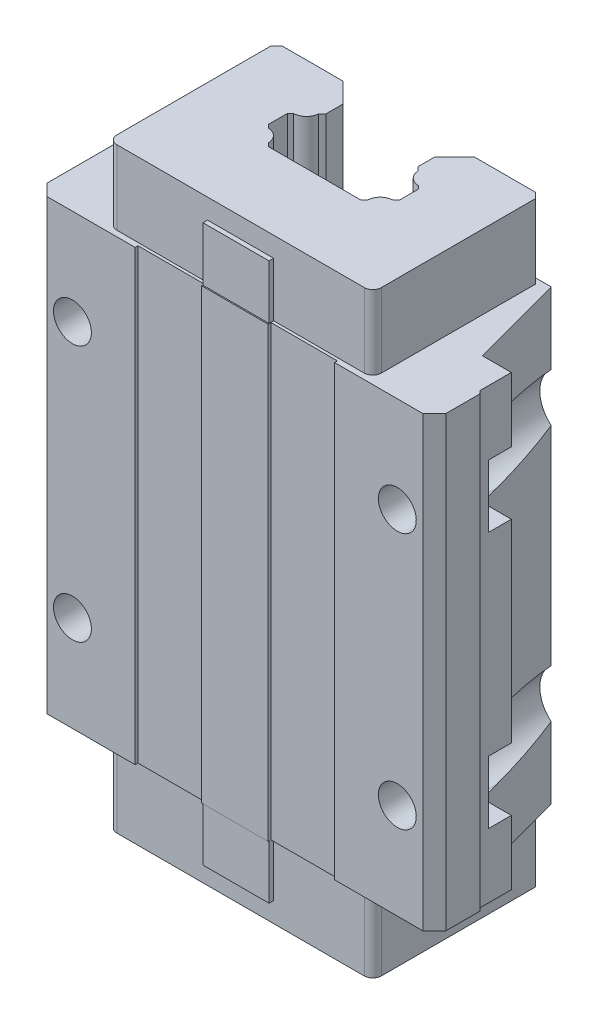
ISO-10303-21;
HEADER;
FILE_DESCRIPTION(('STEP AP214'),'2;1');
FILE_NAME('part.step','',(''),(''),'','','');
FILE_SCHEMA(('AUTOMOTIVE_DESIGN { 1 0 10303 214 1 1 1 1 }'));
ENDSEC;
DATA;
#1=APPLICATION_CONTEXT('core data for automotive mechanical design processes');
#2=APPLICATION_PROTOCOL_DEFINITION('international standard','automotive_design',2000,#1);
#3=PRODUCT_CONTEXT('',#1,'mechanical');
#4=PRODUCT('Part','Part','',(#3));
#5=PRODUCT_RELATED_PRODUCT_CATEGORY('part','',(#4));
#6=PRODUCT_DEFINITION_FORMATION('','',#4);
#7=PRODUCT_DEFINITION_CONTEXT('part definition',#1,'design');
#8=PRODUCT_DEFINITION('design','',#6,#7);
#9=PRODUCT_DEFINITION_SHAPE('','',#8);
#10=(LENGTH_UNIT() NAMED_UNIT(*) SI_UNIT(.MILLI.,.METRE.));
#11=(NAMED_UNIT(*) PLANE_ANGLE_UNIT() SI_UNIT($,.RADIAN.));
#12=(NAMED_UNIT(*) SI_UNIT($,.STERADIAN.) SOLID_ANGLE_UNIT());
#13=UNCERTAINTY_MEASURE_WITH_UNIT(LENGTH_MEASURE(1.E-05),#10,'distance_accuracy_value','');
#14=(GEOMETRIC_REPRESENTATION_CONTEXT(3) GLOBAL_UNCERTAINTY_ASSIGNED_CONTEXT((#13)) GLOBAL_UNIT_ASSIGNED_CONTEXT((#10,
#11,#12)) REPRESENTATION_CONTEXT('',''));
#15=CARTESIAN_POINT('',(0.,0.,0.));
#16=DIRECTION('',(0.,0.,1.));
#17=DIRECTION('',(1.,0.,0.));
#18=AXIS2_PLACEMENT_3D('',#15,#16,#17);
#19=CARTESIAN_POINT('',(-29.42116167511,-237.018902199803,-14.));
#20=DIRECTION('',(-0.96592582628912,0.,-0.258819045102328));
#21=DIRECTION('',(-0.258819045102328,0.,0.96592582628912));
#22=AXIS2_PLACEMENT_3D('',#19,#20,#21);
#23=PLANE('',#22);
#24=CARTESIAN_POINT('',(-28.5,22.5,-17.4378221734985));
#25=DIRECTION('',(0.96592582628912,0.,0.258819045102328));
#26=DIRECTION('',(-0.258819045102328,0.,0.96592582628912));
#27=AXIS2_PLACEMENT_3D('',#24,#25,#26);
#28=ELLIPSE('',#27,21.2503681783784,5.50000000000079);
#29=CARTESIAN_POINT('',(-25.,26.7426406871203,-30.5));
#30=VERTEX_POINT('',#29);
#31=CARTESIAN_POINT('',(-28.5,28.,-17.4378221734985));
#32=VERTEX_POINT('',#31);
#33=EDGE_CURVE('E10',#30,#32,#28,.T.);
#34=ORIENTED_EDGE('',*,*,#33,.T.);
#35=DIRECTION('',(-0.258819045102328,0.,0.96592582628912));
#36=VECTOR('',#35,1.);
#37=CARTESIAN_POINT('',(-29.42116167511,28.,-14.));
#38=LINE('',#37,#36);
#39=CARTESIAN_POINT('',(-29.42116167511,28.,-14.));
#40=VERTEX_POINT('',#39);
#41=EDGE_CURVE('E27',#32,#40,#38,.T.);
#42=ORIENTED_EDGE('',*,*,#41,.T.);
#43=DIRECTION('',(0.,1.,0.));
#44=VECTOR('',#43,1.);
#45=CARTESIAN_POINT('',(-29.42116167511,-237.018902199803,-14.));
#46=LINE('',#45,#44);
#47=CARTESIAN_POINT('',(-29.42116167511,39.3,-14.));
#48=VERTEX_POINT('',#47);
#49=EDGE_CURVE('E801',#40,#48,#46,.T.);
#50=ORIENTED_EDGE('',*,*,#49,.T.);
#51=DIRECTION('',(0.258819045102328,0.,-0.96592582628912));
#52=VECTOR('',#51,1.);
#53=CARTESIAN_POINT('',(-30.9503175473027,39.3,-8.29311259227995));
#54=LINE('',#53,#52);
#55=CARTESIAN_POINT('',(-25.,39.3,-30.5));
#56=VERTEX_POINT('',#55);
#57=EDGE_CURVE('E661',#48,#56,#54,.T.);
#58=ORIENTED_EDGE('',*,*,#57,.T.);
#59=DIRECTION('',(0.,1.,0.));
#60=VECTOR('',#59,1.);
#61=CARTESIAN_POINT('',(-25.,-237.018902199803,-30.5));
#62=LINE('',#61,#60);
#63=EDGE_CURVE('E909',#30,#56,#62,.T.);
#64=ORIENTED_EDGE('',*,*,#63,.F.);
#65=EDGE_LOOP('',(#34,#42,#50,#58,#64));
#66=FACE_BOUND('',#65,.T.);
#67=ADVANCED_FACE('F16',(#66),#23,.T.);
#68=CARTESIAN_POINT('',(-29.42116167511,-237.018902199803,-14.));
#69=DIRECTION('',(-0.96592582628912,0.,-0.258819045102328));
#70=DIRECTION('',(-0.258819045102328,0.,0.96592582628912));
#71=AXIS2_PLACEMENT_3D('',#68,#69,#70);
#72=PLANE('',#71);
#73=DIRECTION('',(0.258819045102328,0.,-0.96592582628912));
#74=VECTOR('',#73,1.);
#75=CARTESIAN_POINT('',(-29.42116167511,16.9999999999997,-14.));
#76=LINE('',#75,#74);
#77=CARTESIAN_POINT('',(-29.42116167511,16.9999999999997,-14.));
#78=VERTEX_POINT('',#77);
#79=CARTESIAN_POINT('',(-28.5,16.9999999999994,-17.4378221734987));
#80=VERTEX_POINT('',#79);
#81=EDGE_CURVE('E656',#78,#80,#76,.T.);
#82=ORIENTED_EDGE('',*,*,#81,.T.);
#83=CARTESIAN_POINT('',(-28.5,22.5,-17.4378221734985));
#84=DIRECTION('',(0.96592582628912,0.,0.258819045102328));
#85=DIRECTION('',(-0.258819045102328,0.,0.96592582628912));
#86=AXIS2_PLACEMENT_3D('',#83,#84,#85);
#87=ELLIPSE('',#86,21.2503681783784,5.50000000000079);
#88=CARTESIAN_POINT('',(-25.,18.2573593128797,-30.5));
#89=VERTEX_POINT('',#88);
#90=EDGE_CURVE('E652',#80,#89,#87,.T.);
#91=ORIENTED_EDGE('',*,*,#90,.T.);
#92=DIRECTION('',(0.,1.,0.));
#93=VECTOR('',#92,1.);
#94=CARTESIAN_POINT('',(-25.,-237.018902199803,-30.5));
#95=LINE('',#94,#93);
#96=CARTESIAN_POINT('',(-25.,-18.2573593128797,-30.5));
#97=VERTEX_POINT('',#96);
#98=EDGE_CURVE('E861',#97,#89,#95,.T.);
#99=ORIENTED_EDGE('',*,*,#98,.F.);
#100=CARTESIAN_POINT('',(-28.5,-22.5,-17.4378221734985));
#101=DIRECTION('',(-0.96592582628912,0.,-0.258819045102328));
#102=DIRECTION('',(-0.258819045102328,0.,0.96592582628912));
#103=AXIS2_PLACEMENT_3D('',#100,#101,#102);
#104=ELLIPSE('',#103,21.2503681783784,5.50000000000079);
#105=CARTESIAN_POINT('',(-28.5,-16.9999999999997,-17.4378221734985));
#106=VERTEX_POINT('',#105);
#107=EDGE_CURVE('E1046',#106,#97,#104,.T.);
#108=ORIENTED_EDGE('',*,*,#107,.F.);
#109=DIRECTION('',(0.258819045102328,0.,-0.96592582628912));
#110=VECTOR('',#109,1.);
#111=CARTESIAN_POINT('',(-29.42116167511,-16.9999999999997,-14.));
#112=LINE('',#111,#110);
#113=CARTESIAN_POINT('',(-29.42116167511,-16.9999999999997,-14.));
#114=VERTEX_POINT('',#113);
#115=EDGE_CURVE('E757',#114,#106,#112,.T.);
#116=ORIENTED_EDGE('',*,*,#115,.F.);
#117=DIRECTION('',(0.,1.,0.));
#118=VECTOR('',#117,1.);
#119=CARTESIAN_POINT('',(-29.42116167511,-237.018902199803,-14.));
#120=LINE('',#119,#118);
#121=EDGE_CURVE('E657',#114,#78,#120,.T.);
#122=ORIENTED_EDGE('',*,*,#121,.T.);
#123=EDGE_LOOP('',(#82,#91,#99,#108,#116,#122));
#124=FACE_BOUND('',#123,.T.);
#125=ADVANCED_FACE('F1658',(#124),#72,.T.);
#126=CARTESIAN_POINT('',(-29.42116167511,-237.018902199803,-14.));
#127=DIRECTION('',(0.,0.,-1.));
#128=DIRECTION('',(0.,-1.,0.));
#129=AXIS2_PLACEMENT_3D('',#126,#127,#128);
#130=PLANE('',#129);
#131=ORIENTED_EDGE('',*,*,#49,.F.);
#132=DIRECTION('',(-1.,0.,0.));
#133=VECTOR('',#132,1.);
#134=CARTESIAN_POINT('',(-29.42116167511,28.,-14.));
#135=LINE('',#134,#133);
#136=CARTESIAN_POINT('',(-35.,28.,-14.));
#137=VERTEX_POINT('',#136);
#138=EDGE_CURVE('E760',#40,#137,#135,.T.);
#139=ORIENTED_EDGE('',*,*,#138,.T.);
#140=DIRECTION('',(0.,1.,0.));
#141=VECTOR('',#140,1.);
#142=CARTESIAN_POINT('',(-35.,-237.018902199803,-14.));
#143=LINE('',#142,#141);
#144=CARTESIAN_POINT('',(-35.,39.3,-14.));
#145=VERTEX_POINT('',#144);
#146=EDGE_CURVE('E1450',#137,#145,#143,.T.);
#147=ORIENTED_EDGE('',*,*,#146,.T.);
#148=DIRECTION('',(1.,0.,0.));
#149=VECTOR('',#148,1.);
#150=CARTESIAN_POINT('',(0.,39.3,-14.));
#151=LINE('',#150,#149);
#152=EDGE_CURVE('E1523',#145,#48,#151,.T.);
#153=ORIENTED_EDGE('',*,*,#152,.T.);
#154=EDGE_LOOP('',(#131,#139,#147,#153));
#155=FACE_BOUND('',#154,.T.);
#156=ADVANCED_FACE('F1828',(#155),#130,.T.);
#157=CARTESIAN_POINT('',(-29.42116167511,-237.018902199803,-14.));
#158=DIRECTION('',(0.,0.,-1.));
#159=DIRECTION('',(0.,-1.,0.));
#160=AXIS2_PLACEMENT_3D('',#157,#158,#159);
#161=PLANE('',#160);
#162=DIRECTION('',(0.,1.,0.));
#163=VECTOR('',#162,1.);
#164=CARTESIAN_POINT('',(-35.,-237.018902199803,-14.));
#165=LINE('',#164,#163);
#166=CARTESIAN_POINT('',(-35.,-16.9999999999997,-14.));
#167=VERTEX_POINT('',#166);
#168=CARTESIAN_POINT('',(-35.,16.9999999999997,-14.));
#169=VERTEX_POINT('',#168);
#170=EDGE_CURVE('E914',#167,#169,#165,.T.);
#171=ORIENTED_EDGE('',*,*,#170,.T.);
#172=DIRECTION('',(1.,0.,0.));
#173=VECTOR('',#172,1.);
#174=CARTESIAN_POINT('',(-29.42116167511,16.9999999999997,-14.));
#175=LINE('',#174,#173);
#176=EDGE_CURVE('E910',#169,#78,#175,.T.);
#177=ORIENTED_EDGE('',*,*,#176,.T.);
#178=ORIENTED_EDGE('',*,*,#121,.F.);
#179=DIRECTION('',(1.,0.,0.));
#180=VECTOR('',#179,1.);
#181=CARTESIAN_POINT('',(-29.42116167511,-16.9999999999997,-14.));
#182=LINE('',#181,#180);
#183=EDGE_CURVE('E2559',#167,#114,#182,.T.);
#184=ORIENTED_EDGE('',*,*,#183,.F.);
#185=EDGE_LOOP('',(#171,#177,#178,#184));
#186=FACE_BOUND('',#185,.T.);
#187=ADVANCED_FACE('F2701',(#186),#161,.T.);
#188=CARTESIAN_POINT('',(-35.,-237.018902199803,-14.));
#189=DIRECTION('',(-1.,0.,0.));
#190=DIRECTION('',(0.,0.,1.));
#191=AXIS2_PLACEMENT_3D('',#188,#189,#190);
#192=PLANE('',#191);
#193=ORIENTED_EDGE('',*,*,#146,.F.);
#194=DIRECTION('',(0.,0.,1.));
#195=VECTOR('',#194,1.);
#196=CARTESIAN_POINT('',(-35.,28.,-14.));
#197=LINE('',#196,#195);
#198=CARTESIAN_POINT('',(-35.,28.,-10.));
#199=VERTEX_POINT('',#198);
#200=EDGE_CURVE('E904',#137,#199,#197,.T.);
#201=ORIENTED_EDGE('',*,*,#200,.T.);
#202=DIRECTION('',(0.,-1.,0.));
#203=VECTOR('',#202,1.);
#204=CARTESIAN_POINT('',(-35.,-237.018902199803,-10.));
#205=LINE('',#204,#203);
#206=CARTESIAN_POINT('',(-35.,16.9999999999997,-10.));
#207=VERTEX_POINT('',#206);
#208=EDGE_CURVE('E900',#199,#207,#205,.T.);
#209=ORIENTED_EDGE('',*,*,#208,.T.);
#210=DIRECTION('',(0.,0.,-1.));
#211=VECTOR('',#210,1.);
#212=CARTESIAN_POINT('',(-35.,16.9999999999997,-14.));
#213=LINE('',#212,#211);
#214=EDGE_CURVE('E905',#207,#169,#213,.T.);
#215=ORIENTED_EDGE('',*,*,#214,.T.);
#216=ORIENTED_EDGE('',*,*,#170,.F.);
#217=DIRECTION('',(0.,0.,-1.));
#218=VECTOR('',#217,1.);
#219=CARTESIAN_POINT('',(-35.,-16.9999999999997,-14.));
#220=LINE('',#219,#218);
#221=CARTESIAN_POINT('',(-35.,-16.9999999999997,-10.));
#222=VERTEX_POINT('',#221);
#223=EDGE_CURVE('E1083',#222,#167,#220,.T.);
#224=ORIENTED_EDGE('',*,*,#223,.F.);
#225=DIRECTION('',(0.,1.,0.));
#226=VECTOR('',#225,1.);
#227=CARTESIAN_POINT('',(-35.,-237.018902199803,-10.));
#228=LINE('',#227,#226);
#229=CARTESIAN_POINT('',(-35.,-28.,-10.));
#230=VERTEX_POINT('',#229);
#231=EDGE_CURVE('E838',#230,#222,#228,.T.);
#232=ORIENTED_EDGE('',*,*,#231,.F.);
#233=DIRECTION('',(0.,0.,1.));
#234=VECTOR('',#233,1.);
#235=CARTESIAN_POINT('',(-35.,-28.,-14.));
#236=LINE('',#235,#234);
#237=CARTESIAN_POINT('',(-35.,-28.,-14.));
#238=VERTEX_POINT('',#237);
#239=EDGE_CURVE('E1045',#238,#230,#236,.T.);
#240=ORIENTED_EDGE('',*,*,#239,.F.);
#241=DIRECTION('',(0.,1.,0.));
#242=VECTOR('',#241,1.);
#243=CARTESIAN_POINT('',(-35.,-237.018902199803,-14.));
#244=LINE('',#243,#242);
#245=CARTESIAN_POINT('',(-35.,-39.3,-14.));
#246=VERTEX_POINT('',#245);
#247=EDGE_CURVE('E814',#246,#238,#244,.T.);
#248=ORIENTED_EDGE('',*,*,#247,.F.);
#249=DIRECTION('',(0.,0.,1.));
#250=VECTOR('',#249,1.);
#251=CARTESIAN_POINT('',(-35.,-39.3,0.));
#252=LINE('',#251,#250);
#253=CARTESIAN_POINT('',(-35.,-39.3,-2.));
#254=VERTEX_POINT('',#253);
#255=EDGE_CURVE('E1020',#246,#254,#252,.T.);
#256=ORIENTED_EDGE('',*,*,#255,.T.);
#257=DIRECTION('',(0.,1.,0.));
#258=VECTOR('',#257,1.);
#259=CARTESIAN_POINT('',(-35.,-237.018902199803,-2.));
#260=LINE('',#259,#258);
#261=CARTESIAN_POINT('',(-35.,39.3,-2.));
#262=VERTEX_POINT('',#261);
#263=EDGE_CURVE('E1120',#254,#262,#260,.T.);
#264=ORIENTED_EDGE('',*,*,#263,.T.);
#265=DIRECTION('',(0.,0.,-1.));
#266=VECTOR('',#265,1.);
#267=CARTESIAN_POINT('',(-35.,39.3,0.));
#268=LINE('',#267,#266);
#269=EDGE_CURVE('E1116',#262,#145,#268,.T.);
#270=ORIENTED_EDGE('',*,*,#269,.T.);
#271=EDGE_LOOP('',(#193,#201,#209,#215,#216,#224,#232,#240,#248,#256,#264,#270));
#272=FACE_BOUND('',#271,.T.);
#273=ADVANCED_FACE('F1844',(#272),#192,.T.);
#274=CARTESIAN_POINT('',(-28.5,22.5,0.));
#275=DIRECTION('',(0.,0.,-1.));
#276=DIRECTION('',(0.,-1.,0.));
#277=AXIS2_PLACEMENT_3D('',#274,#275,#276);
#278=CYLINDRICAL_SURFACE('',#277,3.3235);
#279=CARTESIAN_POINT('',(-28.5,22.5,0.));
#280=DIRECTION('',(0.,0.,-1.));
#281=DIRECTION('',(0.,-1.,0.));
#282=AXIS2_PLACEMENT_3D('',#279,#280,#281);
#283=CIRCLE('',#282,3.3235);
#284=CARTESIAN_POINT('',(-28.5,19.1765,0.));
#285=VERTEX_POINT('',#284);
#286=EDGE_CURVE('E1084',#285,#285,#283,.T.);
#287=ORIENTED_EDGE('',*,*,#286,.F.);
#288=EDGE_LOOP('',(#287));
#289=FACE_BOUND('',#288,.T.);
#290=CARTESIAN_POINT('',(-28.5,22.5,-10.));
#291=DIRECTION('',(0.,0.,1.));
#292=DIRECTION('',(-1.,0.,0.));
#293=AXIS2_PLACEMENT_3D('',#290,#291,#292);
#294=CIRCLE('',#293,3.3235);
#295=CARTESIAN_POINT('',(-31.8235,22.5,-10.));
#296=VERTEX_POINT('',#295);
#297=EDGE_CURVE('E770',#296,#296,#294,.T.);
#298=ORIENTED_EDGE('',*,*,#297,.F.);
#299=EDGE_LOOP('',(#298));
#300=FACE_BOUND('',#299,.T.);
#301=ADVANCED_FACE('F1840',(#289,#300),#278,.F.);
#302=CARTESIAN_POINT('',(34.5,-237.018902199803,-14.));
#303=DIRECTION('',(1.,0.,0.));
#304=DIRECTION('',(0.,1.,0.));
#305=AXIS2_PLACEMENT_3D('',#302,#303,#304);
#306=PLANE('',#305);
#307=DIRECTION('',(0.,1.,0.));
#308=VECTOR('',#307,1.);
#309=CARTESIAN_POINT('',(34.5,-237.018902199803,-10.));
#310=LINE('',#309,#308);
#311=CARTESIAN_POINT('',(34.5,-28.,-10.));
#312=VERTEX_POINT('',#311);
#313=CARTESIAN_POINT('',(34.5,-16.9999999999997,-10.));
#314=VERTEX_POINT('',#313);
#315=EDGE_CURVE('E1121',#312,#314,#310,.T.);
#316=ORIENTED_EDGE('',*,*,#315,.T.);
#317=DIRECTION('',(0.,0.,-1.));
#318=VECTOR('',#317,1.);
#319=CARTESIAN_POINT('',(34.5,-16.9999999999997,-14.));
#320=LINE('',#319,#318);
#321=CARTESIAN_POINT('',(34.5,-16.9999999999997,-14.));
#322=VERTEX_POINT('',#321);
#323=EDGE_CURVE('E1217',#314,#322,#320,.T.);
#324=ORIENTED_EDGE('',*,*,#323,.T.);
#325=DIRECTION('',(0.,1.,0.));
#326=VECTOR('',#325,1.);
#327=CARTESIAN_POINT('',(34.5,-237.018902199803,-14.));
#328=LINE('',#327,#326);
#329=CARTESIAN_POINT('',(34.5,16.9999999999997,-14.));
#330=VERTEX_POINT('',#329);
#331=EDGE_CURVE('E1213',#322,#330,#328,.T.);
#332=ORIENTED_EDGE('',*,*,#331,.T.);
#333=DIRECTION('',(0.,0.,-1.));
#334=VECTOR('',#333,1.);
#335=CARTESIAN_POINT('',(34.5,16.9999999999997,-14.));
#336=LINE('',#335,#334);
#337=CARTESIAN_POINT('',(34.5,16.9999999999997,-10.));
#338=VERTEX_POINT('',#337);
#339=EDGE_CURVE('E766',#338,#330,#336,.T.);
#340=ORIENTED_EDGE('',*,*,#339,.F.);
#341=DIRECTION('',(0.,-1.,0.));
#342=VECTOR('',#341,1.);
#343=CARTESIAN_POINT('',(34.5,-237.018902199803,-10.));
#344=LINE('',#343,#342);
#345=CARTESIAN_POINT('',(34.5,28.,-10.));
#346=VERTEX_POINT('',#345);
#347=EDGE_CURVE('E777',#346,#338,#344,.T.);
#348=ORIENTED_EDGE('',*,*,#347,.F.);
#349=DIRECTION('',(0.,0.,1.));
#350=VECTOR('',#349,1.);
#351=CARTESIAN_POINT('',(34.5,28.,-14.));
#352=LINE('',#351,#350);
#353=CARTESIAN_POINT('',(34.5,28.,-14.));
#354=VERTEX_POINT('',#353);
#355=EDGE_CURVE('E796',#354,#346,#352,.T.);
#356=ORIENTED_EDGE('',*,*,#355,.F.);
#357=DIRECTION('',(0.,1.,0.));
#358=VECTOR('',#357,1.);
#359=CARTESIAN_POINT('',(34.5,-237.018902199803,-14.));
#360=LINE('',#359,#358);
#361=CARTESIAN_POINT('',(34.5,39.3,-14.));
#362=VERTEX_POINT('',#361);
#363=EDGE_CURVE('E1218',#354,#362,#360,.T.);
#364=ORIENTED_EDGE('',*,*,#363,.T.);
#365=DIRECTION('',(0.,0.,1.));
#366=VECTOR('',#365,1.);
#367=CARTESIAN_POINT('',(34.5,39.3,0.));
#368=LINE('',#367,#366);
#369=CARTESIAN_POINT('',(34.5,39.3,-8.5));
#370=VERTEX_POINT('',#369);
#371=EDGE_CURVE('E1227',#362,#370,#368,.T.);
#372=ORIENTED_EDGE('',*,*,#371,.T.);
#373=DIRECTION('',(0.,1.,0.));
#374=VECTOR('',#373,1.);
#375=CARTESIAN_POINT('',(34.5,-237.018902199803,-8.5));
#376=LINE('',#375,#374);
#377=CARTESIAN_POINT('',(34.5,-39.3,-8.5));
#378=VERTEX_POINT('',#377);
#379=EDGE_CURVE('E1032',#378,#370,#376,.T.);
#380=ORIENTED_EDGE('',*,*,#379,.F.);
#381=DIRECTION('',(0.,0.,-1.));
#382=VECTOR('',#381,1.);
#383=CARTESIAN_POINT('',(34.5,-39.3,0.));
#384=LINE('',#383,#382);
#385=CARTESIAN_POINT('',(34.5,-39.3,-14.));
#386=VERTEX_POINT('',#385);
#387=EDGE_CURVE('E1195',#378,#386,#384,.T.);
#388=ORIENTED_EDGE('',*,*,#387,.T.);
#389=DIRECTION('',(0.,1.,0.));
#390=VECTOR('',#389,1.);
#391=CARTESIAN_POINT('',(34.5,-237.018902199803,-14.));
#392=LINE('',#391,#390);
#393=CARTESIAN_POINT('',(34.5,-28.,-14.));
#394=VERTEX_POINT('',#393);
#395=EDGE_CURVE('E890',#386,#394,#392,.T.);
#396=ORIENTED_EDGE('',*,*,#395,.T.);
#397=DIRECTION('',(0.,0.,1.));
#398=VECTOR('',#397,1.);
#399=CARTESIAN_POINT('',(34.5,-28.,-14.));
#400=LINE('',#399,#398);
#401=EDGE_CURVE('E887',#394,#312,#400,.T.);
#402=ORIENTED_EDGE('',*,*,#401,.T.);
#403=EDGE_LOOP('',(#316,#324,#332,#340,#348,#356,#364,#372,#380,#388,#396,#402));
#404=FACE_BOUND('',#403,.T.);
#405=ADVANCED_FACE('F1843',(#404),#306,.T.);
#406=CARTESIAN_POINT('',(29.42116167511,-237.018902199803,-14.));
#407=DIRECTION('',(0.,0.,-1.));
#408=DIRECTION('',(0.,-1.,0.));
#409=AXIS2_PLACEMENT_3D('',#406,#407,#408);
#410=PLANE('',#409);
#411=ORIENTED_EDGE('',*,*,#331,.F.);
#412=DIRECTION('',(-1.,0.,0.));
#413=VECTOR('',#412,1.);
#414=CARTESIAN_POINT('',(29.42116167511,-16.9999999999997,-14.));
#415=LINE('',#414,#413);
#416=CARTESIAN_POINT('',(29.42116167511,-16.9999999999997,-14.));
#417=VERTEX_POINT('',#416);
#418=EDGE_CURVE('E891',#322,#417,#415,.T.);
#419=ORIENTED_EDGE('',*,*,#418,.T.);
#420=DIRECTION('',(0.,1.,0.));
#421=VECTOR('',#420,1.);
#422=CARTESIAN_POINT('',(29.42116167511,-237.018902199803,-14.));
#423=LINE('',#422,#421);
#424=CARTESIAN_POINT('',(29.42116167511,16.9999999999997,-14.));
#425=VERTEX_POINT('',#424);
#426=EDGE_CURVE('E1223',#417,#425,#423,.T.);
#427=ORIENTED_EDGE('',*,*,#426,.T.);
#428=DIRECTION('',(-1.,0.,0.));
#429=VECTOR('',#428,1.);
#430=CARTESIAN_POINT('',(29.42116167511,16.9999999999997,-14.));
#431=LINE('',#430,#429);
#432=EDGE_CURVE('E1025',#330,#425,#431,.T.);
#433=ORIENTED_EDGE('',*,*,#432,.F.);
#434=EDGE_LOOP('',(#411,#419,#427,#433));
#435=FACE_BOUND('',#434,.T.);
#436=ADVANCED_FACE('F1970',(#435),#410,.T.);
#437=CARTESIAN_POINT('',(29.42116167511,-237.018902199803,-14.));
#438=DIRECTION('',(0.,0.,-1.));
#439=DIRECTION('',(0.,-1.,0.));
#440=AXIS2_PLACEMENT_3D('',#437,#438,#439);
#441=PLANE('',#440);
#442=DIRECTION('',(0.,1.,0.));
#443=VECTOR('',#442,1.);
#444=CARTESIAN_POINT('',(29.42116167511,-237.018902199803,-14.));
#445=LINE('',#444,#443);
#446=CARTESIAN_POINT('',(29.42116167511,-39.3,-14.));
#447=VERTEX_POINT('',#446);
#448=CARTESIAN_POINT('',(29.42116167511,-28.,-14.));
#449=VERTEX_POINT('',#448);
#450=EDGE_CURVE('E1219',#447,#449,#445,.T.);
#451=ORIENTED_EDGE('',*,*,#450,.T.);
#452=DIRECTION('',(1.,0.,0.));
#453=VECTOR('',#452,1.);
#454=CARTESIAN_POINT('',(29.42116167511,-28.,-14.));
#455=LINE('',#454,#453);
#456=EDGE_CURVE('E644',#449,#394,#455,.T.);
#457=ORIENTED_EDGE('',*,*,#456,.T.);
#458=ORIENTED_EDGE('',*,*,#395,.F.);
#459=DIRECTION('',(-1.,0.,0.));
#460=VECTOR('',#459,1.);
#461=CARTESIAN_POINT('',(0.,-39.3,-14.));
#462=LINE('',#461,#460);
#463=EDGE_CURVE('E640',#386,#447,#462,.T.);
#464=ORIENTED_EDGE('',*,*,#463,.T.);
#465=EDGE_LOOP('',(#451,#457,#458,#464));
#466=FACE_BOUND('',#465,.T.);
#467=ADVANCED_FACE('F1981',(#466),#441,.T.);
#468=CARTESIAN_POINT('',(25.,-237.018902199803,-30.5));
#469=DIRECTION('',(0.96592582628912,0.,-0.258819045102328));
#470=DIRECTION('',(0.,-1.,0.));
#471=AXIS2_PLACEMENT_3D('',#468,#469,#470);
#472=PLANE('',#471);
#473=DIRECTION('',(-0.258819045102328,0.,-0.96592582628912));
#474=VECTOR('',#473,1.);
#475=CARTESIAN_POINT('',(25.,-16.9999999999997,-30.5));
#476=LINE('',#475,#474);
#477=CARTESIAN_POINT('',(28.5,-16.9999999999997,-17.4378221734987));
#478=VERTEX_POINT('',#477);
#479=EDGE_CURVE('E645',#417,#478,#476,.T.);
#480=ORIENTED_EDGE('',*,*,#479,.T.);
#481=CARTESIAN_POINT('',(28.5,-22.5,-17.4378221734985));
#482=DIRECTION('',(-0.96592582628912,0.,0.258819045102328));
#483=DIRECTION('',(0.258819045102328,0.,0.96592582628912));
#484=AXIS2_PLACEMENT_3D('',#481,#482,#483);
#485=ELLIPSE('',#484,21.2503681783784,5.50000000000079);
#486=CARTESIAN_POINT('',(25.,-18.2573593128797,-30.5));
#487=VERTEX_POINT('',#486);
#488=EDGE_CURVE('E833',#478,#487,#485,.T.);
#489=ORIENTED_EDGE('',*,*,#488,.T.);
#490=DIRECTION('',(0.,1.,0.));
#491=VECTOR('',#490,1.);
#492=CARTESIAN_POINT('',(25.,-237.018902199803,-30.5));
#493=LINE('',#492,#491);
#494=CARTESIAN_POINT('',(25.,18.2573593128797,-30.5));
#495=VERTEX_POINT('',#494);
#496=EDGE_CURVE('E837',#487,#495,#493,.T.);
#497=ORIENTED_EDGE('',*,*,#496,.T.);
#498=CARTESIAN_POINT('',(28.5,22.5,-17.4378221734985));
#499=DIRECTION('',(0.96592582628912,0.,-0.258819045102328));
#500=DIRECTION('',(0.258819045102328,0.,0.96592582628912));
#501=AXIS2_PLACEMENT_3D('',#498,#499,#500);
#502=ELLIPSE('',#501,21.2503681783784,5.50000000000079);
#503=CARTESIAN_POINT('',(28.5,16.9999999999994,-17.4378221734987));
#504=VERTEX_POINT('',#503);
#505=EDGE_CURVE('E1168',#504,#495,#502,.T.);
#506=ORIENTED_EDGE('',*,*,#505,.F.);
#507=DIRECTION('',(-0.258819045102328,0.,-0.96592582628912));
#508=VECTOR('',#507,1.);
#509=CARTESIAN_POINT('',(25.,16.9999999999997,-30.5));
#510=LINE('',#509,#508);
#511=EDGE_CURVE('E1021',#425,#504,#510,.T.);
#512=ORIENTED_EDGE('',*,*,#511,.F.);
#513=ORIENTED_EDGE('',*,*,#426,.F.);
#514=EDGE_LOOP('',(#480,#489,#497,#506,#512,#513));
#515=FACE_BOUND('',#514,.T.);
#516=ADVANCED_FACE('F1992',(#515),#472,.T.);
#517=CARTESIAN_POINT('',(25.,-237.018902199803,-30.5));
#518=DIRECTION('',(0.96592582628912,0.,-0.258819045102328));
#519=DIRECTION('',(0.,-1.,0.));
#520=AXIS2_PLACEMENT_3D('',#517,#518,#519);
#521=PLANE('',#520);
#522=DIRECTION('',(0.,1.,0.));
#523=VECTOR('',#522,1.);
#524=CARTESIAN_POINT('',(25.,-237.018902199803,-30.5));
#525=LINE('',#524,#523);
#526=CARTESIAN_POINT('',(25.,-39.3,-30.5));
#527=VERTEX_POINT('',#526);
#528=CARTESIAN_POINT('',(25.,-26.7426406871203,-30.5));
#529=VERTEX_POINT('',#528);
#530=EDGE_CURVE('E782',#527,#529,#525,.T.);
#531=ORIENTED_EDGE('',*,*,#530,.T.);
#532=CARTESIAN_POINT('',(28.5,-22.5,-17.4378221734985));
#533=DIRECTION('',(-0.96592582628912,0.,0.258819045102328));
#534=DIRECTION('',(0.258819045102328,0.,0.96592582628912));
#535=AXIS2_PLACEMENT_3D('',#532,#533,#534);
#536=ELLIPSE('',#535,21.2503681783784,5.50000000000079);
#537=CARTESIAN_POINT('',(28.5,-28.,-17.4378221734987));
#538=VERTEX_POINT('',#537);
#539=EDGE_CURVE('E778',#529,#538,#536,.T.);
#540=ORIENTED_EDGE('',*,*,#539,.T.);
#541=DIRECTION('',(0.258819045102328,0.,0.96592582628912));
#542=VECTOR('',#541,1.);
#543=CARTESIAN_POINT('',(25.,-28.,-30.5));
#544=LINE('',#543,#542);
#545=EDGE_CURVE('E783',#538,#449,#544,.T.);
#546=ORIENTED_EDGE('',*,*,#545,.T.);
#547=ORIENTED_EDGE('',*,*,#450,.F.);
#548=DIRECTION('',(-0.258819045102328,0.,-0.96592582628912));
#549=VECTOR('',#548,1.);
#550=CARTESIAN_POINT('',(30.9503175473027,-39.3,-8.29311259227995));
#551=LINE('',#550,#549);
#552=EDGE_CURVE('E1112',#447,#527,#551,.T.);
#553=ORIENTED_EDGE('',*,*,#552,.T.);
#554=EDGE_LOOP('',(#531,#540,#546,#547,#553));
#555=FACE_BOUND('',#554,.T.);
#556=ADVANCED_FACE('F1940',(#555),#521,.T.);
#557=CARTESIAN_POINT('',(28.5,-22.5,0.));
#558=DIRECTION('',(0.,0.,-1.));
#559=DIRECTION('',(0.,-1.,0.));
#560=AXIS2_PLACEMENT_3D('',#557,#558,#559);
#561=CYLINDRICAL_SURFACE('',#560,3.3235);
#562=CARTESIAN_POINT('',(28.5,-22.5,0.));
#563=DIRECTION('',(0.,0.,-1.));
#564=DIRECTION('',(0.,-1.,0.));
#565=AXIS2_PLACEMENT_3D('',#562,#563,#564);
#566=CIRCLE('',#565,3.3235);
#567=CARTESIAN_POINT('',(28.5,-25.8235,0.));
#568=VERTEX_POINT('',#567);
#569=EDGE_CURVE('E988',#568,#568,#566,.T.);
#570=ORIENTED_EDGE('',*,*,#569,.F.);
#571=EDGE_LOOP('',(#570));
#572=FACE_BOUND('',#571,.T.);
#573=CARTESIAN_POINT('',(28.5,-22.5,-10.));
#574=DIRECTION('',(0.,0.,1.));
#575=DIRECTION('',(-1.,0.,0.));
#576=AXIS2_PLACEMENT_3D('',#573,#574,#575);
#577=CIRCLE('',#576,3.3235);
#578=CARTESIAN_POINT('',(25.1765,-22.5,-10.));
#579=VERTEX_POINT('',#578);
#580=EDGE_CURVE('E800',#579,#579,#577,.T.);
#581=ORIENTED_EDGE('',*,*,#580,.F.);
#582=EDGE_LOOP('',(#581));
#583=FACE_BOUND('',#582,.T.);
#584=ADVANCED_FACE('F1936',(#572,#583),#561,.F.);
#585=CARTESIAN_POINT('',(29.42116167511,-237.018902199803,-14.));
#586=DIRECTION('',(0.,0.,-1.));
#587=DIRECTION('',(0.,-1.,0.));
#588=AXIS2_PLACEMENT_3D('',#585,#586,#587);
#589=PLANE('',#588);
#590=DIRECTION('',(1.,0.,0.));
#591=VECTOR('',#590,1.);
#592=CARTESIAN_POINT('',(29.42116167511,28.,-14.));
#593=LINE('',#592,#591);
#594=CARTESIAN_POINT('',(29.42116167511,28.,-14.));
#595=VERTEX_POINT('',#594);
#596=EDGE_CURVE('E761',#595,#354,#593,.T.);
#597=ORIENTED_EDGE('',*,*,#596,.F.);
#598=DIRECTION('',(0.,1.,0.));
#599=VECTOR('',#598,1.);
#600=CARTESIAN_POINT('',(29.42116167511,-237.018902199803,-14.));
#601=LINE('',#600,#599);
#602=CARTESIAN_POINT('',(29.42116167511,39.3,-14.));
#603=VERTEX_POINT('',#602);
#604=EDGE_CURVE('E1115',#595,#603,#601,.T.);
#605=ORIENTED_EDGE('',*,*,#604,.T.);
#606=DIRECTION('',(1.,0.,0.));
#607=VECTOR('',#606,1.);
#608=CARTESIAN_POINT('',(0.,39.3,-14.));
#609=LINE('',#608,#607);
#610=EDGE_CURVE('E961',#603,#362,#609,.T.);
#611=ORIENTED_EDGE('',*,*,#610,.T.);
#612=ORIENTED_EDGE('',*,*,#363,.F.);
#613=EDGE_LOOP('',(#597,#605,#611,#612));
#614=FACE_BOUND('',#613,.T.);
#615=ADVANCED_FACE('F1939',(#614),#589,.T.);
#616=CARTESIAN_POINT('',(25.,-237.018902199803,-30.5));
#617=DIRECTION('',(0.96592582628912,0.,-0.258819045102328));
#618=DIRECTION('',(0.,-1.,0.));
#619=AXIS2_PLACEMENT_3D('',#616,#617,#618);
#620=PLANE('',#619);
#621=DIRECTION('',(0.258819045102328,0.,0.96592582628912));
#622=VECTOR('',#621,1.);
#623=CARTESIAN_POINT('',(25.,28.,-30.5));
#624=LINE('',#623,#622);
#625=CARTESIAN_POINT('',(28.5,28.,-17.4378221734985));
#626=VERTEX_POINT('',#625);
#627=EDGE_CURVE('E765',#626,#595,#624,.T.);
#628=ORIENTED_EDGE('',*,*,#627,.F.);
#629=CARTESIAN_POINT('',(28.5,22.5,-17.4378221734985));
#630=DIRECTION('',(0.96592582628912,0.,-0.258819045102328));
#631=DIRECTION('',(0.258819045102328,0.,0.96592582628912));
#632=AXIS2_PLACEMENT_3D('',#629,#630,#631);
#633=ELLIPSE('',#632,21.2503681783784,5.50000000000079);
#634=CARTESIAN_POINT('',(25.,26.7426406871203,-30.5));
#635=VERTEX_POINT('',#634);
#636=EDGE_CURVE('E957',#635,#626,#633,.T.);
#637=ORIENTED_EDGE('',*,*,#636,.F.);
#638=DIRECTION('',(0.,1.,0.));
#639=VECTOR('',#638,1.);
#640=CARTESIAN_POINT('',(25.,-237.018902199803,-30.5));
#641=LINE('',#640,#639);
#642=CARTESIAN_POINT('',(25.,39.3,-30.5));
#643=VERTEX_POINT('',#642);
#644=EDGE_CURVE('E899',#635,#643,#641,.T.);
#645=ORIENTED_EDGE('',*,*,#644,.T.);
#646=DIRECTION('',(0.258819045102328,0.,0.96592582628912));
#647=VECTOR('',#646,1.);
#648=CARTESIAN_POINT('',(30.9503175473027,39.3,-8.29311259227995));
#649=LINE('',#648,#647);
#650=EDGE_CURVE('E737',#643,#603,#649,.T.);
#651=ORIENTED_EDGE('',*,*,#650,.T.);
#652=ORIENTED_EDGE('',*,*,#604,.F.);
#653=EDGE_LOOP('',(#628,#637,#645,#651,#652));
#654=FACE_BOUND('',#653,.T.);
#655=ADVANCED_FACE('F2301',(#654),#620,.T.);
#656=CARTESIAN_POINT('',(0.,39.3,0.));
#657=DIRECTION('',(0.,1.,0.));
#658=DIRECTION('',(1.,0.,0.));
#659=AXIS2_PLACEMENT_3D('',#656,#657,#658);
#660=PLANE('',#659);
#661=DIRECTION('',(1.,0.,0.));
#662=VECTOR('',#661,1.);
#663=CARTESIAN_POINT('',(-21.7,39.3,-1.));
#664=LINE('',#663,#662);
#665=CARTESIAN_POINT('',(5.8,39.3,-1.));
#666=VERTEX_POINT('',#665);
#667=CARTESIAN_POINT('',(21.7,39.3,-1.));
#668=VERTEX_POINT('',#667);
#669=EDGE_CURVE('E651',#666,#668,#664,.T.);
#670=ORIENTED_EDGE('',*,*,#669,.F.);
#671=DIRECTION('',(0.,0.,1.));
#672=VECTOR('',#671,1.);
#673=CARTESIAN_POINT('',(5.8,39.3,-1.));
#674=LINE('',#673,#672);
#675=CARTESIAN_POINT('',(5.8,39.3,-0.2));
#676=VERTEX_POINT('',#675);
#677=EDGE_CURVE('E732',#666,#676,#674,.T.);
#678=ORIENTED_EDGE('',*,*,#677,.T.);
#679=DIRECTION('',(-1.,0.,0.));
#680=VECTOR('',#679,1.);
#681=CARTESIAN_POINT('',(5.8,39.3,-0.2));
#682=LINE('',#681,#680);
#683=CARTESIAN_POINT('',(-5.8,39.3,-0.2));
#684=VERTEX_POINT('',#683);
#685=EDGE_CURVE('E728',#676,#684,#682,.T.);
#686=ORIENTED_EDGE('',*,*,#685,.T.);
#687=DIRECTION('',(0.,0.,-1.));
#688=VECTOR('',#687,1.);
#689=CARTESIAN_POINT('',(-5.8,39.3,-0.2));
#690=LINE('',#689,#688);
#691=CARTESIAN_POINT('',(-5.8,39.3,-1.));
#692=VERTEX_POINT('',#691);
#693=EDGE_CURVE('E733',#684,#692,#690,.T.);
#694=ORIENTED_EDGE('',*,*,#693,.T.);
#695=DIRECTION('',(1.,0.,0.));
#696=VECTOR('',#695,1.);
#697=CARTESIAN_POINT('',(-21.7,39.3,-1.));
#698=LINE('',#697,#696);
#699=CARTESIAN_POINT('',(-21.7,39.3,-1.));
#700=VERTEX_POINT('',#699);
#701=EDGE_CURVE('E1288',#700,#692,#698,.T.);
#702=ORIENTED_EDGE('',*,*,#701,.F.);
#703=CARTESIAN_POINT('',(-21.7,39.3,-2.5));
#704=DIRECTION('',(0.,1.,0.));
#705=DIRECTION('',(1.,0.,0.));
#706=AXIS2_PLACEMENT_3D('',#703,#704,#705);
#707=CIRCLE('',#706,1.5);
#708=CARTESIAN_POINT('',(-23.2,39.3,-2.5));
#709=VERTEX_POINT('',#708);
#710=EDGE_CURVE('E984',#709,#700,#707,.T.);
#711=ORIENTED_EDGE('',*,*,#710,.F.);
#712=DIRECTION('',(0.,0.,1.));
#713=VECTOR('',#712,1.);
#714=CARTESIAN_POINT('',(-23.2,39.3,-29.5));
#715=LINE('',#714,#713);
#716=CARTESIAN_POINT('',(-23.2,39.3,-29.5));
#717=VERTEX_POINT('',#716);
#718=EDGE_CURVE('E880',#717,#709,#715,.T.);
#719=ORIENTED_EDGE('',*,*,#718,.F.);
#720=DIRECTION('',(-0.707106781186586,0.,0.707106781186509));
#721=VECTOR('',#720,1.);
#722=CARTESIAN_POINT('',(-22.2,39.3,-30.5));
#723=LINE('',#722,#721);
#724=CARTESIAN_POINT('',(-22.2,39.3,-30.5));
#725=VERTEX_POINT('',#724);
#726=EDGE_CURVE('E879',#725,#717,#723,.T.);
#727=ORIENTED_EDGE('',*,*,#726,.F.);
#728=DIRECTION('',(1.,0.,0.));
#729=VECTOR('',#728,1.);
#730=CARTESIAN_POINT('',(0.,39.3,-30.5));
#731=LINE('',#730,#729);
#732=EDGE_CURVE('E1040',#56,#725,#731,.T.);
#733=ORIENTED_EDGE('',*,*,#732,.F.);
#734=ORIENTED_EDGE('',*,*,#57,.F.);
#735=ORIENTED_EDGE('',*,*,#152,.F.);
#736=ORIENTED_EDGE('',*,*,#269,.F.);
#737=DIRECTION('',(-0.707106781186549,0.,-0.707106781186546));
#738=VECTOR('',#737,1.);
#739=CARTESIAN_POINT('',(-16.5,39.3,16.5));
#740=LINE('',#739,#738);
#741=CARTESIAN_POINT('',(-33.,39.3,0.));
#742=VERTEX_POINT('',#741);
#743=EDGE_CURVE('E693',#742,#262,#740,.T.);
#744=ORIENTED_EDGE('',*,*,#743,.F.);
#745=DIRECTION('',(1.,0.,0.));
#746=VECTOR('',#745,1.);
#747=CARTESIAN_POINT('',(-100.,39.3,0.));
#748=LINE('',#747,#746);
#749=CARTESIAN_POINT('',(-17.5,39.3,0.));
#750=VERTEX_POINT('',#749);
#751=EDGE_CURVE('E885',#742,#750,#748,.T.);
#752=ORIENTED_EDGE('',*,*,#751,.T.);
#753=DIRECTION('',(0.,0.,1.));
#754=VECTOR('',#753,1.);
#755=CARTESIAN_POINT('',(-17.5,39.3,0.));
#756=LINE('',#755,#754);
#757=CARTESIAN_POINT('',(-17.5,39.3,-0.5));
#758=VERTEX_POINT('',#757);
#759=EDGE_CURVE('E697',#758,#750,#756,.T.);
#760=ORIENTED_EDGE('',*,*,#759,.F.);
#761=DIRECTION('',(-1.,0.,0.));
#762=VECTOR('',#761,1.);
#763=CARTESIAN_POINT('',(0.,39.3,-0.5));
#764=LINE('',#763,#762);
#765=CARTESIAN_POINT('',(-5.833333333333,39.3,-0.5));
#766=VERTEX_POINT('',#765);
#767=EDGE_CURVE('E1297',#766,#758,#764,.T.);
#768=ORIENTED_EDGE('',*,*,#767,.F.);
#769=DIRECTION('',(0.,0.,-1.));
#770=VECTOR('',#769,1.);
#771=CARTESIAN_POINT('',(-5.833333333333,39.3,0.));
#772=LINE('',#771,#770);
#773=CARTESIAN_POINT('',(-5.833333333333,39.3,0.));
#774=VERTEX_POINT('',#773);
#775=EDGE_CURVE('E1434',#774,#766,#772,.T.);
#776=ORIENTED_EDGE('',*,*,#775,.F.);
#777=DIRECTION('',(1.,0.,0.));
#778=VECTOR('',#777,1.);
#779=CARTESIAN_POINT('',(-100.,39.3,0.));
#780=LINE('',#779,#778);
#781=CARTESIAN_POINT('',(5.833333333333,39.3,0.));
#782=VERTEX_POINT('',#781);
#783=EDGE_CURVE('E881',#774,#782,#780,.T.);
#784=ORIENTED_EDGE('',*,*,#783,.T.);
#785=DIRECTION('',(0.,0.,1.));
#786=VECTOR('',#785,1.);
#787=CARTESIAN_POINT('',(5.833333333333,39.3,0.));
#788=LINE('',#787,#786);
#789=CARTESIAN_POINT('',(5.833333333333,39.3,-0.5));
#790=VERTEX_POINT('',#789);
#791=EDGE_CURVE('E1047',#790,#782,#788,.T.);
#792=ORIENTED_EDGE('',*,*,#791,.F.);
#793=DIRECTION('',(-1.,0.,0.));
#794=VECTOR('',#793,1.);
#795=CARTESIAN_POINT('',(0.,39.3,-0.5));
#796=LINE('',#795,#794);
#797=CARTESIAN_POINT('',(17.5,39.3,-0.5));
#798=VERTEX_POINT('',#797);
#799=EDGE_CURVE('E1405',#798,#790,#796,.T.);
#800=ORIENTED_EDGE('',*,*,#799,.F.);
#801=DIRECTION('',(0.,0.,-1.));
#802=VECTOR('',#801,1.);
#803=CARTESIAN_POINT('',(17.5,39.3,0.));
#804=LINE('',#803,#802);
#805=CARTESIAN_POINT('',(17.5,39.3,0.));
#806=VERTEX_POINT('',#805);
#807=EDGE_CURVE('E741',#806,#798,#804,.T.);
#808=ORIENTED_EDGE('',*,*,#807,.F.);
#809=DIRECTION('',(1.,0.,0.));
#810=VECTOR('',#809,1.);
#811=CARTESIAN_POINT('',(-100.,39.3,0.));
#812=LINE('',#811,#810);
#813=CARTESIAN_POINT('',(33.,39.3,0.));
#814=VERTEX_POINT('',#813);
#815=EDGE_CURVE('E886',#806,#814,#812,.T.);
#816=ORIENTED_EDGE('',*,*,#815,.T.);
#817=DIRECTION('',(-0.707106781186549,0.,0.707106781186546));
#818=VECTOR('',#817,1.);
#819=CARTESIAN_POINT('',(16.5,39.3,16.5));
#820=LINE('',#819,#818);
#821=CARTESIAN_POINT('',(35.,39.3,-2.));
#822=VERTEX_POINT('',#821);
#823=EDGE_CURVE('E1389',#822,#814,#820,.T.);
#824=ORIENTED_EDGE('',*,*,#823,.F.);
#825=DIRECTION('',(0.,0.,1.));
#826=VECTOR('',#825,1.);
#827=CARTESIAN_POINT('',(35.,39.3,0.));
#828=LINE('',#827,#826);
#829=CARTESIAN_POINT('',(35.,39.3,-8.));
#830=VERTEX_POINT('',#829);
#831=EDGE_CURVE('E1031',#830,#822,#828,.T.);
#832=ORIENTED_EDGE('',*,*,#831,.F.);
#833=DIRECTION('',(0.70710678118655,0.,0.707106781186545));
#834=VECTOR('',#833,1.);
#835=CARTESIAN_POINT('',(21.5,39.3,-21.5));
#836=LINE('',#835,#834);
#837=EDGE_CURVE('E1060',#370,#830,#836,.T.);
#838=ORIENTED_EDGE('',*,*,#837,.F.);
#839=ORIENTED_EDGE('',*,*,#371,.F.);
#840=ORIENTED_EDGE('',*,*,#610,.F.);
#841=ORIENTED_EDGE('',*,*,#650,.F.);
#842=DIRECTION('',(1.,0.,0.));
#843=VECTOR('',#842,1.);
#844=CARTESIAN_POINT('',(0.,39.3,-30.5));
#845=LINE('',#844,#843);
#846=CARTESIAN_POINT('',(22.2,39.3,-30.5));
#847=VERTEX_POINT('',#846);
#848=EDGE_CURVE('E970',#847,#643,#845,.T.);
#849=ORIENTED_EDGE('',*,*,#848,.F.);
#850=DIRECTION('',(-0.707106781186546,0.,-0.707106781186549));
#851=VECTOR('',#850,1.);
#852=CARTESIAN_POINT('',(23.2,39.3,-29.5));
#853=LINE('',#852,#851);
#854=CARTESIAN_POINT('',(23.2,39.3,-29.5));
#855=VERTEX_POINT('',#854);
#856=EDGE_CURVE('E1272',#855,#847,#853,.T.);
#857=ORIENTED_EDGE('',*,*,#856,.F.);
#858=DIRECTION('',(0.,0.,-1.));
#859=VECTOR('',#858,1.);
#860=CARTESIAN_POINT('',(23.2,39.3,-2.5));
#861=LINE('',#860,#859);
#862=CARTESIAN_POINT('',(23.2,39.3,-2.5));
#863=VERTEX_POINT('',#862);
#864=EDGE_CURVE('E920',#863,#855,#861,.T.);
#865=ORIENTED_EDGE('',*,*,#864,.F.);
#866=CARTESIAN_POINT('',(21.7,39.3,-2.5));
#867=DIRECTION('',(0.,1.,0.));
#868=DIRECTION('',(-1.,0.,0.));
#869=AXIS2_PLACEMENT_3D('',#866,#867,#868);
#870=CIRCLE('',#869,1.5);
#871=EDGE_CURVE('E1007',#668,#863,#870,.T.);
#872=ORIENTED_EDGE('',*,*,#871,.F.);
#873=EDGE_LOOP('',(#670,#678,#686,#694,#702,#711,#719,#727,#733,#734,#735,#736,#744,#752,#760,
#768,#776,#784,#792,#800,#808,#816,#824,#832,#838,#839,#840,#841,#849,#857,#865,#872));
#874=FACE_BOUND('',#873,.T.);
#875=ADVANCED_FACE('F1816',(#874),#660,.T.);
#876=CARTESIAN_POINT('',(-21.7,52.3,-1.));
#877=DIRECTION('',(0.,0.,-1.));
#878=DIRECTION('',(0.,-1.,0.));
#879=AXIS2_PLACEMENT_3D('',#876,#877,#878);
#880=PLANE('',#879);
#881=DIRECTION('',(0.,-1.,0.));
#882=VECTOR('',#881,1.);
#883=CARTESIAN_POINT('',(-5.8,48.8,-1.));
#884=LINE('',#883,#882);
#885=CARTESIAN_POINT('',(-5.8,48.8,-1.));
#886=VERTEX_POINT('',#885);
#887=EDGE_CURVE('E935',#886,#692,#884,.T.);
#888=ORIENTED_EDGE('',*,*,#887,.F.);
#889=DIRECTION('',(1.,0.,0.));
#890=VECTOR('',#889,1.);
#891=CARTESIAN_POINT('',(-5.8,48.8,-1.));
#892=LINE('',#891,#890);
#893=CARTESIAN_POINT('',(5.8,48.8,-1.));
#894=VERTEX_POINT('',#893);
#895=EDGE_CURVE('E650',#886,#894,#892,.T.);
#896=ORIENTED_EDGE('',*,*,#895,.T.);
#897=DIRECTION('',(0.,-1.,0.));
#898=VECTOR('',#897,1.);
#899=CARTESIAN_POINT('',(5.8,48.8,-1.));
#900=LINE('',#899,#898);
#901=EDGE_CURVE('E646',#894,#666,#900,.T.);
#902=ORIENTED_EDGE('',*,*,#901,.T.);
#903=ORIENTED_EDGE('',*,*,#669,.T.);
#904=DIRECTION('',(0.,-1.,0.));
#905=VECTOR('',#904,1.);
#906=CARTESIAN_POINT('',(21.7,52.3,-1.));
#907=LINE('',#906,#905);
#908=CARTESIAN_POINT('',(21.7,52.3,-1.));
#909=VERTEX_POINT('',#908);
#910=EDGE_CURVE('E1003',#909,#668,#907,.T.);
#911=ORIENTED_EDGE('',*,*,#910,.F.);
#912=DIRECTION('',(1.,0.,0.));
#913=VECTOR('',#912,1.);
#914=CARTESIAN_POINT('',(-21.7,52.3,-1.));
#915=LINE('',#914,#913);
#916=CARTESIAN_POINT('',(-21.7,52.3,-1.));
#917=VERTEX_POINT('',#916);
#918=EDGE_CURVE('E634',#917,#909,#915,.T.);
#919=ORIENTED_EDGE('',*,*,#918,.F.);
#920=DIRECTION('',(0.,-1.,0.));
#921=VECTOR('',#920,1.);
#922=CARTESIAN_POINT('',(-21.7,52.3,-1.));
#923=LINE('',#922,#921);
#924=EDGE_CURVE('E930',#917,#700,#923,.T.);
#925=ORIENTED_EDGE('',*,*,#924,.T.);
#926=ORIENTED_EDGE('',*,*,#701,.T.);
#927=EDGE_LOOP('',(#888,#896,#902,#903,#911,#919,#925,#926));
#928=FACE_BOUND('',#927,.T.);
#929=ADVANCED_FACE('F1805',(#928),#880,.F.);
#930=CARTESIAN_POINT('',(21.7,-52.3,-1.));
#931=DIRECTION('',(0.,0.,-1.));
#932=DIRECTION('',(0.,-1.,0.));
#933=AXIS2_PLACEMENT_3D('',#930,#931,#932);
#934=PLANE('',#933);
#935=DIRECTION('',(0.,1.,0.));
#936=VECTOR('',#935,1.);
#937=CARTESIAN_POINT('',(5.8,-48.8,-1.));
#938=LINE('',#937,#936);
#939=CARTESIAN_POINT('',(5.8,-48.8,-1.));
#940=VERTEX_POINT('',#939);
#941=CARTESIAN_POINT('',(5.8,-39.3,-1.));
#942=VERTEX_POINT('',#941);
#943=EDGE_CURVE('E671',#940,#942,#938,.T.);
#944=ORIENTED_EDGE('',*,*,#943,.F.);
#945=DIRECTION('',(-1.,0.,0.));
#946=VECTOR('',#945,1.);
#947=CARTESIAN_POINT('',(5.8,-48.8,-1.));
#948=LINE('',#947,#946);
#949=CARTESIAN_POINT('',(-5.8,-48.8,-1.));
#950=VERTEX_POINT('',#949);
#951=EDGE_CURVE('E1292',#940,#950,#948,.T.);
#952=ORIENTED_EDGE('',*,*,#951,.T.);
#953=DIRECTION('',(0.,1.,0.));
#954=VECTOR('',#953,1.);
#955=CARTESIAN_POINT('',(-5.8,-48.8,-1.));
#956=LINE('',#955,#954);
#957=CARTESIAN_POINT('',(-5.8,-39.3,-1.));
#958=VERTEX_POINT('',#957);
#959=EDGE_CURVE('E1001',#950,#958,#956,.T.);
#960=ORIENTED_EDGE('',*,*,#959,.T.);
#961=DIRECTION('',(-1.,0.,0.));
#962=VECTOR('',#961,1.);
#963=CARTESIAN_POINT('',(21.7,-39.3,-1.));
#964=LINE('',#963,#962);
#965=CARTESIAN_POINT('',(-21.7,-39.3,-1.));
#966=VERTEX_POINT('',#965);
#967=EDGE_CURVE('E997',#958,#966,#964,.T.);
#968=ORIENTED_EDGE('',*,*,#967,.T.);
#969=DIRECTION('',(0.,1.,0.));
#970=VECTOR('',#969,1.);
#971=CARTESIAN_POINT('',(-21.7,-52.3,-1.));
#972=LINE('',#971,#970);
#973=CARTESIAN_POINT('',(-21.7,-52.3,-1.));
#974=VERTEX_POINT('',#973);
#975=EDGE_CURVE('E703',#974,#966,#972,.T.);
#976=ORIENTED_EDGE('',*,*,#975,.F.);
#977=DIRECTION('',(-1.,0.,0.));
#978=VECTOR('',#977,1.);
#979=CARTESIAN_POINT('',(21.7,-52.3,-1.));
#980=LINE('',#979,#978);
#981=CARTESIAN_POINT('',(21.7,-52.3,-1.));
#982=VERTEX_POINT('',#981);
#983=EDGE_CURVE('E721',#982,#974,#980,.T.);
#984=ORIENTED_EDGE('',*,*,#983,.F.);
#985=DIRECTION('',(0.,1.,0.));
#986=VECTOR('',#985,1.);
#987=CARTESIAN_POINT('',(21.7,-52.3,-1.));
#988=LINE('',#987,#986);
#989=CARTESIAN_POINT('',(21.7,-39.3,-1.));
#990=VERTEX_POINT('',#989);
#991=EDGE_CURVE('E1002',#982,#990,#988,.T.);
#992=ORIENTED_EDGE('',*,*,#991,.T.);
#993=DIRECTION('',(-1.,0.,0.));
#994=VECTOR('',#993,1.);
#995=CARTESIAN_POINT('',(21.7,-39.3,-1.));
#996=LINE('',#995,#994);
#997=EDGE_CURVE('E1088',#990,#942,#996,.T.);
#998=ORIENTED_EDGE('',*,*,#997,.T.);
#999=EDGE_LOOP('',(#944,#952,#960,#968,#976,#984,#992,#998));
#1000=FACE_BOUND('',#999,.T.);
#1001=ADVANCED_FACE('F1802',(#1000),#934,.F.);
#1002=CARTESIAN_POINT('',(-100.,-39.3,0.));
#1003=DIRECTION('',(0.,0.,1.));
#1004=DIRECTION('',(1.,0.,0.));
#1005=AXIS2_PLACEMENT_3D('',#1002,#1003,#1004);
#1006=PLANE('',#1005);
#1007=ORIENTED_EDGE('',*,*,#286,.T.);
#1008=EDGE_LOOP('',(#1007));
#1009=FACE_BOUND('',#1008,.T.);
#1010=CARTESIAN_POINT('',(-28.5,-22.5,0.));
#1011=DIRECTION('',(0.,0.,-1.));
#1012=DIRECTION('',(0.,-1.,0.));
#1013=AXIS2_PLACEMENT_3D('',#1010,#1011,#1012);
#1014=CIRCLE('',#1013,3.3235);
#1015=CARTESIAN_POINT('',(-28.5,-25.8235,0.));
#1016=VERTEX_POINT('',#1015);
#1017=EDGE_CURVE('E1089',#1016,#1016,#1014,.T.);
#1018=ORIENTED_EDGE('',*,*,#1017,.T.);
#1019=EDGE_LOOP('',(#1018));
#1020=FACE_BOUND('',#1019,.T.);
#1021=DIRECTION('',(0.,1.,0.));
#1022=VECTOR('',#1021,1.);
#1023=CARTESIAN_POINT('',(-17.5,-237.018902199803,0.));
#1024=LINE('',#1023,#1022);
#1025=CARTESIAN_POINT('',(-17.5,-39.3,0.));
#1026=VERTEX_POINT('',#1025);
#1027=EDGE_CURVE('E969',#1026,#750,#1024,.T.);
#1028=ORIENTED_EDGE('',*,*,#1027,.T.);
#1029=ORIENTED_EDGE('',*,*,#751,.F.);
#1030=DIRECTION('',(0.,1.,0.));
#1031=VECTOR('',#1030,1.);
#1032=CARTESIAN_POINT('',(-33.,-237.018902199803,0.));
#1033=LINE('',#1032,#1031);
#1034=CARTESIAN_POINT('',(-33.,-39.3,0.));
#1035=VERTEX_POINT('',#1034);
#1036=EDGE_CURVE('E689',#1035,#742,#1033,.T.);
#1037=ORIENTED_EDGE('',*,*,#1036,.F.);
#1038=DIRECTION('',(1.,0.,0.));
#1039=VECTOR('',#1038,1.);
#1040=CARTESIAN_POINT('',(-100.,-39.3,0.));
#1041=LINE('',#1040,#1039);
#1042=EDGE_CURVE('E966',#1035,#1026,#1041,.T.);
#1043=ORIENTED_EDGE('',*,*,#1042,.T.);
#1044=EDGE_LOOP('',(#1028,#1029,#1037,#1043));
#1045=FACE_BOUND('',#1044,.T.);
#1046=ADVANCED_FACE('F1804',(#1009,#1020,#1045),#1006,.T.);
#1047=CARTESIAN_POINT('',(-100.,-39.3,0.));
#1048=DIRECTION('',(0.,0.,1.));
#1049=DIRECTION('',(1.,0.,0.));
#1050=AXIS2_PLACEMENT_3D('',#1047,#1048,#1049);
#1051=PLANE('',#1050);
#1052=DIRECTION('',(0.,1.,0.));
#1053=VECTOR('',#1052,1.);
#1054=CARTESIAN_POINT('',(5.833333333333,-237.018902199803,0.));
#1055=LINE('',#1054,#1053);
#1056=CARTESIAN_POINT('',(5.833333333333,-39.3,0.));
#1057=VERTEX_POINT('',#1056);
#1058=EDGE_CURVE('E924',#1057,#782,#1055,.T.);
#1059=ORIENTED_EDGE('',*,*,#1058,.T.);
#1060=ORIENTED_EDGE('',*,*,#783,.F.);
#1061=DIRECTION('',(0.,1.,0.));
#1062=VECTOR('',#1061,1.);
#1063=CARTESIAN_POINT('',(-5.833333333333,-237.018902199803,0.));
#1064=LINE('',#1063,#1062);
#1065=CARTESIAN_POINT('',(-5.833333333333,-39.3,0.));
#1066=VERTEX_POINT('',#1065);
#1067=EDGE_CURVE('E1438',#1066,#774,#1064,.T.);
#1068=ORIENTED_EDGE('',*,*,#1067,.F.);
#1069=DIRECTION('',(1.,0.,0.));
#1070=VECTOR('',#1069,1.);
#1071=CARTESIAN_POINT('',(-100.,-39.3,0.));
#1072=LINE('',#1071,#1070);
#1073=EDGE_CURVE('E921',#1066,#1057,#1072,.T.);
#1074=ORIENTED_EDGE('',*,*,#1073,.T.);
#1075=EDGE_LOOP('',(#1059,#1060,#1068,#1074));
#1076=FACE_BOUND('',#1075,.T.);
#1077=ADVANCED_FACE('F1813',(#1076),#1051,.T.);
#1078=CARTESIAN_POINT('',(-100.,-39.3,0.));
#1079=DIRECTION('',(0.,0.,1.));
#1080=DIRECTION('',(1.,0.,0.));
#1081=AXIS2_PLACEMENT_3D('',#1078,#1079,#1080);
#1082=PLANE('',#1081);
#1083=CARTESIAN_POINT('',(28.5,22.5,0.));
#1084=DIRECTION('',(0.,0.,-1.));
#1085=DIRECTION('',(0.,-1.,0.));
#1086=AXIS2_PLACEMENT_3D('',#1083,#1084,#1085);
#1087=CIRCLE('',#1086,3.3235);
#1088=CARTESIAN_POINT('',(28.5,19.1765,0.));
#1089=VERTEX_POINT('',#1088);
#1090=EDGE_CURVE('E925',#1089,#1089,#1087,.T.);
#1091=ORIENTED_EDGE('',*,*,#1090,.T.);
#1092=EDGE_LOOP('',(#1091));
#1093=FACE_BOUND('',#1092,.T.);
#1094=ORIENTED_EDGE('',*,*,#569,.T.);
#1095=EDGE_LOOP('',(#1094));
#1096=FACE_BOUND('',#1095,.T.);
#1097=DIRECTION('',(0.,1.,0.));
#1098=VECTOR('',#1097,1.);
#1099=CARTESIAN_POINT('',(33.,-237.018902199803,0.));
#1100=LINE('',#1099,#1098);
#1101=CARTESIAN_POINT('',(33.,-39.3,0.));
#1102=VERTEX_POINT('',#1101);
#1103=EDGE_CURVE('E1135',#1102,#814,#1100,.T.);
#1104=ORIENTED_EDGE('',*,*,#1103,.T.);
#1105=ORIENTED_EDGE('',*,*,#815,.F.);
#1106=DIRECTION('',(0.,1.,0.));
#1107=VECTOR('',#1106,1.);
#1108=CARTESIAN_POINT('',(17.5,-237.018902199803,0.));
#1109=LINE('',#1108,#1107);
#1110=CARTESIAN_POINT('',(17.5,-39.3,0.));
#1111=VERTEX_POINT('',#1110);
#1112=EDGE_CURVE('E807',#1111,#806,#1109,.T.);
#1113=ORIENTED_EDGE('',*,*,#1112,.F.);
#1114=DIRECTION('',(1.,0.,0.));
#1115=VECTOR('',#1114,1.);
#1116=CARTESIAN_POINT('',(-100.,-39.3,0.));
#1117=LINE('',#1116,#1115);
#1118=EDGE_CURVE('E1151',#1111,#1102,#1117,.T.);
#1119=ORIENTED_EDGE('',*,*,#1118,.T.);
#1120=EDGE_LOOP('',(#1104,#1105,#1113,#1119));
#1121=FACE_BOUND('',#1120,.T.);
#1122=ADVANCED_FACE('F2127',(#1093,#1096,#1121),#1082,.T.);
#1123=CARTESIAN_POINT('',(0.,-39.3,0.));
#1124=DIRECTION('',(0.,1.,0.));
#1125=DIRECTION('',(1.,0.,0.));
#1126=AXIS2_PLACEMENT_3D('',#1123,#1124,#1125);
#1127=PLANE('',#1126);
#1128=DIRECTION('',(1.,0.,0.));
#1129=VECTOR('',#1128,1.);
#1130=CARTESIAN_POINT('',(5.8,-39.3,-0.2));
#1131=LINE('',#1130,#1129);
#1132=CARTESIAN_POINT('',(-5.8,-39.3,-0.2));
#1133=VERTEX_POINT('',#1132);
#1134=CARTESIAN_POINT('',(5.8,-39.3,-0.2));
#1135=VERTEX_POINT('',#1134);
#1136=EDGE_CURVE('E1154',#1133,#1135,#1131,.T.);
#1137=ORIENTED_EDGE('',*,*,#1136,.T.);
#1138=DIRECTION('',(0.,0.,-1.));
#1139=VECTOR('',#1138,1.);
#1140=CARTESIAN_POINT('',(5.8,-39.3,-1.));
#1141=LINE('',#1140,#1139);
#1142=EDGE_CURVE('E665',#1135,#942,#1141,.T.);
#1143=ORIENTED_EDGE('',*,*,#1142,.T.);
#1144=ORIENTED_EDGE('',*,*,#997,.F.);
#1145=CARTESIAN_POINT('',(21.7,-39.3,-2.5));
#1146=DIRECTION('',(0.,-1.,0.));
#1147=DIRECTION('',(1.,0.,0.));
#1148=AXIS2_PLACEMENT_3D('',#1145,#1146,#1147);
#1149=CIRCLE('',#1148,1.5);
#1150=CARTESIAN_POINT('',(23.2,-39.3,-2.5));
#1151=VERTEX_POINT('',#1150);
#1152=EDGE_CURVE('E1257',#1151,#990,#1149,.T.);
#1153=ORIENTED_EDGE('',*,*,#1152,.F.);
#1154=DIRECTION('',(0.,0.,1.));
#1155=VECTOR('',#1154,1.);
#1156=CARTESIAN_POINT('',(23.2,-39.3,-29.5));
#1157=LINE('',#1156,#1155);
#1158=CARTESIAN_POINT('',(23.2,-39.3,-29.5));
#1159=VERTEX_POINT('',#1158);
#1160=EDGE_CURVE('E716',#1159,#1151,#1157,.T.);
#1161=ORIENTED_EDGE('',*,*,#1160,.F.);
#1162=DIRECTION('',(0.707106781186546,0.,0.707106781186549));
#1163=VECTOR('',#1162,1.);
#1164=CARTESIAN_POINT('',(22.2,-39.3,-30.5));
#1165=LINE('',#1164,#1163);
#1166=CARTESIAN_POINT('',(22.2,-39.3,-30.5));
#1167=VERTEX_POINT('',#1166);
#1168=EDGE_CURVE('E715',#1167,#1159,#1165,.T.);
#1169=ORIENTED_EDGE('',*,*,#1168,.F.);
#1170=DIRECTION('',(-1.,0.,0.));
#1171=VECTOR('',#1170,1.);
#1172=CARTESIAN_POINT('',(0.,-39.3,-30.5));
#1173=LINE('',#1172,#1171);
#1174=EDGE_CURVE('E1131',#527,#1167,#1173,.T.);
#1175=ORIENTED_EDGE('',*,*,#1174,.F.);
#1176=ORIENTED_EDGE('',*,*,#552,.F.);
#1177=ORIENTED_EDGE('',*,*,#463,.F.);
#1178=ORIENTED_EDGE('',*,*,#387,.F.);
#1179=DIRECTION('',(-0.70710678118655,0.,-0.707106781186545));
#1180=VECTOR('',#1179,1.);
#1181=CARTESIAN_POINT('',(21.5,-39.3,-21.5));
#1182=LINE('',#1181,#1180);
#1183=CARTESIAN_POINT('',(35.,-39.3,-8.));
#1184=VERTEX_POINT('',#1183);
#1185=EDGE_CURVE('E1027',#1184,#378,#1182,.T.);
#1186=ORIENTED_EDGE('',*,*,#1185,.F.);
#1187=DIRECTION('',(0.,0.,-1.));
#1188=VECTOR('',#1187,1.);
#1189=CARTESIAN_POINT('',(35.,-39.3,0.));
#1190=LINE('',#1189,#1188);
#1191=CARTESIAN_POINT('',(35.,-39.3,-2.));
#1192=VERTEX_POINT('',#1191);
#1193=EDGE_CURVE('E819',#1192,#1184,#1190,.T.);
#1194=ORIENTED_EDGE('',*,*,#1193,.F.);
#1195=DIRECTION('',(0.707106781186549,0.,-0.707106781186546));
#1196=VECTOR('',#1195,1.);
#1197=CARTESIAN_POINT('',(16.5,-39.3,16.5));
#1198=LINE('',#1197,#1196);
#1199=EDGE_CURVE('E1068',#1102,#1192,#1198,.T.);
#1200=ORIENTED_EDGE('',*,*,#1199,.F.);
#1201=ORIENTED_EDGE('',*,*,#1118,.F.);
#1202=DIRECTION('',(0.,0.,1.));
#1203=VECTOR('',#1202,1.);
#1204=CARTESIAN_POINT('',(17.5,-39.3,0.));
#1205=LINE('',#1204,#1203);
#1206=CARTESIAN_POINT('',(17.5,-39.3,-0.5));
#1207=VERTEX_POINT('',#1206);
#1208=EDGE_CURVE('E1409',#1207,#1111,#1205,.T.);
#1209=ORIENTED_EDGE('',*,*,#1208,.F.);
#1210=DIRECTION('',(1.,0.,0.));
#1211=VECTOR('',#1210,1.);
#1212=CARTESIAN_POINT('',(0.,-39.3,-0.5));
#1213=LINE('',#1212,#1211);
#1214=CARTESIAN_POINT('',(5.833333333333,-39.3,-0.5));
#1215=VERTEX_POINT('',#1214);
#1216=EDGE_CURVE('E1051',#1215,#1207,#1213,.T.);
#1217=ORIENTED_EDGE('',*,*,#1216,.F.);
#1218=DIRECTION('',(0.,0.,-1.));
#1219=VECTOR('',#1218,1.);
#1220=CARTESIAN_POINT('',(5.833333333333,-39.3,0.));
#1221=LINE('',#1220,#1219);
#1222=EDGE_CURVE('E1293',#1057,#1215,#1221,.T.);
#1223=ORIENTED_EDGE('',*,*,#1222,.F.);
#1224=ORIENTED_EDGE('',*,*,#1073,.F.);
#1225=DIRECTION('',(0.,0.,1.));
#1226=VECTOR('',#1225,1.);
#1227=CARTESIAN_POINT('',(-5.833333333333,-39.3,0.));
#1228=LINE('',#1227,#1226);
#1229=CARTESIAN_POINT('',(-5.833333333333,-39.3,-0.5));
#1230=VERTEX_POINT('',#1229);
#1231=EDGE_CURVE('E710',#1230,#1066,#1228,.T.);
#1232=ORIENTED_EDGE('',*,*,#1231,.F.);
#1233=DIRECTION('',(1.,0.,0.));
#1234=VECTOR('',#1233,1.);
#1235=CARTESIAN_POINT('',(0.,-39.3,-0.5));
#1236=LINE('',#1235,#1234);
#1237=CARTESIAN_POINT('',(-17.5,-39.3,-0.5));
#1238=VERTEX_POINT('',#1237);
#1239=EDGE_CURVE('E694',#1238,#1230,#1236,.T.);
#1240=ORIENTED_EDGE('',*,*,#1239,.F.);
#1241=DIRECTION('',(0.,0.,-1.));
#1242=VECTOR('',#1241,1.);
#1243=CARTESIAN_POINT('',(-17.5,-39.3,0.));
#1244=LINE('',#1243,#1242);
#1245=EDGE_CURVE('E628',#1026,#1238,#1244,.T.);
#1246=ORIENTED_EDGE('',*,*,#1245,.F.);
#1247=ORIENTED_EDGE('',*,*,#1042,.F.);
#1248=DIRECTION('',(0.707106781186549,0.,0.707106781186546));
#1249=VECTOR('',#1248,1.);
#1250=CARTESIAN_POINT('',(-16.5,-39.3,16.5));
#1251=LINE('',#1250,#1249);
#1252=EDGE_CURVE('E666',#254,#1035,#1251,.T.);
#1253=ORIENTED_EDGE('',*,*,#1252,.F.);
#1254=ORIENTED_EDGE('',*,*,#255,.F.);
#1255=DIRECTION('',(-1.,0.,0.));
#1256=VECTOR('',#1255,1.);
#1257=CARTESIAN_POINT('',(0.,-39.3,-14.));
#1258=LINE('',#1257,#1256);
#1259=CARTESIAN_POINT('',(-29.42116167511,-39.3,-14.));
#1260=VERTEX_POINT('',#1259);
#1261=EDGE_CURVE('E818',#1260,#246,#1258,.T.);
#1262=ORIENTED_EDGE('',*,*,#1261,.F.);
#1263=DIRECTION('',(-0.258819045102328,0.,0.96592582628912));
#1264=VECTOR('',#1263,1.);
#1265=CARTESIAN_POINT('',(-30.9503175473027,-39.3,-8.29311259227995));
#1266=LINE('',#1265,#1264);
#1267=CARTESIAN_POINT('',(-25.,-39.3,-30.5));
#1268=VERTEX_POINT('',#1267);
#1269=EDGE_CURVE('E1126',#1268,#1260,#1266,.T.);
#1270=ORIENTED_EDGE('',*,*,#1269,.F.);
#1271=DIRECTION('',(-1.,0.,0.));
#1272=VECTOR('',#1271,1.);
#1273=CARTESIAN_POINT('',(0.,-39.3,-30.5));
#1274=LINE('',#1273,#1272);
#1275=CARTESIAN_POINT('',(-22.2,-39.3,-30.5));
#1276=VERTEX_POINT('',#1275);
#1277=EDGE_CURVE('E709',#1276,#1268,#1274,.T.);
#1278=ORIENTED_EDGE('',*,*,#1277,.F.);
#1279=DIRECTION('',(0.707106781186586,0.,-0.707106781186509));
#1280=VECTOR('',#1279,1.);
#1281=CARTESIAN_POINT('',(-23.2,-39.3,-29.5));
#1282=LINE('',#1281,#1280);
#1283=CARTESIAN_POINT('',(-23.2,-39.3,-29.5));
#1284=VERTEX_POINT('',#1283);
#1285=EDGE_CURVE('E940',#1284,#1276,#1282,.T.);
#1286=ORIENTED_EDGE('',*,*,#1285,.F.);
#1287=DIRECTION('',(0.,0.,-1.));
#1288=VECTOR('',#1287,1.);
#1289=CARTESIAN_POINT('',(-23.2,-39.3,-2.5));
#1290=LINE('',#1289,#1288);
#1291=CARTESIAN_POINT('',(-23.2,-39.3,-2.5));
#1292=VERTEX_POINT('',#1291);
#1293=EDGE_CURVE('E699',#1292,#1284,#1290,.T.);
#1294=ORIENTED_EDGE('',*,*,#1293,.F.);
#1295=CARTESIAN_POINT('',(-21.7,-39.3,-2.5));
#1296=DIRECTION('',(0.,-1.,0.));
#1297=DIRECTION('',(1.,0.,0.));
#1298=AXIS2_PLACEMENT_3D('',#1295,#1296,#1297);
#1299=CIRCLE('',#1298,1.5);
#1300=EDGE_CURVE('E944',#966,#1292,#1299,.T.);
#1301=ORIENTED_EDGE('',*,*,#1300,.F.);
#1302=ORIENTED_EDGE('',*,*,#967,.F.);
#1303=DIRECTION('',(0.,0.,1.));
#1304=VECTOR('',#1303,1.);
#1305=CARTESIAN_POINT('',(-5.8,-39.3,-1.));
#1306=LINE('',#1305,#1304);
#1307=EDGE_CURVE('E662',#958,#1133,#1306,.T.);
#1308=ORIENTED_EDGE('',*,*,#1307,.T.);
#1309=EDGE_LOOP('',(#1137,#1143,#1144,#1153,#1161,#1169,#1175,#1176,#1177,#1178,#1186,#1194,
#1200,#1201,#1209,#1217,#1223,#1224,#1232,#1240,#1246,#1247,#1253,#1254,#1262,#1270,#1278,#1286,
#1294,#1301,#1302,#1308));
#1310=FACE_BOUND('',#1309,.T.);
#1311=ADVANCED_FACE('F1574',(#1310),#1127,.F.);
#1312=CARTESIAN_POINT('',(-35.,-237.018902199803,-2.));
#1313=DIRECTION('',(-0.707106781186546,0.,0.707106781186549));
#1314=DIRECTION('',(0.,1.,0.));
#1315=AXIS2_PLACEMENT_3D('',#1312,#1313,#1314);
#1316=PLANE('',#1315);
#1317=ORIENTED_EDGE('',*,*,#1252,.T.);
#1318=ORIENTED_EDGE('',*,*,#1036,.T.);
#1319=ORIENTED_EDGE('',*,*,#743,.T.);
#1320=ORIENTED_EDGE('',*,*,#263,.F.);
#1321=EDGE_LOOP('',(#1317,#1318,#1319,#1320));
#1322=FACE_BOUND('',#1321,.T.);
#1323=ADVANCED_FACE('F2141',(#1322),#1316,.T.);
#1324=CARTESIAN_POINT('',(33.,-237.018902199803,0.));
#1325=DIRECTION('',(0.707106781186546,0.,0.707106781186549));
#1326=DIRECTION('',(0.,-1.,0.));
#1327=AXIS2_PLACEMENT_3D('',#1324,#1325,#1326);
#1328=PLANE('',#1327);
#1329=ORIENTED_EDGE('',*,*,#1199,.T.);
#1330=DIRECTION('',(0.,1.,0.));
#1331=VECTOR('',#1330,1.);
#1332=CARTESIAN_POINT('',(35.,-237.018902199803,-2.));
#1333=LINE('',#1332,#1331);
#1334=EDGE_CURVE('E1071',#1192,#822,#1333,.T.);
#1335=ORIENTED_EDGE('',*,*,#1334,.T.);
#1336=ORIENTED_EDGE('',*,*,#823,.T.);
#1337=ORIENTED_EDGE('',*,*,#1103,.F.);
#1338=EDGE_LOOP('',(#1329,#1335,#1336,#1337));
#1339=FACE_BOUND('',#1338,.T.);
#1340=ADVANCED_FACE('F2656',(#1339),#1328,.T.);
#1341=CARTESIAN_POINT('',(-29.42116167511,-237.018902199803,-14.));
#1342=DIRECTION('',(-0.96592582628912,0.,-0.258819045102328));
#1343=DIRECTION('',(-0.258819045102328,0.,0.96592582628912));
#1344=AXIS2_PLACEMENT_3D('',#1341,#1342,#1343);
#1345=PLANE('',#1344);
#1346=CARTESIAN_POINT('',(-28.5,-22.5,-17.4378221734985));
#1347=DIRECTION('',(-0.96592582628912,0.,-0.258819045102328));
#1348=DIRECTION('',(-0.258819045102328,0.,0.96592582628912));
#1349=AXIS2_PLACEMENT_3D('',#1346,#1347,#1348);
#1350=ELLIPSE('',#1349,21.2503681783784,5.50000000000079);
#1351=CARTESIAN_POINT('',(-25.,-26.7426406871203,-30.5));
#1352=VERTEX_POINT('',#1351);
#1353=CARTESIAN_POINT('',(-28.5,-28.,-17.4378221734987));
#1354=VERTEX_POINT('',#1353);
#1355=EDGE_CURVE('E1234',#1352,#1354,#1350,.T.);
#1356=ORIENTED_EDGE('',*,*,#1355,.F.);
#1357=DIRECTION('',(0.,1.,0.));
#1358=VECTOR('',#1357,1.);
#1359=CARTESIAN_POINT('',(-25.,-237.018902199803,-30.5));
#1360=LINE('',#1359,#1358);
#1361=EDGE_CURVE('E705',#1268,#1352,#1360,.T.);
#1362=ORIENTED_EDGE('',*,*,#1361,.F.);
#1363=ORIENTED_EDGE('',*,*,#1269,.T.);
#1364=DIRECTION('',(0.,1.,0.));
#1365=VECTOR('',#1364,1.);
#1366=CARTESIAN_POINT('',(-29.42116167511,-237.018902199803,-14.));
#1367=LINE('',#1366,#1365);
#1368=CARTESIAN_POINT('',(-29.42116167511,-28.,-14.));
#1369=VERTEX_POINT('',#1368);
#1370=EDGE_CURVE('E1122',#1260,#1369,#1367,.T.);
#1371=ORIENTED_EDGE('',*,*,#1370,.T.);
#1372=DIRECTION('',(-0.258819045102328,0.,0.96592582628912));
#1373=VECTOR('',#1372,1.);
#1374=CARTESIAN_POINT('',(-29.42116167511,-28.,-14.));
#1375=LINE('',#1374,#1373);
#1376=EDGE_CURVE('E1284',#1354,#1369,#1375,.T.);
#1377=ORIENTED_EDGE('',*,*,#1376,.F.);
#1378=EDGE_LOOP('',(#1356,#1362,#1363,#1371,#1377));
#1379=FACE_BOUND('',#1378,.T.);
#1380=ADVANCED_FACE('F1667',(#1379),#1345,.T.);
#1381=CARTESIAN_POINT('',(-29.42116167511,-237.018902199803,-14.));
#1382=DIRECTION('',(0.,0.,-1.));
#1383=DIRECTION('',(0.,-1.,0.));
#1384=AXIS2_PLACEMENT_3D('',#1381,#1382,#1383);
#1385=PLANE('',#1384);
#1386=DIRECTION('',(-1.,0.,0.));
#1387=VECTOR('',#1386,1.);
#1388=CARTESIAN_POINT('',(-29.42116167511,-28.,-14.));
#1389=LINE('',#1388,#1387);
#1390=EDGE_CURVE('E1482',#1369,#238,#1389,.T.);
#1391=ORIENTED_EDGE('',*,*,#1390,.F.);
#1392=ORIENTED_EDGE('',*,*,#1370,.F.);
#1393=ORIENTED_EDGE('',*,*,#1261,.T.);
#1394=ORIENTED_EDGE('',*,*,#247,.T.);
#1395=EDGE_LOOP('',(#1391,#1392,#1393,#1394));
#1396=FACE_BOUND('',#1395,.T.);
#1397=ADVANCED_FACE('F1855',(#1396),#1385,.T.);
#1398=CARTESIAN_POINT('',(35.,-237.018902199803,-8.));
#1399=DIRECTION('',(1.,0.,0.));
#1400=DIRECTION('',(0.,1.,0.));
#1401=AXIS2_PLACEMENT_3D('',#1398,#1399,#1400);
#1402=PLANE('',#1401);
#1403=ORIENTED_EDGE('',*,*,#1193,.T.);
#1404=DIRECTION('',(0.,1.,0.));
#1405=VECTOR('',#1404,1.);
#1406=CARTESIAN_POINT('',(35.,-237.018902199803,-8.));
#1407=LINE('',#1406,#1405);
#1408=EDGE_CURVE('E1098',#1184,#830,#1407,.T.);
#1409=ORIENTED_EDGE('',*,*,#1408,.T.);
#1410=ORIENTED_EDGE('',*,*,#831,.T.);
#1411=ORIENTED_EDGE('',*,*,#1334,.F.);
#1412=EDGE_LOOP('',(#1403,#1409,#1410,#1411));
#1413=FACE_BOUND('',#1412,.T.);
#1414=ADVANCED_FACE('F1852',(#1413),#1402,.T.);
#1415=CARTESIAN_POINT('',(34.5,-237.018902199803,-8.5));
#1416=DIRECTION('',(0.707106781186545,0.,-0.70710678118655));
#1417=DIRECTION('',(0.,-1.,0.));
#1418=AXIS2_PLACEMENT_3D('',#1415,#1416,#1417);
#1419=PLANE('',#1418);
#1420=ORIENTED_EDGE('',*,*,#1185,.T.);
#1421=ORIENTED_EDGE('',*,*,#379,.T.);
#1422=ORIENTED_EDGE('',*,*,#837,.T.);
#1423=ORIENTED_EDGE('',*,*,#1408,.F.);
#1424=EDGE_LOOP('',(#1420,#1421,#1422,#1423));
#1425=FACE_BOUND('',#1424,.T.);
#1426=ADVANCED_FACE('F1854',(#1425),#1419,.T.);
#1427=CARTESIAN_POINT('',(11.5,-237.018902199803,-30.5));
#1428=DIRECTION('',(0.,0.,-1.));
#1429=DIRECTION('',(0.,-1.,0.));
#1430=AXIS2_PLACEMENT_3D('',#1427,#1428,#1429);
#1431=PLANE('',#1430);
#1432=ORIENTED_EDGE('',*,*,#496,.F.);
#1433=CARTESIAN_POINT('',(28.5,-22.5,-30.5));
#1434=DIRECTION('',(0.,0.,1.));
#1435=DIRECTION('',(-1.,0.,0.));
#1436=AXIS2_PLACEMENT_3D('',#1433,#1434,#1435);
#1437=CIRCLE('',#1436,5.50000000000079);
#1438=EDGE_CURVE('E1127',#487,#529,#1437,.T.);
#1439=ORIENTED_EDGE('',*,*,#1438,.T.);
#1440=ORIENTED_EDGE('',*,*,#530,.F.);
#1441=ORIENTED_EDGE('',*,*,#1174,.T.);
#1442=DIRECTION('',(0.,1.,0.));
#1443=VECTOR('',#1442,1.);
#1444=CARTESIAN_POINT('',(22.2,-52.3,-30.5));
#1445=LINE('',#1444,#1443);
#1446=CARTESIAN_POINT('',(22.2,-52.3,-30.5));
#1447=VERTEX_POINT('',#1446);
#1448=EDGE_CURVE('E711',#1447,#1167,#1445,.T.);
#1449=ORIENTED_EDGE('',*,*,#1448,.F.);
#1450=DIRECTION('',(1.,0.,0.));
#1451=VECTOR('',#1450,1.);
#1452=CARTESIAN_POINT('',(11.5,-52.3,-30.5));
#1453=LINE('',#1452,#1451);
#1454=CARTESIAN_POINT('',(11.5,-52.3,-30.5));
#1455=VERTEX_POINT('',#1454);
#1456=EDGE_CURVE('E1140',#1455,#1447,#1453,.T.);
#1457=ORIENTED_EDGE('',*,*,#1456,.F.);
#1458=DIRECTION('',(0.,1.,0.));
#1459=VECTOR('',#1458,1.);
#1460=CARTESIAN_POINT('',(11.5,-237.018902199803,-30.5));
#1461=LINE('',#1460,#1459);
#1462=CARTESIAN_POINT('',(11.5,52.3,-30.5));
#1463=VERTEX_POINT('',#1462);
#1464=EDGE_CURVE('E1310',#1455,#1463,#1461,.T.);
#1465=ORIENTED_EDGE('',*,*,#1464,.T.);
#1466=DIRECTION('',(-1.,0.,0.));
#1467=VECTOR('',#1466,1.);
#1468=CARTESIAN_POINT('',(22.2,52.3,-30.5));
#1469=LINE('',#1468,#1467);
#1470=CARTESIAN_POINT('',(22.2,52.3,-30.5));
#1471=VERTEX_POINT('',#1470);
#1472=EDGE_CURVE('E787',#1471,#1463,#1469,.T.);
#1473=ORIENTED_EDGE('',*,*,#1472,.F.);
#1474=DIRECTION('',(0.,-1.,0.));
#1475=VECTOR('',#1474,1.);
#1476=CARTESIAN_POINT('',(22.2,52.3,-30.5));
#1477=LINE('',#1476,#1475);
#1478=EDGE_CURVE('E974',#1471,#847,#1477,.T.);
#1479=ORIENTED_EDGE('',*,*,#1478,.T.);
#1480=ORIENTED_EDGE('',*,*,#848,.T.);
#1481=ORIENTED_EDGE('',*,*,#644,.F.);
#1482=CARTESIAN_POINT('',(28.5,22.5,-30.5));
#1483=DIRECTION('',(0.,0.,-1.));
#1484=DIRECTION('',(-1.,0.,0.));
#1485=AXIS2_PLACEMENT_3D('',#1482,#1483,#1484);
#1486=CIRCLE('',#1485,5.50000000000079);
#1487=EDGE_CURVE('E1172',#495,#635,#1486,.T.);
#1488=ORIENTED_EDGE('',*,*,#1487,.F.);
#1489=EDGE_LOOP('',(#1432,#1439,#1440,#1441,#1449,#1457,#1465,#1473,#1479,#1480,#1481,#1488));
#1490=FACE_BOUND('',#1489,.T.);
#1491=ADVANCED_FACE('F1760',(#1490),#1431,.T.);
#1492=CARTESIAN_POINT('',(8.05,-237.018902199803,-27.05));
#1493=DIRECTION('',(-0.70710678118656,0.,-0.707106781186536));
#1494=DIRECTION('',(-0.707106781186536,0.,0.70710678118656));
#1495=AXIS2_PLACEMENT_3D('',#1492,#1493,#1494);
#1496=PLANE('',#1495);
#1497=ORIENTED_EDGE('',*,*,#1464,.F.);
#1498=DIRECTION('',(0.707106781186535,0.,-0.70710678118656));
#1499=VECTOR('',#1498,1.);
#1500=CARTESIAN_POINT('',(11.5,-52.3,-30.5));
#1501=LINE('',#1500,#1499);
#1502=CARTESIAN_POINT('',(8.05,-52.3,-27.05));
#1503=VERTEX_POINT('',#1502);
#1504=EDGE_CURVE('E1160',#1503,#1455,#1501,.T.);
#1505=ORIENTED_EDGE('',*,*,#1504,.F.);
#1506=DIRECTION('',(0.,1.,0.));
#1507=VECTOR('',#1506,1.);
#1508=CARTESIAN_POINT('',(8.05,-237.018902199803,-27.05));
#1509=LINE('',#1508,#1507);
#1510=CARTESIAN_POINT('',(8.05,52.3,-27.05));
#1511=VERTEX_POINT('',#1510);
#1512=EDGE_CURVE('E975',#1503,#1511,#1509,.T.);
#1513=ORIENTED_EDGE('',*,*,#1512,.T.);
#1514=DIRECTION('',(-0.707106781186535,0.,0.70710678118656));
#1515=VECTOR('',#1514,1.);
#1516=CARTESIAN_POINT('',(11.5,52.3,-30.5));
#1517=LINE('',#1516,#1515);
#1518=EDGE_CURVE('E784',#1463,#1511,#1517,.T.);
#1519=ORIENTED_EDGE('',*,*,#1518,.F.);
#1520=EDGE_LOOP('',(#1497,#1505,#1513,#1519));
#1521=FACE_BOUND('',#1520,.T.);
#1522=ADVANCED_FACE('F2683',(#1521),#1496,.T.);
#1523=CARTESIAN_POINT('',(8.05,-237.018902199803,-24.05));
#1524=DIRECTION('',(-1.,0.,0.));
#1525=DIRECTION('',(0.,0.,1.));
#1526=AXIS2_PLACEMENT_3D('',#1523,#1524,#1525);
#1527=PLANE('',#1526);
#1528=ORIENTED_EDGE('',*,*,#1512,.F.);
#1529=DIRECTION('',(0.,0.,-1.));
#1530=VECTOR('',#1529,1.);
#1531=CARTESIAN_POINT('',(8.05,-52.3,-27.05));
#1532=LINE('',#1531,#1530);
#1533=CARTESIAN_POINT('',(8.05,-52.3,-24.05));
#1534=VERTEX_POINT('',#1533);
#1535=EDGE_CURVE('E1155',#1534,#1503,#1532,.T.);
#1536=ORIENTED_EDGE('',*,*,#1535,.F.);
#1537=DIRECTION('',(0.,1.,0.));
#1538=VECTOR('',#1537,1.);
#1539=CARTESIAN_POINT('',(8.05,-237.018902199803,-24.05));
#1540=LINE('',#1539,#1538);
#1541=CARTESIAN_POINT('',(8.05,52.3,-24.05));
#1542=VERTEX_POINT('',#1541);
#1543=EDGE_CURVE('E1147',#1534,#1542,#1540,.T.);
#1544=ORIENTED_EDGE('',*,*,#1543,.T.);
#1545=DIRECTION('',(0.,0.,1.));
#1546=VECTOR('',#1545,1.);
#1547=CARTESIAN_POINT('',(8.05,52.3,-27.05));
#1548=LINE('',#1547,#1546);
#1549=EDGE_CURVE('E788',#1511,#1542,#1548,.T.);
#1550=ORIENTED_EDGE('',*,*,#1549,.F.);
#1551=EDGE_LOOP('',(#1528,#1536,#1544,#1550));
#1552=FACE_BOUND('',#1551,.T.);
#1553=ADVANCED_FACE('F2680',(#1552),#1527,.T.);
#1554=CARTESIAN_POINT('',(8.69927350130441,-237.018902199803,-23.4007264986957));
#1555=DIRECTION('',(-0.707106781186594,0.,0.707106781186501));
#1556=DIRECTION('',(0.,1.,0.));
#1557=AXIS2_PLACEMENT_3D('',#1554,#1555,#1556);
#1558=PLANE('',#1557);
#1559=ORIENTED_EDGE('',*,*,#1543,.F.);
#1560=DIRECTION('',(-0.707106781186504,0.,-0.707106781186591));
#1561=VECTOR('',#1560,1.);
#1562=CARTESIAN_POINT('',(8.05,-52.3,-24.05));
#1563=LINE('',#1562,#1561);
#1564=CARTESIAN_POINT('',(8.69927350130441,-52.3,-23.4007264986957));
#1565=VERTEX_POINT('',#1564);
#1566=EDGE_CURVE('E1159',#1565,#1534,#1563,.T.);
#1567=ORIENTED_EDGE('',*,*,#1566,.F.);
#1568=DIRECTION('',(0.,1.,0.));
#1569=VECTOR('',#1568,1.);
#1570=CARTESIAN_POINT('',(8.69927350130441,-237.018902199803,-23.4007264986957));
#1571=LINE('',#1570,#1569);
#1572=CARTESIAN_POINT('',(8.69927350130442,52.3,-23.4007264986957));
#1573=VERTEX_POINT('',#1572);
#1574=EDGE_CURVE('E750',#1565,#1573,#1571,.T.);
#1575=ORIENTED_EDGE('',*,*,#1574,.T.);
#1576=DIRECTION('',(0.707106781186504,0.,0.707106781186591));
#1577=VECTOR('',#1576,1.);
#1578=CARTESIAN_POINT('',(8.05,52.3,-24.05));
#1579=LINE('',#1578,#1577);
#1580=EDGE_CURVE('E1199',#1542,#1573,#1579,.T.);
#1581=ORIENTED_EDGE('',*,*,#1580,.F.);
#1582=EDGE_LOOP('',(#1559,#1567,#1575,#1581));
#1583=FACE_BOUND('',#1582,.T.);
#1584=ADVANCED_FACE('F2213',(#1583),#1558,.T.);
#1585=CARTESIAN_POINT('',(10.9947591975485,-237.018902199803,-23.5447591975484));
#1586=DIRECTION('',(0.,1.,0.));
#1587=DIRECTION('',(0.,0.,1.));
#1588=AXIS2_PLACEMENT_3D('',#1585,#1586,#1587);
#1589=CYLINDRICAL_SURFACE('',#1588,2.3);
#1590=ORIENTED_EDGE('',*,*,#1574,.F.);
#1591=CARTESIAN_POINT('',(10.9947591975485,-52.3,-23.5447591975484));
#1592=DIRECTION('',(0.,-1.,0.));
#1593=DIRECTION('',(1.,0.,0.));
#1594=AXIS2_PLACEMENT_3D('',#1591,#1592,#1593);
#1595=CIRCLE('',#1594,2.3);
#1596=CARTESIAN_POINT('',(10.9471523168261,-52.3,-21.245251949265));
#1597=VERTEX_POINT('',#1596);
#1598=EDGE_CURVE('E1167',#1597,#1565,#1595,.T.);
#1599=ORIENTED_EDGE('',*,*,#1598,.F.);
#1600=DIRECTION('',(0.,1.,0.));
#1601=VECTOR('',#1600,1.);
#1602=CARTESIAN_POINT('',(10.9471523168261,-237.018902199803,-21.245251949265));
#1603=LINE('',#1602,#1601);
#1604=CARTESIAN_POINT('',(10.9471523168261,52.3,-21.245251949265));
#1605=VERTEX_POINT('',#1604);
#1606=EDGE_CURVE('E746',#1597,#1605,#1603,.T.);
#1607=ORIENTED_EDGE('',*,*,#1606,.T.);
#1608=CARTESIAN_POINT('',(10.9947591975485,52.3,-23.5447591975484));
#1609=DIRECTION('',(0.,1.,0.));
#1610=DIRECTION('',(1.,0.,0.));
#1611=AXIS2_PLACEMENT_3D('',#1608,#1609,#1610);
#1612=CIRCLE('',#1611,2.3);
#1613=EDGE_CURVE('E1202',#1573,#1605,#1612,.T.);
#1614=ORIENTED_EDGE('',*,*,#1613,.F.);
#1615=EDGE_LOOP('',(#1590,#1599,#1607,#1614));
#1616=FACE_BOUND('',#1615,.T.);
#1617=ADVANCED_FACE('F2151',(#1616),#1589,.T.);
#1618=CARTESIAN_POINT('',(11.4999999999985,-237.018902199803,-20.6924042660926));
#1619=DIRECTION('',(-0.707106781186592,0.,0.707106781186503));
#1620=DIRECTION('',(0.,1.,0.));
#1621=AXIS2_PLACEMENT_3D('',#1618,#1619,#1620);
#1622=PLANE('',#1621);
#1623=ORIENTED_EDGE('',*,*,#1606,.F.);
#1624=DIRECTION('',(-0.707106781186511,0.,-0.707106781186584));
#1625=VECTOR('',#1624,1.);
#1626=CARTESIAN_POINT('',(11.4999999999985,-52.3,-20.6924042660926));
#1627=LINE('',#1626,#1625);
#1628=CARTESIAN_POINT('',(11.4999999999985,-52.3,-20.6924042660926));
#1629=VERTEX_POINT('',#1628);
#1630=EDGE_CURVE('E1245',#1629,#1597,#1627,.T.);
#1631=ORIENTED_EDGE('',*,*,#1630,.F.);
#1632=DIRECTION('',(0.,1.,0.));
#1633=VECTOR('',#1632,1.);
#1634=CARTESIAN_POINT('',(11.4999999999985,-237.018902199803,-20.6924042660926));
#1635=LINE('',#1634,#1633);
#1636=CARTESIAN_POINT('',(11.4999999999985,52.3,-20.6924042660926));
#1637=VERTEX_POINT('',#1636);
#1638=EDGE_CURVE('E751',#1629,#1637,#1635,.T.);
#1639=ORIENTED_EDGE('',*,*,#1638,.T.);
#1640=DIRECTION('',(0.707106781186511,0.,0.707106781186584));
#1641=VECTOR('',#1640,1.);
#1642=CARTESIAN_POINT('',(10.9471523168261,52.3,-21.245251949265));
#1643=LINE('',#1642,#1641);
#1644=EDGE_CURVE('E1209',#1605,#1637,#1643,.T.);
#1645=ORIENTED_EDGE('',*,*,#1644,.F.);
#1646=EDGE_LOOP('',(#1623,#1631,#1639,#1645));
#1647=FACE_BOUND('',#1646,.T.);
#1648=ADVANCED_FACE('F1850',(#1647),#1622,.T.);
#1649=CARTESIAN_POINT('',(11.4999999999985,-237.018902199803,-17.3575957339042));
#1650=DIRECTION('',(-1.,0.,0.));
#1651=DIRECTION('',(0.,0.,1.));
#1652=AXIS2_PLACEMENT_3D('',#1649,#1650,#1651);
#1653=PLANE('',#1652);
#1654=ORIENTED_EDGE('',*,*,#1638,.F.);
#1655=DIRECTION('',(0.,0.,-1.));
#1656=VECTOR('',#1655,1.);
#1657=CARTESIAN_POINT('',(11.4999999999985,-52.3,-20.6924042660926));
#1658=LINE('',#1657,#1656);
#1659=CARTESIAN_POINT('',(11.4999999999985,-52.3,-17.3575957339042));
#1660=VERTEX_POINT('',#1659);
#1661=EDGE_CURVE('E1057',#1660,#1629,#1658,.T.);
#1662=ORIENTED_EDGE('',*,*,#1661,.F.);
#1663=DIRECTION('',(0.,1.,0.));
#1664=VECTOR('',#1663,1.);
#1665=CARTESIAN_POINT('',(11.4999999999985,-237.018902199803,-17.3575957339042));
#1666=LINE('',#1665,#1664);
#1667=CARTESIAN_POINT('',(11.4999999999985,52.3,-17.3575957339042));
#1668=VERTEX_POINT('',#1667);
#1669=EDGE_CURVE('E1102',#1660,#1668,#1666,.T.);
#1670=ORIENTED_EDGE('',*,*,#1669,.T.);
#1671=DIRECTION('',(0.,0.,1.));
#1672=VECTOR('',#1671,1.);
#1673=CARTESIAN_POINT('',(11.4999999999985,52.3,-20.6924042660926));
#1674=LINE('',#1673,#1672);
#1675=EDGE_CURVE('E1205',#1637,#1668,#1674,.T.);
#1676=ORIENTED_EDGE('',*,*,#1675,.F.);
#1677=EDGE_LOOP('',(#1654,#1662,#1670,#1676));
#1678=FACE_BOUND('',#1677,.T.);
#1679=ADVANCED_FACE('F1848',(#1678),#1653,.T.);
#1680=CARTESIAN_POINT('',(10.9471523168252,-237.018902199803,-16.804748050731));
#1681=DIRECTION('',(-0.707106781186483,0.,-0.707106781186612));
#1682=DIRECTION('',(-0.707106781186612,0.,0.707106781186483));
#1683=AXIS2_PLACEMENT_3D('',#1680,#1681,#1682);
#1684=PLANE('',#1683);
#1685=ORIENTED_EDGE('',*,*,#1669,.F.);
#1686=DIRECTION('',(0.707106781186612,0.,-0.707106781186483));
#1687=VECTOR('',#1686,1.);
#1688=CARTESIAN_POINT('',(10.9471523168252,-52.3,-16.804748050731));
#1689=LINE('',#1688,#1687);
#1690=CARTESIAN_POINT('',(10.9471523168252,-52.3,-16.804748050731));
#1691=VERTEX_POINT('',#1690);
#1692=EDGE_CURVE('E639',#1691,#1660,#1689,.T.);
#1693=ORIENTED_EDGE('',*,*,#1692,.F.);
#1694=DIRECTION('',(0.,1.,0.));
#1695=VECTOR('',#1694,1.);
#1696=CARTESIAN_POINT('',(10.9471523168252,-237.018902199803,-16.804748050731));
#1697=LINE('',#1696,#1695);
#1698=CARTESIAN_POINT('',(10.9471523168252,52.3,-16.804748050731));
#1699=VERTEX_POINT('',#1698);
#1700=EDGE_CURVE('E813',#1691,#1699,#1697,.T.);
#1701=ORIENTED_EDGE('',*,*,#1700,.T.);
#1702=DIRECTION('',(-0.707106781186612,0.,0.707106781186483));
#1703=VECTOR('',#1702,1.);
#1704=CARTESIAN_POINT('',(11.4999999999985,52.3,-17.3575957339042));
#1705=LINE('',#1704,#1703);
#1706=EDGE_CURVE('E1191',#1668,#1699,#1705,.T.);
#1707=ORIENTED_EDGE('',*,*,#1706,.F.);
#1708=EDGE_LOOP('',(#1685,#1693,#1701,#1707));
#1709=FACE_BOUND('',#1708,.T.);
#1710=ADVANCED_FACE('F1838',(#1709),#1684,.T.);
#1711=CARTESIAN_POINT('',(10.9947591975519,-237.018902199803,-14.5052408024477));
#1712=DIRECTION('',(0.,1.,0.));
#1713=DIRECTION('',(0.,0.,1.));
#1714=AXIS2_PLACEMENT_3D('',#1711,#1712,#1713);
#1715=CYLINDRICAL_SURFACE('',#1714,2.3);
#1716=ORIENTED_EDGE('',*,*,#1700,.F.);
#1717=CARTESIAN_POINT('',(10.9947591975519,-52.3,-14.5052408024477));
#1718=DIRECTION('',(0.,-1.,0.));
#1719=DIRECTION('',(1.,0.,0.));
#1720=AXIS2_PLACEMENT_3D('',#1717,#1718,#1719);
#1721=CIRCLE('',#1720,2.3);
#1722=CARTESIAN_POINT('',(8.6952519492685,-52.3,-14.5528476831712));
#1723=VERTEX_POINT('',#1722);
#1724=EDGE_CURVE('E635',#1723,#1691,#1721,.T.);
#1725=ORIENTED_EDGE('',*,*,#1724,.F.);
#1726=DIRECTION('',(0.,1.,0.));
#1727=VECTOR('',#1726,1.);
#1728=CARTESIAN_POINT('',(8.69525194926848,-237.018902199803,-14.5528476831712));
#1729=LINE('',#1728,#1727);
#1730=CARTESIAN_POINT('',(8.69525194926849,52.3,-14.5528476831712));
#1731=VERTEX_POINT('',#1730);
#1732=EDGE_CURVE('E809',#1723,#1731,#1729,.T.);
#1733=ORIENTED_EDGE('',*,*,#1732,.T.);
#1734=CARTESIAN_POINT('',(10.9947591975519,52.3,-14.5052408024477));
#1735=DIRECTION('',(0.,1.,0.));
#1736=DIRECTION('',(1.,0.,0.));
#1737=AXIS2_PLACEMENT_3D('',#1734,#1735,#1736);
#1738=CIRCLE('',#1737,2.3);
#1739=EDGE_CURVE('E1064',#1699,#1731,#1738,.T.);
#1740=ORIENTED_EDGE('',*,*,#1739,.F.);
#1741=EDGE_LOOP('',(#1716,#1725,#1733,#1740));
#1742=FACE_BOUND('',#1741,.T.);
#1743=ADVANCED_FACE('F1834',(#1742),#1715,.T.);
#1744=CARTESIAN_POINT('',(8.1424042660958,-237.018902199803,-13.9999999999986));
#1745=DIRECTION('',(-0.707106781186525,0.,-0.70710678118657));
#1746=DIRECTION('',(-0.70710678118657,0.,0.707106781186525));
#1747=AXIS2_PLACEMENT_3D('',#1744,#1745,#1746);
#1748=PLANE('',#1747);
#1749=ORIENTED_EDGE('',*,*,#1732,.F.);
#1750=DIRECTION('',(0.707106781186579,0.,-0.707106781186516));
#1751=VECTOR('',#1750,1.);
#1752=CARTESIAN_POINT('',(8.1424042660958,-52.3,-13.9999999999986));
#1753=LINE('',#1752,#1751);
#1754=CARTESIAN_POINT('',(8.1424042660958,-52.3,-13.9999999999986));
#1755=VERTEX_POINT('',#1754);
#1756=EDGE_CURVE('E602',#1755,#1723,#1753,.T.);
#1757=ORIENTED_EDGE('',*,*,#1756,.F.);
#1758=DIRECTION('',(0.,1.,0.));
#1759=VECTOR('',#1758,1.);
#1760=CARTESIAN_POINT('',(8.1424042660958,-237.018902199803,-13.9999999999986));
#1761=LINE('',#1760,#1759);
#1762=CARTESIAN_POINT('',(8.1424042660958,52.3,-13.9999999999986));
#1763=VERTEX_POINT('',#1762);
#1764=EDGE_CURVE('E596',#1755,#1763,#1761,.T.);
#1765=ORIENTED_EDGE('',*,*,#1764,.T.);
#1766=DIRECTION('',(-0.707106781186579,0.,0.707106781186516));
#1767=VECTOR('',#1766,1.);
#1768=CARTESIAN_POINT('',(8.6952519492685,52.3,-14.5528476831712));
#1769=LINE('',#1768,#1767);
#1770=EDGE_CURVE('E1061',#1731,#1763,#1769,.T.);
#1771=ORIENTED_EDGE('',*,*,#1770,.F.);
#1772=EDGE_LOOP('',(#1749,#1757,#1765,#1771));
#1773=FACE_BOUND('',#1772,.T.);
#1774=ADVANCED_FACE('F1837',(#1773),#1748,.T.);
#1775=CARTESIAN_POINT('',(-8.14240426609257,-237.018902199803,-13.9999999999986));
#1776=DIRECTION('',(0.,0.,-1.));
#1777=DIRECTION('',(0.,-1.,0.));
#1778=AXIS2_PLACEMENT_3D('',#1775,#1776,#1777);
#1779=PLANE('',#1778);
#1780=ORIENTED_EDGE('',*,*,#1764,.F.);
#1781=DIRECTION('',(1.,0.,0.));
#1782=VECTOR('',#1781,1.);
#1783=CARTESIAN_POINT('',(8.1424042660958,-52.3,-13.9999999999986));
#1784=LINE('',#1783,#1782);
#1785=CARTESIAN_POINT('',(-8.14240426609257,-52.3,-13.9999999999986));
#1786=VERTEX_POINT('',#1785);
#1787=EDGE_CURVE('E589',#1786,#1755,#1784,.T.);
#1788=ORIENTED_EDGE('',*,*,#1787,.F.);
#1789=DIRECTION('',(0.,1.,0.));
#1790=VECTOR('',#1789,1.);
#1791=CARTESIAN_POINT('',(-8.14240426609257,-237.018902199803,-13.9999999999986));
#1792=LINE('',#1791,#1790);
#1793=CARTESIAN_POINT('',(-8.14240426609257,52.3,-13.9999999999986));
#1794=VERTEX_POINT('',#1793);
#1795=EDGE_CURVE('E593',#1786,#1794,#1792,.T.);
#1796=ORIENTED_EDGE('',*,*,#1795,.T.);
#1797=DIRECTION('',(-1.,0.,0.));
#1798=VECTOR('',#1797,1.);
#1799=CARTESIAN_POINT('',(8.1424042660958,52.3,-13.9999999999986));
#1800=LINE('',#1799,#1798);
#1801=EDGE_CURVE('E995',#1763,#1794,#1800,.T.);
#1802=ORIENTED_EDGE('',*,*,#1801,.F.);
#1803=EDGE_LOOP('',(#1780,#1788,#1796,#1802));
#1804=FACE_BOUND('',#1803,.T.);
#1805=ADVANCED_FACE('F591',(#1804),#1779,.T.);
#1806=CARTESIAN_POINT('',(-8.69525194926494,-237.018902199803,-14.5528476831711));
#1807=DIRECTION('',(0.707106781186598,0.,-0.707106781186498));
#1808=DIRECTION('',(0.,-1.,0.));
#1809=AXIS2_PLACEMENT_3D('',#1806,#1807,#1808);
#1810=PLANE('',#1809);
#1811=ORIENTED_EDGE('',*,*,#1795,.F.);
#1812=DIRECTION('',(0.707106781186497,0.,0.707106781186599));
#1813=VECTOR('',#1812,1.);
#1814=CARTESIAN_POINT('',(-8.69525194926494,-52.3,-14.552847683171));
#1815=LINE('',#1814,#1813);
#1816=CARTESIAN_POINT('',(-8.69525194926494,-52.3,-14.552847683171));
#1817=VERTEX_POINT('',#1816);
#1818=EDGE_CURVE('E601',#1817,#1786,#1815,.T.);
#1819=ORIENTED_EDGE('',*,*,#1818,.F.);
#1820=DIRECTION('',(0.,1.,0.));
#1821=VECTOR('',#1820,1.);
#1822=CARTESIAN_POINT('',(-8.69525194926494,-237.018902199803,-14.5528476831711));
#1823=LINE('',#1822,#1821);
#1824=CARTESIAN_POINT('',(-8.69525194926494,52.3,-14.552847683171));
#1825=VERTEX_POINT('',#1824);
#1826=EDGE_CURVE('E612',#1817,#1825,#1823,.T.);
#1827=ORIENTED_EDGE('',*,*,#1826,.T.);
#1828=DIRECTION('',(-0.707106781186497,0.,-0.707106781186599));
#1829=VECTOR('',#1828,1.);
#1830=CARTESIAN_POINT('',(-8.14240426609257,52.3,-13.9999999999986));
#1831=LINE('',#1830,#1829);
#1832=EDGE_CURVE('E610',#1794,#1825,#1831,.T.);
#1833=ORIENTED_EDGE('',*,*,#1832,.F.);
#1834=EDGE_LOOP('',(#1811,#1819,#1827,#1833));
#1835=FACE_BOUND('',#1834,.T.);
#1836=ADVANCED_FACE('F606',(#1835),#1810,.T.);
#1837=CARTESIAN_POINT('',(-10.9947591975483,-237.018902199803,-14.5052408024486));
#1838=DIRECTION('',(0.,1.,0.));
#1839=DIRECTION('',(0.,0.,1.));
#1840=AXIS2_PLACEMENT_3D('',#1837,#1838,#1839);
#1841=CYLINDRICAL_SURFACE('',#1840,2.3);
#1842=ORIENTED_EDGE('',*,*,#1826,.F.);
#1843=CARTESIAN_POINT('',(-10.9947591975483,-52.3,-14.5052408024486));
#1844=DIRECTION('',(0.,-1.,0.));
#1845=DIRECTION('',(1.,0.,0.));
#1846=AXIS2_PLACEMENT_3D('',#1843,#1844,#1845);
#1847=CIRCLE('',#1846,2.3);
#1848=CARTESIAN_POINT('',(-10.9471523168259,-52.3,-16.804748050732));
#1849=VERTEX_POINT('',#1848);
#1850=EDGE_CURVE('E617',#1849,#1817,#1847,.T.);
#1851=ORIENTED_EDGE('',*,*,#1850,.F.);
#1852=DIRECTION('',(0.,1.,0.));
#1853=VECTOR('',#1852,1.);
#1854=CARTESIAN_POINT('',(-10.9471523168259,-237.018902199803,-16.804748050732));
#1855=LINE('',#1854,#1853);
#1856=CARTESIAN_POINT('',(-10.9471523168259,52.3,-16.804748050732));
#1857=VERTEX_POINT('',#1856);
#1858=EDGE_CURVE('E870',#1849,#1857,#1855,.T.);
#1859=ORIENTED_EDGE('',*,*,#1858,.T.);
#1860=CARTESIAN_POINT('',(-10.9947591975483,52.3,-14.5052408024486));
#1861=DIRECTION('',(0.,1.,0.));
#1862=DIRECTION('',(1.,0.,0.));
#1863=AXIS2_PLACEMENT_3D('',#1860,#1861,#1862);
#1864=CIRCLE('',#1863,2.3);
#1865=EDGE_CURVE('E996',#1825,#1857,#1864,.T.);
#1866=ORIENTED_EDGE('',*,*,#1865,.F.);
#1867=EDGE_LOOP('',(#1842,#1851,#1859,#1866));
#1868=FACE_BOUND('',#1867,.T.);
#1869=ADVANCED_FACE('F2031',(#1868),#1841,.T.);
#1870=CARTESIAN_POINT('',(-11.4999999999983,-237.018902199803,-17.3575957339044));
#1871=DIRECTION('',(0.707106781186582,0.,-0.707106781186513));
#1872=DIRECTION('',(0.,-1.,0.));
#1873=AXIS2_PLACEMENT_3D('',#1870,#1871,#1872);
#1874=PLANE('',#1873);
#1875=ORIENTED_EDGE('',*,*,#1858,.F.);
#1876=DIRECTION('',(0.707106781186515,0.,0.70710678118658));
#1877=VECTOR('',#1876,1.);
#1878=CARTESIAN_POINT('',(-11.4999999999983,-52.3,-17.3575957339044));
#1879=LINE('',#1878,#1877);
#1880=CARTESIAN_POINT('',(-11.4999999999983,-52.3,-17.3575957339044));
#1881=VERTEX_POINT('',#1880);
#1882=EDGE_CURVE('E624',#1881,#1849,#1879,.T.);
#1883=ORIENTED_EDGE('',*,*,#1882,.F.);
#1884=DIRECTION('',(0.,1.,0.));
#1885=VECTOR('',#1884,1.);
#1886=CARTESIAN_POINT('',(-11.4999999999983,-237.018902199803,-17.3575957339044));
#1887=LINE('',#1886,#1885);
#1888=CARTESIAN_POINT('',(-11.4999999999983,52.3,-17.3575957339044));
#1889=VERTEX_POINT('',#1888);
#1890=EDGE_CURVE('E874',#1881,#1889,#1887,.T.);
#1891=ORIENTED_EDGE('',*,*,#1890,.T.);
#1892=DIRECTION('',(-0.707106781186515,0.,-0.70710678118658));
#1893=VECTOR('',#1892,1.);
#1894=CARTESIAN_POINT('',(-10.9471523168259,52.3,-16.804748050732));
#1895=LINE('',#1894,#1893);
#1896=EDGE_CURVE('E1067',#1857,#1889,#1895,.T.);
#1897=ORIENTED_EDGE('',*,*,#1896,.F.);
#1898=EDGE_LOOP('',(#1875,#1883,#1891,#1897));
#1899=FACE_BOUND('',#1898,.T.);
#1900=ADVANCED_FACE('F2026',(#1899),#1874,.T.);
#1901=CARTESIAN_POINT('',(-11.4999999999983,-237.018902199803,-20.6924042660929));
#1902=DIRECTION('',(1.,0.,0.));
#1903=DIRECTION('',(0.,1.,0.));
#1904=AXIS2_PLACEMENT_3D('',#1901,#1902,#1903);
#1905=PLANE('',#1904);
#1906=ORIENTED_EDGE('',*,*,#1890,.F.);
#1907=DIRECTION('',(0.,0.,1.));
#1908=VECTOR('',#1907,1.);
#1909=CARTESIAN_POINT('',(-11.4999999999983,-52.3,-17.3575957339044));
#1910=LINE('',#1909,#1908);
#1911=CARTESIAN_POINT('',(-11.4999999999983,-52.3,-20.6924042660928));
#1912=VERTEX_POINT('',#1911);
#1913=EDGE_CURVE('E1326',#1912,#1881,#1910,.T.);
#1914=ORIENTED_EDGE('',*,*,#1913,.F.);
#1915=DIRECTION('',(0.,1.,0.));
#1916=VECTOR('',#1915,1.);
#1917=CARTESIAN_POINT('',(-11.4999999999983,-237.018902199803,-20.6924042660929));
#1918=LINE('',#1917,#1916);
#1919=CARTESIAN_POINT('',(-11.4999999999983,52.3,-20.6924042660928));
#1920=VERTEX_POINT('',#1919);
#1921=EDGE_CURVE('E20',#1912,#1920,#1918,.T.);
#1922=ORIENTED_EDGE('',*,*,#1921,.T.);
#1923=DIRECTION('',(0.,0.,-1.));
#1924=VECTOR('',#1923,1.);
#1925=CARTESIAN_POINT('',(-11.4999999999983,52.3,-17.3575957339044));
#1926=LINE('',#1925,#1924);
#1927=EDGE_CURVE('E857',#1889,#1920,#1926,.T.);
#1928=ORIENTED_EDGE('',*,*,#1927,.F.);
#1929=EDGE_LOOP('',(#1906,#1914,#1922,#1928));
#1930=FACE_BOUND('',#1929,.T.);
#1931=ADVANCED_FACE('F2030',(#1930),#1905,.T.);
#1932=CARTESIAN_POINT('',(-10.9471523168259,-237.018902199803,-21.2452519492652));
#1933=DIRECTION('',(0.707106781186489,0.,0.707106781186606));
#1934=DIRECTION('',(0.,-1.,0.));
#1935=AXIS2_PLACEMENT_3D('',#1932,#1933,#1934);
#1936=PLANE('',#1935);
#1937=ORIENTED_EDGE('',*,*,#1921,.F.);
#1938=DIRECTION('',(-0.707106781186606,0.,0.707106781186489));
#1939=VECTOR('',#1938,1.);
#1940=CARTESIAN_POINT('',(-10.9471523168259,-52.3,-21.2452519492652));
#1941=LINE('',#1940,#1939);
#1942=CARTESIAN_POINT('',(-10.9471523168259,-52.3,-21.2452519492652));
#1943=VERTEX_POINT('',#1942);
#1944=EDGE_CURVE('E1013',#1943,#1912,#1941,.T.);
#1945=ORIENTED_EDGE('',*,*,#1944,.F.);
#1946=DIRECTION('',(0.,1.,0.));
#1947=VECTOR('',#1946,1.);
#1948=CARTESIAN_POINT('',(-10.9471523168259,-237.018902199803,-21.2452519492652));
#1949=LINE('',#1948,#1947);
#1950=CARTESIAN_POINT('',(-10.9471523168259,52.3,-21.2452519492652));
#1951=VERTEX_POINT('',#1950);
#1952=EDGE_CURVE('E1184',#1943,#1951,#1949,.T.);
#1953=ORIENTED_EDGE('',*,*,#1952,.T.);
#1954=DIRECTION('',(0.707106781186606,0.,-0.707106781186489));
#1955=VECTOR('',#1954,1.);
#1956=CARTESIAN_POINT('',(-11.4999999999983,52.3,-20.6924042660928));
#1957=LINE('',#1956,#1955);
#1958=EDGE_CURVE('E853',#1920,#1951,#1957,.T.);
#1959=ORIENTED_EDGE('',*,*,#1958,.F.);
#1960=EDGE_LOOP('',(#1937,#1945,#1953,#1959));
#1961=FACE_BOUND('',#1960,.T.);
#1962=ADVANCED_FACE('F2043',(#1961),#1936,.T.);
#1963=CARTESIAN_POINT('',(-10.9947591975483,-237.018902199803,-23.5447591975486));
#1964=DIRECTION('',(0.,1.,0.));
#1965=DIRECTION('',(0.,0.,1.));
#1966=AXIS2_PLACEMENT_3D('',#1963,#1964,#1965);
#1967=CYLINDRICAL_SURFACE('',#1966,2.3);
#1968=ORIENTED_EDGE('',*,*,#1952,.F.);
#1969=CARTESIAN_POINT('',(-10.9947591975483,-52.3,-23.5447591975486));
#1970=DIRECTION('',(0.,-1.,0.));
#1971=DIRECTION('',(1.,0.,0.));
#1972=AXIS2_PLACEMENT_3D('',#1969,#1970,#1971);
#1973=CIRCLE('',#1972,2.3);
#1974=CARTESIAN_POINT('',(-8.69927350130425,-52.3,-23.4007264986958));
#1975=VERTEX_POINT('',#1974);
#1976=EDGE_CURVE('E1009',#1975,#1943,#1973,.T.);
#1977=ORIENTED_EDGE('',*,*,#1976,.F.);
#1978=DIRECTION('',(0.,1.,0.));
#1979=VECTOR('',#1978,1.);
#1980=CARTESIAN_POINT('',(-8.69927350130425,-237.018902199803,-23.4007264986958));
#1981=LINE('',#1980,#1979);
#1982=CARTESIAN_POINT('',(-8.69927350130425,52.3,-23.4007264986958));
#1983=VERTEX_POINT('',#1982);
#1984=EDGE_CURVE('E677',#1975,#1983,#1981,.T.);
#1985=ORIENTED_EDGE('',*,*,#1984,.T.);
#1986=CARTESIAN_POINT('',(-10.9947591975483,52.3,-23.5447591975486));
#1987=DIRECTION('',(0.,1.,0.));
#1988=DIRECTION('',(1.,0.,0.));
#1989=AXIS2_PLACEMENT_3D('',#1986,#1987,#1988);
#1990=CIRCLE('',#1989,2.3);
#1991=EDGE_CURVE('E726',#1951,#1983,#1990,.T.);
#1992=ORIENTED_EDGE('',*,*,#1991,.F.);
#1993=EDGE_LOOP('',(#1968,#1977,#1985,#1992));
#1994=FACE_BOUND('',#1993,.T.);
#1995=ADVANCED_FACE('F2315',(#1994),#1967,.T.);
#1996=CARTESIAN_POINT('',(-8.04999999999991,-237.018902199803,-24.05));
#1997=DIRECTION('',(0.707106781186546,0.,0.707106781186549));
#1998=DIRECTION('',(0.,-1.,0.));
#1999=AXIS2_PLACEMENT_3D('',#1996,#1997,#1998);
#2000=PLANE('',#1999);
#2001=ORIENTED_EDGE('',*,*,#1984,.F.);
#2002=DIRECTION('',(-0.707106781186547,0.,0.707106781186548));
#2003=VECTOR('',#2002,1.);
#2004=CARTESIAN_POINT('',(-8.69927350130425,-52.3,-23.4007264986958));
#2005=LINE('',#2004,#2003);
#2006=CARTESIAN_POINT('',(-8.04999999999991,-52.3,-24.05));
#2007=VERTEX_POINT('',#2006);
#2008=EDGE_CURVE('E954',#2007,#1975,#2005,.T.);
#2009=ORIENTED_EDGE('',*,*,#2008,.F.);
#2010=DIRECTION('',(0.,1.,0.));
#2011=VECTOR('',#2010,1.);
#2012=CARTESIAN_POINT('',(-8.04999999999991,-237.018902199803,-24.05));
#2013=LINE('',#2012,#2011);
#2014=CARTESIAN_POINT('',(-8.04999999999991,52.3,-24.05));
#2015=VERTEX_POINT('',#2014);
#2016=EDGE_CURVE('E673',#2007,#2015,#2013,.T.);
#2017=ORIENTED_EDGE('',*,*,#2016,.T.);
#2018=DIRECTION('',(0.707106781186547,0.,-0.707106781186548));
#2019=VECTOR('',#2018,1.);
#2020=CARTESIAN_POINT('',(-8.69927350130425,52.3,-23.4007264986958));
#2021=LINE('',#2020,#2019);
#2022=EDGE_CURVE('E723',#1983,#2015,#2021,.T.);
#2023=ORIENTED_EDGE('',*,*,#2022,.F.);
#2024=EDGE_LOOP('',(#2001,#2009,#2017,#2023));
#2025=FACE_BOUND('',#2024,.T.);
#2026=ADVANCED_FACE('F2389',(#2025),#2000,.T.);
#2027=CARTESIAN_POINT('',(-8.05,-237.018902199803,-27.05));
#2028=DIRECTION('',(1.,0.,0.));
#2029=DIRECTION('',(0.,0.,-1.));
#2030=AXIS2_PLACEMENT_3D('',#2027,#2028,#2029);
#2031=PLANE('',#2030);
#2032=ORIENTED_EDGE('',*,*,#2016,.F.);
#2033=DIRECTION('',(0.,0.,1.));
#2034=VECTOR('',#2033,1.);
#2035=CARTESIAN_POINT('',(-8.04999999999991,-52.3,-24.05));
#2036=LINE('',#2035,#2034);
#2037=CARTESIAN_POINT('',(-8.05,-52.3,-27.05));
#2038=VERTEX_POINT('',#2037);
#2039=EDGE_CURVE('E949',#2038,#2007,#2036,.T.);
#2040=ORIENTED_EDGE('',*,*,#2039,.F.);
#2041=DIRECTION('',(0.,1.,0.));
#2042=VECTOR('',#2041,1.);
#2043=CARTESIAN_POINT('',(-8.05,-237.018902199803,-27.05));
#2044=LINE('',#2043,#2042);
#2045=CARTESIAN_POINT('',(-8.05,52.3,-27.05));
#2046=VERTEX_POINT('',#2045);
#2047=EDGE_CURVE('E678',#2038,#2046,#2044,.T.);
#2048=ORIENTED_EDGE('',*,*,#2047,.T.);
#2049=DIRECTION('',(0.,0.,-1.));
#2050=VECTOR('',#2049,1.);
#2051=CARTESIAN_POINT('',(-8.04999999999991,52.3,-24.05));
#2052=LINE('',#2051,#2050);
#2053=EDGE_CURVE('E727',#2015,#2046,#2052,.T.);
#2054=ORIENTED_EDGE('',*,*,#2053,.F.);
#2055=EDGE_LOOP('',(#2032,#2040,#2048,#2054));
#2056=FACE_BOUND('',#2055,.T.);
#2057=ADVANCED_FACE('F2056',(#2056),#2031,.T.);
#2058=CARTESIAN_POINT('',(-11.4999999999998,-237.018902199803,-30.5));
#2059=DIRECTION('',(0.707106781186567,0.,-0.707106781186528));
#2060=DIRECTION('',(0.,-1.,0.));
#2061=AXIS2_PLACEMENT_3D('',#2058,#2059,#2060);
#2062=PLANE('',#2061);
#2063=ORIENTED_EDGE('',*,*,#2047,.F.);
#2064=DIRECTION('',(0.707106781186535,0.,0.70710678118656));
#2065=VECTOR('',#2064,1.);
#2066=CARTESIAN_POINT('',(-8.05,-52.3,-27.05));
#2067=LINE('',#2066,#2065);
#2068=CARTESIAN_POINT('',(-11.5,-52.3,-30.5));
#2069=VERTEX_POINT('',#2068);
#2070=EDGE_CURVE('E953',#2069,#2038,#2067,.T.);
#2071=ORIENTED_EDGE('',*,*,#2070,.F.);
#2072=DIRECTION('',(0.,1.,0.));
#2073=VECTOR('',#2072,1.);
#2074=CARTESIAN_POINT('',(-11.4999999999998,-237.018902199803,-30.5));
#2075=LINE('',#2074,#2073);
#2076=CARTESIAN_POINT('',(-11.5,52.3,-30.5));
#2077=VERTEX_POINT('',#2076);
#2078=EDGE_CURVE('E682',#2069,#2077,#2075,.T.);
#2079=ORIENTED_EDGE('',*,*,#2078,.T.);
#2080=DIRECTION('',(-0.707106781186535,0.,-0.70710678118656));
#2081=VECTOR('',#2080,1.);
#2082=CARTESIAN_POINT('',(-8.05,52.3,-27.05));
#2083=LINE('',#2082,#2081);
#2084=EDGE_CURVE('E941',#2046,#2077,#2083,.T.);
#2085=ORIENTED_EDGE('',*,*,#2084,.F.);
#2086=EDGE_LOOP('',(#2063,#2071,#2079,#2085));
#2087=FACE_BOUND('',#2086,.T.);
#2088=ADVANCED_FACE('F2052',(#2087),#2062,.T.);
#2089=CARTESIAN_POINT('',(-25.,-237.018902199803,-30.5));
#2090=DIRECTION('',(0.,0.,-1.));
#2091=DIRECTION('',(0.,-1.,0.));
#2092=AXIS2_PLACEMENT_3D('',#2089,#2090,#2091);
#2093=PLANE('',#2092);
#2094=ORIENTED_EDGE('',*,*,#98,.T.);
#2095=CARTESIAN_POINT('',(-28.5,22.5,-30.5));
#2096=DIRECTION('',(0.,0.,1.));
#2097=DIRECTION('',(-1.,0.,0.));
#2098=AXIS2_PLACEMENT_3D('',#2095,#2096,#2097);
#2099=CIRCLE('',#2098,5.50000000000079);
#2100=EDGE_CURVE('E865',#89,#30,#2099,.T.);
#2101=ORIENTED_EDGE('',*,*,#2100,.T.);
#2102=ORIENTED_EDGE('',*,*,#63,.T.);
#2103=ORIENTED_EDGE('',*,*,#732,.T.);
#2104=DIRECTION('',(0.,-1.,0.));
#2105=VECTOR('',#2104,1.);
#2106=CARTESIAN_POINT('',(-22.2,52.3,-30.5));
#2107=LINE('',#2106,#2105);
#2108=CARTESIAN_POINT('',(-22.2,52.3,-30.5));
#2109=VERTEX_POINT('',#2108);
#2110=EDGE_CURVE('E875',#2109,#725,#2107,.T.);
#2111=ORIENTED_EDGE('',*,*,#2110,.F.);
#2112=DIRECTION('',(-1.,0.,0.));
#2113=VECTOR('',#2112,1.);
#2114=CARTESIAN_POINT('',(-11.5,52.3,-30.5));
#2115=LINE('',#2114,#2113);
#2116=EDGE_CURVE('E824',#2077,#2109,#2115,.T.);
#2117=ORIENTED_EDGE('',*,*,#2116,.F.);
#2118=ORIENTED_EDGE('',*,*,#2078,.F.);
#2119=DIRECTION('',(1.,0.,0.));
#2120=VECTOR('',#2119,1.);
#2121=CARTESIAN_POINT('',(-22.2,-52.3,-30.5));
#2122=LINE('',#2121,#2120);
#2123=CARTESIAN_POINT('',(-22.2,-52.3,-30.5));
#2124=VERTEX_POINT('',#2123);
#2125=EDGE_CURVE('E1090',#2124,#2069,#2122,.T.);
#2126=ORIENTED_EDGE('',*,*,#2125,.F.);
#2127=DIRECTION('',(0.,1.,0.));
#2128=VECTOR('',#2127,1.);
#2129=CARTESIAN_POINT('',(-22.2,-52.3,-30.5));
#2130=LINE('',#2129,#2128);
#2131=EDGE_CURVE('E1036',#2124,#1276,#2130,.T.);
#2132=ORIENTED_EDGE('',*,*,#2131,.T.);
#2133=ORIENTED_EDGE('',*,*,#1277,.T.);
#2134=ORIENTED_EDGE('',*,*,#1361,.T.);
#2135=CARTESIAN_POINT('',(-28.5,-22.5,-30.5));
#2136=DIRECTION('',(0.,0.,-1.));
#2137=DIRECTION('',(-1.,0.,0.));
#2138=AXIS2_PLACEMENT_3D('',#2135,#2136,#2137);
#2139=CIRCLE('',#2138,5.50000000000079);
#2140=EDGE_CURVE('E1230',#97,#1352,#2139,.T.);
#2141=ORIENTED_EDGE('',*,*,#2140,.F.);
#2142=EDGE_LOOP('',(#2094,#2101,#2102,#2103,#2111,#2117,#2118,#2126,#2132,#2133,#2134,#2141));
#2143=FACE_BOUND('',#2142,.T.);
#2144=ADVANCED_FACE('F1661',(#2143),#2093,.T.);
#2145=CARTESIAN_POINT('',(-5.833333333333,-237.018902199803,0.));
#2146=DIRECTION('',(-1.,0.,0.));
#2147=DIRECTION('',(0.,1.,0.));
#2148=AXIS2_PLACEMENT_3D('',#2145,#2146,#2147);
#2149=PLANE('',#2148);
#2150=ORIENTED_EDGE('',*,*,#1231,.T.);
#2151=ORIENTED_EDGE('',*,*,#1067,.T.);
#2152=ORIENTED_EDGE('',*,*,#775,.T.);
#2153=DIRECTION('',(0.,1.,0.));
#2154=VECTOR('',#2153,1.);
#2155=CARTESIAN_POINT('',(-5.833333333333,-237.018902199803,-0.5));
#2156=LINE('',#2155,#2154);
#2157=EDGE_CURVE('E698',#1230,#766,#2156,.T.);
#2158=ORIENTED_EDGE('',*,*,#2157,.F.);
#2159=EDGE_LOOP('',(#2150,#2151,#2152,#2158));
#2160=FACE_BOUND('',#2159,.T.);
#2161=ADVANCED_FACE('F2220',(#2160),#2149,.T.);
#2162=CARTESIAN_POINT('',(-17.5,-237.018902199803,-0.5));
#2163=DIRECTION('',(1.,0.,0.));
#2164=DIRECTION('',(0.,1.,0.));
#2165=AXIS2_PLACEMENT_3D('',#2162,#2163,#2164);
#2166=PLANE('',#2165);
#2167=ORIENTED_EDGE('',*,*,#1245,.T.);
#2168=DIRECTION('',(0.,1.,0.));
#2169=VECTOR('',#2168,1.);
#2170=CARTESIAN_POINT('',(-17.5,-237.018902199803,-0.5));
#2171=LINE('',#2170,#2169);
#2172=EDGE_CURVE('E1335',#1238,#758,#2171,.T.);
#2173=ORIENTED_EDGE('',*,*,#2172,.T.);
#2174=ORIENTED_EDGE('',*,*,#759,.T.);
#2175=ORIENTED_EDGE('',*,*,#1027,.F.);
#2176=EDGE_LOOP('',(#2167,#2173,#2174,#2175));
#2177=FACE_BOUND('',#2176,.T.);
#2178=ADVANCED_FACE('F2215',(#2177),#2166,.T.);
#2179=CARTESIAN_POINT('',(-5.833333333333,-237.018902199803,-0.5));
#2180=DIRECTION('',(0.,0.,1.));
#2181=DIRECTION('',(1.,0.,0.));
#2182=AXIS2_PLACEMENT_3D('',#2179,#2180,#2181);
#2183=PLANE('',#2182);
#2184=ORIENTED_EDGE('',*,*,#1239,.T.);
#2185=ORIENTED_EDGE('',*,*,#2157,.T.);
#2186=ORIENTED_EDGE('',*,*,#767,.T.);
#2187=ORIENTED_EDGE('',*,*,#2172,.F.);
#2188=EDGE_LOOP('',(#2184,#2185,#2186,#2187));
#2189=FACE_BOUND('',#2188,.T.);
#2190=ADVANCED_FACE('F2219',(#2189),#2183,.T.);
#2191=CARTESIAN_POINT('',(5.833333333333,-237.018902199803,-0.5));
#2192=DIRECTION('',(1.,0.,0.));
#2193=DIRECTION('',(0.,1.,0.));
#2194=AXIS2_PLACEMENT_3D('',#2191,#2192,#2193);
#2195=PLANE('',#2194);
#2196=ORIENTED_EDGE('',*,*,#1222,.T.);
#2197=DIRECTION('',(0.,1.,0.));
#2198=VECTOR('',#2197,1.);
#2199=CARTESIAN_POINT('',(5.833333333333,-237.018902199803,-0.5));
#2200=LINE('',#2199,#2198);
#2201=EDGE_CURVE('E1050',#1215,#790,#2200,.T.);
#2202=ORIENTED_EDGE('',*,*,#2201,.T.);
#2203=ORIENTED_EDGE('',*,*,#791,.T.);
#2204=ORIENTED_EDGE('',*,*,#1058,.F.);
#2205=EDGE_LOOP('',(#2196,#2202,#2203,#2204));
#2206=FACE_BOUND('',#2205,.T.);
#2207=ADVANCED_FACE('F1583',(#2206),#2195,.T.);
#2208=CARTESIAN_POINT('',(17.5,-237.018902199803,-0.5));
#2209=DIRECTION('',(0.,0.,1.));
#2210=DIRECTION('',(1.,0.,0.));
#2211=AXIS2_PLACEMENT_3D('',#2208,#2209,#2210);
#2212=PLANE('',#2211);
#2213=ORIENTED_EDGE('',*,*,#1216,.T.);
#2214=DIRECTION('',(0.,1.,0.));
#2215=VECTOR('',#2214,1.);
#2216=CARTESIAN_POINT('',(17.5,-237.018902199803,-0.5));
#2217=LINE('',#2216,#2215);
#2218=EDGE_CURVE('E1408',#1207,#798,#2217,.T.);
#2219=ORIENTED_EDGE('',*,*,#2218,.T.);
#2220=ORIENTED_EDGE('',*,*,#799,.T.);
#2221=ORIENTED_EDGE('',*,*,#2201,.F.);
#2222=EDGE_LOOP('',(#2213,#2219,#2220,#2221));
#2223=FACE_BOUND('',#2222,.T.);
#2224=ADVANCED_FACE('F1579',(#2223),#2212,.T.);
#2225=CARTESIAN_POINT('',(17.5,-237.018902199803,0.));
#2226=DIRECTION('',(-1.,0.,0.));
#2227=DIRECTION('',(0.,0.,1.));
#2228=AXIS2_PLACEMENT_3D('',#2225,#2226,#2227);
#2229=PLANE('',#2228);
#2230=ORIENTED_EDGE('',*,*,#1208,.T.);
#2231=ORIENTED_EDGE('',*,*,#1112,.T.);
#2232=ORIENTED_EDGE('',*,*,#807,.T.);
#2233=ORIENTED_EDGE('',*,*,#2218,.F.);
#2234=EDGE_LOOP('',(#2230,#2231,#2232,#2233));
#2235=FACE_BOUND('',#2234,.T.);
#2236=ADVANCED_FACE('F1571',(#2235),#2229,.T.);
#2237=CARTESIAN_POINT('',(22.2,-52.3,-30.5));
#2238=DIRECTION('',(-0.707106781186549,0.,0.707106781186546));
#2239=DIRECTION('',(0.,1.,0.));
#2240=AXIS2_PLACEMENT_3D('',#2237,#2238,#2239);
#2241=PLANE('',#2240);
#2242=ORIENTED_EDGE('',*,*,#1168,.T.);
#2243=DIRECTION('',(0.,1.,0.));
#2244=VECTOR('',#2243,1.);
#2245=CARTESIAN_POINT('',(23.2,-52.3,-29.5));
#2246=LINE('',#2245,#2244);
#2247=CARTESIAN_POINT('',(23.2,-52.3,-29.5));
#2248=VERTEX_POINT('',#2247);
#2249=EDGE_CURVE('E992',#2248,#1159,#2246,.T.);
#2250=ORIENTED_EDGE('',*,*,#2249,.F.);
#2251=DIRECTION('',(0.707106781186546,0.,0.707106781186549));
#2252=VECTOR('',#2251,1.);
#2253=CARTESIAN_POINT('',(22.2,-52.3,-30.5));
#2254=LINE('',#2253,#2252);
#2255=EDGE_CURVE('E848',#1447,#2248,#2254,.T.);
#2256=ORIENTED_EDGE('',*,*,#2255,.F.);
#2257=ORIENTED_EDGE('',*,*,#1448,.T.);
#2258=EDGE_LOOP('',(#2242,#2250,#2256,#2257));
#2259=FACE_BOUND('',#2258,.T.);
#2260=ADVANCED_FACE('F1764',(#2259),#2241,.F.);
#2261=CARTESIAN_POINT('',(23.2,-52.3,-29.5));
#2262=DIRECTION('',(-1.,0.,0.));
#2263=DIRECTION('',(0.,0.,1.));
#2264=AXIS2_PLACEMENT_3D('',#2261,#2262,#2263);
#2265=PLANE('',#2264);
#2266=ORIENTED_EDGE('',*,*,#1160,.T.);
#2267=DIRECTION('',(0.,1.,0.));
#2268=VECTOR('',#2267,1.);
#2269=CARTESIAN_POINT('',(23.2,-52.3,-2.5));
#2270=LINE('',#2269,#2268);
#2271=CARTESIAN_POINT('',(23.2,-52.3,-2.5));
#2272=VERTEX_POINT('',#2271);
#2273=EDGE_CURVE('E948',#2272,#1151,#2270,.T.);
#2274=ORIENTED_EDGE('',*,*,#2273,.F.);
#2275=DIRECTION('',(0.,0.,1.));
#2276=VECTOR('',#2275,1.);
#2277=CARTESIAN_POINT('',(23.2,-52.3,-29.5));
#2278=LINE('',#2277,#2276);
#2279=EDGE_CURVE('E852',#2248,#2272,#2278,.T.);
#2280=ORIENTED_EDGE('',*,*,#2279,.F.);
#2281=ORIENTED_EDGE('',*,*,#2249,.T.);
#2282=EDGE_LOOP('',(#2266,#2274,#2280,#2281));
#2283=FACE_BOUND('',#2282,.T.);
#2284=ADVANCED_FACE('F1768',(#2283),#2265,.F.);
#2285=CARTESIAN_POINT('',(21.7,-52.3,-2.5));
#2286=DIRECTION('',(0.,1.,0.));
#2287=DIRECTION('',(0.,0.,1.));
#2288=AXIS2_PLACEMENT_3D('',#2285,#2286,#2287);
#2289=CYLINDRICAL_SURFACE('',#2288,1.5);
#2290=ORIENTED_EDGE('',*,*,#1152,.T.);
#2291=ORIENTED_EDGE('',*,*,#991,.F.);
#2292=CARTESIAN_POINT('',(21.7,-52.3,-2.5));
#2293=DIRECTION('',(0.,-1.,0.));
#2294=DIRECTION('',(1.,0.,0.));
#2295=AXIS2_PLACEMENT_3D('',#2292,#2293,#2294);
#2296=CIRCLE('',#2295,1.5);
#2297=EDGE_CURVE('E962',#2272,#982,#2296,.T.);
#2298=ORIENTED_EDGE('',*,*,#2297,.F.);
#2299=ORIENTED_EDGE('',*,*,#2273,.T.);
#2300=EDGE_LOOP('',(#2290,#2291,#2298,#2299));
#2301=FACE_BOUND('',#2300,.T.);
#2302=ADVANCED_FACE('F1773',(#2301),#2289,.T.);
#2303=CARTESIAN_POINT('',(-21.7,-52.3,-2.5));
#2304=DIRECTION('',(0.,1.,0.));
#2305=DIRECTION('',(0.,0.,1.));
#2306=AXIS2_PLACEMENT_3D('',#2303,#2304,#2305);
#2307=CYLINDRICAL_SURFACE('',#2306,1.5);
#2308=ORIENTED_EDGE('',*,*,#1300,.T.);
#2309=DIRECTION('',(0.,1.,0.));
#2310=VECTOR('',#2309,1.);
#2311=CARTESIAN_POINT('',(-23.2,-52.3,-2.5));
#2312=LINE('',#2311,#2310);
#2313=CARTESIAN_POINT('',(-23.2,-52.3,-2.5));
#2314=VERTEX_POINT('',#2313);
#2315=EDGE_CURVE('E704',#2314,#1292,#2312,.T.);
#2316=ORIENTED_EDGE('',*,*,#2315,.F.);
#2317=CARTESIAN_POINT('',(-21.7,-52.3,-2.5));
#2318=DIRECTION('',(0.,-1.,0.));
#2319=DIRECTION('',(1.,0.,0.));
#2320=AXIS2_PLACEMENT_3D('',#2317,#2318,#2319);
#2321=CIRCLE('',#2320,1.5);
#2322=EDGE_CURVE('E717',#974,#2314,#2321,.T.);
#2323=ORIENTED_EDGE('',*,*,#2322,.F.);
#2324=ORIENTED_EDGE('',*,*,#975,.T.);
#2325=EDGE_LOOP('',(#2308,#2316,#2323,#2324));
#2326=FACE_BOUND('',#2325,.T.);
#2327=ADVANCED_FACE('F2105',(#2326),#2307,.T.);
#2328=CARTESIAN_POINT('',(-23.2,-52.3,-2.5));
#2329=DIRECTION('',(1.,0.,0.));
#2330=DIRECTION('',(0.,1.,0.));
#2331=AXIS2_PLACEMENT_3D('',#2328,#2329,#2330);
#2332=PLANE('',#2331);
#2333=ORIENTED_EDGE('',*,*,#1293,.T.);
#2334=DIRECTION('',(0.,1.,0.));
#2335=VECTOR('',#2334,1.);
#2336=CARTESIAN_POINT('',(-23.2,-52.3,-29.5));
#2337=LINE('',#2336,#2335);
#2338=CARTESIAN_POINT('',(-23.2,-52.3,-29.5));
#2339=VERTEX_POINT('',#2338);
#2340=EDGE_CURVE('E851',#2339,#1284,#2337,.T.);
#2341=ORIENTED_EDGE('',*,*,#2340,.F.);
#2342=DIRECTION('',(0.,0.,-1.));
#2343=VECTOR('',#2342,1.);
#2344=CARTESIAN_POINT('',(-23.2,-52.3,-2.5));
#2345=LINE('',#2344,#2343);
#2346=EDGE_CURVE('E722',#2314,#2339,#2345,.T.);
#2347=ORIENTED_EDGE('',*,*,#2346,.F.);
#2348=ORIENTED_EDGE('',*,*,#2315,.T.);
#2349=EDGE_LOOP('',(#2333,#2341,#2347,#2348));
#2350=FACE_BOUND('',#2349,.T.);
#2351=ADVANCED_FACE('F2292',(#2350),#2332,.F.);
#2352=CARTESIAN_POINT('',(-23.2,-52.3,-29.5));
#2353=DIRECTION('',(0.707106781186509,0.,0.707106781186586));
#2354=DIRECTION('',(0.,-1.,0.));
#2355=AXIS2_PLACEMENT_3D('',#2352,#2353,#2354);
#2356=PLANE('',#2355);
#2357=ORIENTED_EDGE('',*,*,#1285,.T.);
#2358=ORIENTED_EDGE('',*,*,#2131,.F.);
#2359=DIRECTION('',(0.707106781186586,0.,-0.707106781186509));
#2360=VECTOR('',#2359,1.);
#2361=CARTESIAN_POINT('',(-23.2,-52.3,-29.5));
#2362=LINE('',#2361,#2360);
#2363=EDGE_CURVE('E1094',#2339,#2124,#2362,.T.);
#2364=ORIENTED_EDGE('',*,*,#2363,.F.);
#2365=ORIENTED_EDGE('',*,*,#2340,.T.);
#2366=EDGE_LOOP('',(#2357,#2358,#2364,#2365));
#2367=FACE_BOUND('',#2366,.T.);
#2368=ADVANCED_FACE('F2232',(#2367),#2356,.F.);
#2369=CARTESIAN_POINT('',(21.7,-52.3,-2.5));
#2370=DIRECTION('',(0.,-1.,0.));
#2371=DIRECTION('',(0.,0.,-1.));
#2372=AXIS2_PLACEMENT_3D('',#2369,#2370,#2371);
#2373=PLANE('',#2372);
#2374=ORIENTED_EDGE('',*,*,#2255,.T.);
#2375=ORIENTED_EDGE('',*,*,#2279,.T.);
#2376=ORIENTED_EDGE('',*,*,#2297,.T.);
#2377=ORIENTED_EDGE('',*,*,#983,.T.);
#2378=ORIENTED_EDGE('',*,*,#2322,.T.);
#2379=ORIENTED_EDGE('',*,*,#2346,.T.);
#2380=ORIENTED_EDGE('',*,*,#2363,.T.);
#2381=ORIENTED_EDGE('',*,*,#2125,.T.);
#2382=ORIENTED_EDGE('',*,*,#2070,.T.);
#2383=ORIENTED_EDGE('',*,*,#2039,.T.);
#2384=ORIENTED_EDGE('',*,*,#2008,.T.);
#2385=ORIENTED_EDGE('',*,*,#1976,.T.);
#2386=ORIENTED_EDGE('',*,*,#1944,.T.);
#2387=ORIENTED_EDGE('',*,*,#1913,.T.);
#2388=ORIENTED_EDGE('',*,*,#1882,.T.);
#2389=ORIENTED_EDGE('',*,*,#1850,.T.);
#2390=ORIENTED_EDGE('',*,*,#1818,.T.);
#2391=ORIENTED_EDGE('',*,*,#1787,.T.);
#2392=ORIENTED_EDGE('',*,*,#1756,.T.);
#2393=ORIENTED_EDGE('',*,*,#1724,.T.);
#2394=ORIENTED_EDGE('',*,*,#1692,.T.);
#2395=ORIENTED_EDGE('',*,*,#1661,.T.);
#2396=ORIENTED_EDGE('',*,*,#1630,.T.);
#2397=ORIENTED_EDGE('',*,*,#1598,.T.);
#2398=ORIENTED_EDGE('',*,*,#1566,.T.);
#2399=ORIENTED_EDGE('',*,*,#1535,.T.);
#2400=ORIENTED_EDGE('',*,*,#1504,.T.);
#2401=ORIENTED_EDGE('',*,*,#1456,.T.);
#2402=EDGE_LOOP('',(#2374,#2375,#2376,#2377,#2378,#2379,#2380,#2381,#2382,#2383,#2384,#2385,
#2386,#2387,#2388,#2389,#2390,#2391,#2392,#2393,#2394,#2395,#2396,#2397,#2398,#2399,#2400,#2401));
#2403=FACE_BOUND('',#2402,.T.);
#2404=ADVANCED_FACE('F615',(#2403),#2373,.T.);
#2405=CARTESIAN_POINT('',(5.8,-48.8,-1.));
#2406=DIRECTION('',(1.,0.,0.));
#2407=DIRECTION('',(0.,1.,0.));
#2408=AXIS2_PLACEMENT_3D('',#2405,#2406,#2407);
#2409=PLANE('',#2408);
#2410=ORIENTED_EDGE('',*,*,#1142,.F.);
#2411=DIRECTION('',(0.,1.,0.));
#2412=VECTOR('',#2411,1.);
#2413=CARTESIAN_POINT('',(5.8,-48.8,-0.2));
#2414=LINE('',#2413,#2412);
#2415=CARTESIAN_POINT('',(5.8,-48.8,-0.2));
#2416=VERTEX_POINT('',#2415);
#2417=EDGE_CURVE('E915',#2416,#1135,#2414,.T.);
#2418=ORIENTED_EDGE('',*,*,#2417,.F.);
#2419=DIRECTION('',(0.,0.,-1.));
#2420=VECTOR('',#2419,1.);
#2421=CARTESIAN_POINT('',(5.8,-48.8,-1.));
#2422=LINE('',#2421,#2420);
#2423=EDGE_CURVE('E1136',#2416,#940,#2422,.T.);
#2424=ORIENTED_EDGE('',*,*,#2423,.T.);
#2425=ORIENTED_EDGE('',*,*,#943,.T.);
#2426=EDGE_LOOP('',(#2410,#2418,#2424,#2425));
#2427=FACE_BOUND('',#2426,.T.);
#2428=ADVANCED_FACE('F18',(#2427),#2409,.T.);
#2429=CARTESIAN_POINT('',(-5.8,-48.8,-1.));
#2430=DIRECTION('',(-1.,0.,0.));
#2431=DIRECTION('',(0.,0.,1.));
#2432=AXIS2_PLACEMENT_3D('',#2429,#2430,#2431);
#2433=PLANE('',#2432);
#2434=ORIENTED_EDGE('',*,*,#1307,.F.);
#2435=ORIENTED_EDGE('',*,*,#959,.F.);
#2436=DIRECTION('',(0.,0.,1.));
#2437=VECTOR('',#2436,1.);
#2438=CARTESIAN_POINT('',(-5.8,-48.8,-1.));
#2439=LINE('',#2438,#2437);
#2440=CARTESIAN_POINT('',(-5.8,-48.8,-0.2));
#2441=VERTEX_POINT('',#2440);
#2442=EDGE_CURVE('E667',#950,#2441,#2439,.T.);
#2443=ORIENTED_EDGE('',*,*,#2442,.T.);
#2444=DIRECTION('',(0.,1.,0.));
#2445=VECTOR('',#2444,1.);
#2446=CARTESIAN_POINT('',(-5.8,-48.8,-0.2));
#2447=LINE('',#2446,#2445);
#2448=EDGE_CURVE('E672',#2441,#1133,#2447,.T.);
#2449=ORIENTED_EDGE('',*,*,#2448,.T.);
#2450=EDGE_LOOP('',(#2434,#2435,#2443,#2449));
#2451=FACE_BOUND('',#2450,.T.);
#2452=ADVANCED_FACE('F2021',(#2451),#2433,.T.);
#2453=CARTESIAN_POINT('',(5.8,-48.8,-0.2));
#2454=DIRECTION('',(0.,0.,1.));
#2455=DIRECTION('',(1.,0.,0.));
#2456=AXIS2_PLACEMENT_3D('',#2453,#2454,#2455);
#2457=PLANE('',#2456);
#2458=ORIENTED_EDGE('',*,*,#1136,.F.);
#2459=ORIENTED_EDGE('',*,*,#2448,.F.);
#2460=DIRECTION('',(1.,0.,0.));
#2461=VECTOR('',#2460,1.);
#2462=CARTESIAN_POINT('',(5.8,-48.8,-0.2));
#2463=LINE('',#2462,#2461);
#2464=EDGE_CURVE('E919',#2441,#2416,#2463,.T.);
#2465=ORIENTED_EDGE('',*,*,#2464,.T.);
#2466=ORIENTED_EDGE('',*,*,#2417,.T.);
#2467=EDGE_LOOP('',(#2458,#2459,#2465,#2466));
#2468=FACE_BOUND('',#2467,.T.);
#2469=ADVANCED_FACE('F2254',(#2468),#2457,.T.);
#2470=CARTESIAN_POINT('',(0.,-48.8,0.));
#2471=DIRECTION('',(0.,1.,0.));
#2472=DIRECTION('',(1.,0.,0.));
#2473=AXIS2_PLACEMENT_3D('',#2470,#2471,#2472);
#2474=PLANE('',#2473);
#2475=ORIENTED_EDGE('',*,*,#2423,.F.);
#2476=ORIENTED_EDGE('',*,*,#2464,.F.);
#2477=ORIENTED_EDGE('',*,*,#2442,.F.);
#2478=ORIENTED_EDGE('',*,*,#951,.F.);
#2479=EDGE_LOOP('',(#2475,#2476,#2477,#2478));
#2480=FACE_BOUND('',#2479,.T.);
#2481=ADVANCED_FACE('F2261',(#2480),#2474,.F.);
#2482=CARTESIAN_POINT('',(23.2,52.3,-2.5));
#2483=DIRECTION('',(-1.,0.,0.));
#2484=DIRECTION('',(0.,0.,1.));
#2485=AXIS2_PLACEMENT_3D('',#2482,#2483,#2484);
#2486=PLANE('',#2485);
#2487=ORIENTED_EDGE('',*,*,#864,.T.);
#2488=DIRECTION('',(0.,-1.,0.));
#2489=VECTOR('',#2488,1.);
#2490=CARTESIAN_POINT('',(23.2,52.3,-29.5));
#2491=LINE('',#2490,#2489);
#2492=CARTESIAN_POINT('',(23.2,52.3,-29.5));
#2493=VERTEX_POINT('',#2492);
#2494=EDGE_CURVE('E1263',#2493,#855,#2491,.T.);
#2495=ORIENTED_EDGE('',*,*,#2494,.F.);
#2496=DIRECTION('',(0.,0.,-1.));
#2497=VECTOR('',#2496,1.);
#2498=CARTESIAN_POINT('',(23.2,52.3,-2.5));
#2499=LINE('',#2498,#2497);
#2500=CARTESIAN_POINT('',(23.2,52.3,-2.5));
#2501=VERTEX_POINT('',#2500);
#2502=EDGE_CURVE('E1008',#2501,#2493,#2499,.T.);
#2503=ORIENTED_EDGE('',*,*,#2502,.F.);
#2504=DIRECTION('',(0.,-1.,0.));
#2505=VECTOR('',#2504,1.);
#2506=CARTESIAN_POINT('',(23.2,52.3,-2.5));
#2507=LINE('',#2506,#2505);
#2508=EDGE_CURVE('E1281',#2501,#863,#2507,.T.);
#2509=ORIENTED_EDGE('',*,*,#2508,.T.);
#2510=EDGE_LOOP('',(#2487,#2495,#2503,#2509));
#2511=FACE_BOUND('',#2510,.T.);
#2512=ADVANCED_FACE('F2269',(#2511),#2486,.F.);
#2513=CARTESIAN_POINT('',(23.2,52.3,-29.5));
#2514=DIRECTION('',(-0.707106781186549,0.,0.707106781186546));
#2515=DIRECTION('',(0.,1.,0.));
#2516=AXIS2_PLACEMENT_3D('',#2513,#2514,#2515);
#2517=PLANE('',#2516);
#2518=ORIENTED_EDGE('',*,*,#856,.T.);
#2519=ORIENTED_EDGE('',*,*,#1478,.F.);
#2520=DIRECTION('',(-0.707106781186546,0.,-0.707106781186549));
#2521=VECTOR('',#2520,1.);
#2522=CARTESIAN_POINT('',(23.2,52.3,-29.5));
#2523=LINE('',#2522,#2521);
#2524=EDGE_CURVE('E1016',#2493,#1471,#2523,.T.);
#2525=ORIENTED_EDGE('',*,*,#2524,.F.);
#2526=ORIENTED_EDGE('',*,*,#2494,.T.);
#2527=EDGE_LOOP('',(#2518,#2519,#2525,#2526));
#2528=FACE_BOUND('',#2527,.T.);
#2529=ADVANCED_FACE('F2118',(#2528),#2517,.F.);
#2530=CARTESIAN_POINT('',(-22.2,52.3,-30.5));
#2531=DIRECTION('',(0.707106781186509,0.,0.707106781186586));
#2532=DIRECTION('',(0.,-1.,0.));
#2533=AXIS2_PLACEMENT_3D('',#2530,#2531,#2532);
#2534=PLANE('',#2533);
#2535=ORIENTED_EDGE('',*,*,#726,.T.);
#2536=DIRECTION('',(0.,-1.,0.));
#2537=VECTOR('',#2536,1.);
#2538=CARTESIAN_POINT('',(-23.2,52.3,-29.5));
#2539=LINE('',#2538,#2537);
#2540=CARTESIAN_POINT('',(-23.2,52.3,-29.5));
#2541=VERTEX_POINT('',#2540);
#2542=EDGE_CURVE('E980',#2541,#717,#2539,.T.);
#2543=ORIENTED_EDGE('',*,*,#2542,.F.);
#2544=DIRECTION('',(-0.707106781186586,0.,0.707106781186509));
#2545=VECTOR('',#2544,1.);
#2546=CARTESIAN_POINT('',(-22.2,52.3,-30.5));
#2547=LINE('',#2546,#2545);
#2548=EDGE_CURVE('E820',#2109,#2541,#2547,.T.);
#2549=ORIENTED_EDGE('',*,*,#2548,.F.);
#2550=ORIENTED_EDGE('',*,*,#2110,.T.);
#2551=EDGE_LOOP('',(#2535,#2543,#2549,#2550));
#2552=FACE_BOUND('',#2551,.T.);
#2553=ADVANCED_FACE('F2113',(#2552),#2534,.F.);
#2554=CARTESIAN_POINT('',(-23.2,52.3,-29.5));
#2555=DIRECTION('',(1.,0.,0.));
#2556=DIRECTION('',(0.,1.,0.));
#2557=AXIS2_PLACEMENT_3D('',#2554,#2555,#2556);
#2558=PLANE('',#2557);
#2559=ORIENTED_EDGE('',*,*,#718,.T.);
#2560=DIRECTION('',(0.,-1.,0.));
#2561=VECTOR('',#2560,1.);
#2562=CARTESIAN_POINT('',(-23.2,52.3,-2.5));
#2563=LINE('',#2562,#2561);
#2564=CARTESIAN_POINT('',(-23.2,52.3,-2.5));
#2565=VERTEX_POINT('',#2564);
#2566=EDGE_CURVE('E1078',#2565,#709,#2563,.T.);
#2567=ORIENTED_EDGE('',*,*,#2566,.F.);
#2568=DIRECTION('',(0.,0.,1.));
#2569=VECTOR('',#2568,1.);
#2570=CARTESIAN_POINT('',(-23.2,52.3,-29.5));
#2571=LINE('',#2570,#2569);
#2572=EDGE_CURVE('E633',#2541,#2565,#2571,.T.);
#2573=ORIENTED_EDGE('',*,*,#2572,.F.);
#2574=ORIENTED_EDGE('',*,*,#2542,.T.);
#2575=EDGE_LOOP('',(#2559,#2567,#2573,#2574));
#2576=FACE_BOUND('',#2575,.T.);
#2577=ADVANCED_FACE('F2117',(#2576),#2558,.F.);
#2578=CARTESIAN_POINT('',(-21.7,52.3,-2.5));
#2579=DIRECTION('',(0.,-1.,0.));
#2580=DIRECTION('',(0.,0.,-1.));
#2581=AXIS2_PLACEMENT_3D('',#2578,#2579,#2580);
#2582=CYLINDRICAL_SURFACE('',#2581,1.5);
#2583=ORIENTED_EDGE('',*,*,#710,.T.);
#2584=ORIENTED_EDGE('',*,*,#924,.F.);
#2585=CARTESIAN_POINT('',(-21.7,52.3,-2.5));
#2586=DIRECTION('',(0.,1.,0.));
#2587=DIRECTION('',(1.,0.,0.));
#2588=AXIS2_PLACEMENT_3D('',#2585,#2586,#2587);
#2589=CIRCLE('',#2588,1.5);
#2590=EDGE_CURVE('E630',#2565,#917,#2589,.T.);
#2591=ORIENTED_EDGE('',*,*,#2590,.F.);
#2592=ORIENTED_EDGE('',*,*,#2566,.T.);
#2593=EDGE_LOOP('',(#2583,#2584,#2591,#2592));
#2594=FACE_BOUND('',#2593,.T.);
#2595=ADVANCED_FACE('F2329',(#2594),#2582,.T.);
#2596=CARTESIAN_POINT('',(21.7,52.3,-2.5));
#2597=DIRECTION('',(0.,-1.,0.));
#2598=DIRECTION('',(0.,0.,-1.));
#2599=AXIS2_PLACEMENT_3D('',#2596,#2597,#2598);
#2600=CYLINDRICAL_SURFACE('',#2599,1.5);
#2601=ORIENTED_EDGE('',*,*,#871,.T.);
#2602=ORIENTED_EDGE('',*,*,#2508,.F.);
#2603=CARTESIAN_POINT('',(21.7,52.3,-2.5));
#2604=DIRECTION('',(0.,1.,0.));
#2605=DIRECTION('',(-1.,0.,0.));
#2606=AXIS2_PLACEMENT_3D('',#2603,#2604,#2605);
#2607=CIRCLE('',#2606,1.5);
#2608=EDGE_CURVE('E745',#909,#2501,#2607,.T.);
#2609=ORIENTED_EDGE('',*,*,#2608,.F.);
#2610=ORIENTED_EDGE('',*,*,#910,.T.);
#2611=EDGE_LOOP('',(#2601,#2602,#2609,#2610));
#2612=FACE_BOUND('',#2611,.T.);
#2613=ADVANCED_FACE('F2324',(#2612),#2600,.T.);
#2614=CARTESIAN_POINT('',(10.9947591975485,52.3,-23.5447591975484));
#2615=DIRECTION('',(0.,1.,0.));
#2616=DIRECTION('',(1.,0.,0.));
#2617=AXIS2_PLACEMENT_3D('',#2614,#2615,#2616);
#2618=PLANE('',#2617);
#2619=ORIENTED_EDGE('',*,*,#2502,.T.);
#2620=ORIENTED_EDGE('',*,*,#2524,.T.);
#2621=ORIENTED_EDGE('',*,*,#1472,.T.);
#2622=ORIENTED_EDGE('',*,*,#1518,.T.);
#2623=ORIENTED_EDGE('',*,*,#1549,.T.);
#2624=ORIENTED_EDGE('',*,*,#1580,.T.);
#2625=ORIENTED_EDGE('',*,*,#1613,.T.);
#2626=ORIENTED_EDGE('',*,*,#1644,.T.);
#2627=ORIENTED_EDGE('',*,*,#1675,.T.);
#2628=ORIENTED_EDGE('',*,*,#1706,.T.);
#2629=ORIENTED_EDGE('',*,*,#1739,.T.);
#2630=ORIENTED_EDGE('',*,*,#1770,.T.);
#2631=ORIENTED_EDGE('',*,*,#1801,.T.);
#2632=ORIENTED_EDGE('',*,*,#1832,.T.);
#2633=ORIENTED_EDGE('',*,*,#1865,.T.);
#2634=ORIENTED_EDGE('',*,*,#1896,.T.);
#2635=ORIENTED_EDGE('',*,*,#1927,.T.);
#2636=ORIENTED_EDGE('',*,*,#1958,.T.);
#2637=ORIENTED_EDGE('',*,*,#1991,.T.);
#2638=ORIENTED_EDGE('',*,*,#2022,.T.);
#2639=ORIENTED_EDGE('',*,*,#2053,.T.);
#2640=ORIENTED_EDGE('',*,*,#2084,.T.);
#2641=ORIENTED_EDGE('',*,*,#2116,.T.);
#2642=ORIENTED_EDGE('',*,*,#2548,.T.);
#2643=ORIENTED_EDGE('',*,*,#2572,.T.);
#2644=ORIENTED_EDGE('',*,*,#2590,.T.);
#2645=ORIENTED_EDGE('',*,*,#918,.T.);
#2646=ORIENTED_EDGE('',*,*,#2608,.T.);
#2647=EDGE_LOOP('',(#2619,#2620,#2621,#2622,#2623,#2624,#2625,#2626,#2627,#2628,#2629,#2630,
#2631,#2632,#2633,#2634,#2635,#2636,#2637,#2638,#2639,#2640,#2641,#2642,#2643,#2644,#2645,#2646));
#2648=FACE_BOUND('',#2647,.T.);
#2649=ADVANCED_FACE('F2328',(#2648),#2618,.T.);
#2650=CARTESIAN_POINT('',(5.8,48.8,-1.));
#2651=DIRECTION('',(1.,0.,0.));
#2652=DIRECTION('',(0.,1.,0.));
#2653=AXIS2_PLACEMENT_3D('',#2650,#2651,#2652);
#2654=PLANE('',#2653);
#2655=ORIENTED_EDGE('',*,*,#677,.F.);
#2656=ORIENTED_EDGE('',*,*,#901,.F.);
#2657=DIRECTION('',(0.,0.,1.));
#2658=VECTOR('',#2657,1.);
#2659=CARTESIAN_POINT('',(5.8,48.8,-1.));
#2660=LINE('',#2659,#2658);
#2661=CARTESIAN_POINT('',(5.8,48.8,-0.2));
#2662=VERTEX_POINT('',#2661);
#2663=EDGE_CURVE('E825',#894,#2662,#2660,.T.);
#2664=ORIENTED_EDGE('',*,*,#2663,.T.);
#2665=DIRECTION('',(0.,-1.,0.));
#2666=VECTOR('',#2665,1.);
#2667=CARTESIAN_POINT('',(5.8,48.8,-0.2));
#2668=LINE('',#2667,#2666);
#2669=EDGE_CURVE('E829',#2662,#676,#2668,.T.);
#2670=ORIENTED_EDGE('',*,*,#2669,.T.);
#2671=EDGE_LOOP('',(#2655,#2656,#2664,#2670));
#2672=FACE_BOUND('',#2671,.T.);
#2673=ADVANCED_FACE('F2346',(#2672),#2654,.T.);
#2674=CARTESIAN_POINT('',(5.8,48.8,-0.2));
#2675=DIRECTION('',(0.,0.,1.));
#2676=DIRECTION('',(1.,0.,0.));
#2677=AXIS2_PLACEMENT_3D('',#2674,#2675,#2676);
#2678=PLANE('',#2677);
#2679=ORIENTED_EDGE('',*,*,#685,.F.);
#2680=ORIENTED_EDGE('',*,*,#2669,.F.);
#2681=DIRECTION('',(-1.,0.,0.));
#2682=VECTOR('',#2681,1.);
#2683=CARTESIAN_POINT('',(5.8,48.8,-0.2));
#2684=LINE('',#2683,#2682);
#2685=CARTESIAN_POINT('',(-5.8,48.8,-0.2));
#2686=VERTEX_POINT('',#2685);
#2687=EDGE_CURVE('E687',#2662,#2686,#2684,.T.);
#2688=ORIENTED_EDGE('',*,*,#2687,.T.);
#2689=DIRECTION('',(0.,-1.,0.));
#2690=VECTOR('',#2689,1.);
#2691=CARTESIAN_POINT('',(-5.8,48.8,-0.2));
#2692=LINE('',#2691,#2690);
#2693=EDGE_CURVE('E683',#2686,#684,#2692,.T.);
#2694=ORIENTED_EDGE('',*,*,#2693,.T.);
#2695=EDGE_LOOP('',(#2679,#2680,#2688,#2694));
#2696=FACE_BOUND('',#2695,.T.);
#2697=ADVANCED_FACE('F2071',(#2696),#2678,.T.);
#2698=CARTESIAN_POINT('',(-5.8,48.8,-0.2));
#2699=DIRECTION('',(-1.,0.,0.));
#2700=DIRECTION('',(0.,0.,1.));
#2701=AXIS2_PLACEMENT_3D('',#2698,#2699,#2700);
#2702=PLANE('',#2701);
#2703=ORIENTED_EDGE('',*,*,#693,.F.);
#2704=ORIENTED_EDGE('',*,*,#2693,.F.);
#2705=DIRECTION('',(0.,0.,-1.));
#2706=VECTOR('',#2705,1.);
#2707=CARTESIAN_POINT('',(-5.8,48.8,-0.2));
#2708=LINE('',#2707,#2706);
#2709=EDGE_CURVE('E688',#2686,#886,#2708,.T.);
#2710=ORIENTED_EDGE('',*,*,#2709,.T.);
#2711=ORIENTED_EDGE('',*,*,#887,.T.);
#2712=EDGE_LOOP('',(#2703,#2704,#2710,#2711));
#2713=FACE_BOUND('',#2712,.T.);
#2714=ADVANCED_FACE('F2066',(#2713),#2702,.T.);
#2715=CARTESIAN_POINT('',(0.,48.8,0.));
#2716=DIRECTION('',(0.,-1.,0.));
#2717=DIRECTION('',(0.,0.,-1.));
#2718=AXIS2_PLACEMENT_3D('',#2715,#2716,#2717);
#2719=PLANE('',#2718);
#2720=ORIENTED_EDGE('',*,*,#895,.F.);
#2721=ORIENTED_EDGE('',*,*,#2709,.F.);
#2722=ORIENTED_EDGE('',*,*,#2687,.F.);
#2723=ORIENTED_EDGE('',*,*,#2663,.F.);
#2724=EDGE_LOOP('',(#2720,#2721,#2722,#2723));
#2725=FACE_BOUND('',#2724,.T.);
#2726=ADVANCED_FACE('F1929',(#2725),#2719,.F.);
#2727=CARTESIAN_POINT('',(-28.5,-22.5,0.));
#2728=DIRECTION('',(0.,0.,-1.));
#2729=DIRECTION('',(0.,-1.,0.));
#2730=AXIS2_PLACEMENT_3D('',#2727,#2728,#2729);
#2731=CYLINDRICAL_SURFACE('',#2730,3.3235);
#2732=CARTESIAN_POINT('',(-28.5,-22.5,-10.));
#2733=DIRECTION('',(0.,0.,-1.));
#2734=DIRECTION('',(1.,0.,0.));
#2735=AXIS2_PLACEMENT_3D('',#2732,#2733,#2734);
#2736=CIRCLE('',#2735,3.3235);
#2737=CARTESIAN_POINT('',(-25.1765,-22.5,-10.));
#2738=VERTEX_POINT('',#2737);
#2739=EDGE_CURVE('E931',#2738,#2738,#2736,.T.);
#2740=ORIENTED_EDGE('',*,*,#2739,.T.);
#2741=EDGE_LOOP('',(#2740));
#2742=FACE_BOUND('',#2741,.T.);
#2743=ORIENTED_EDGE('',*,*,#1017,.F.);
#2744=EDGE_LOOP('',(#2743));
#2745=FACE_BOUND('',#2744,.T.);
#2746=ADVANCED_FACE('F1919',(#2742,#2745),#2731,.F.);
#2747=CARTESIAN_POINT('',(28.5,22.5,0.));
#2748=DIRECTION('',(0.,0.,-1.));
#2749=DIRECTION('',(0.,-1.,0.));
#2750=AXIS2_PLACEMENT_3D('',#2747,#2748,#2749);
#2751=CYLINDRICAL_SURFACE('',#2750,3.3235);
#2752=CARTESIAN_POINT('',(28.5,22.5,-10.));
#2753=DIRECTION('',(0.,0.,-1.));
#2754=DIRECTION('',(1.,0.,0.));
#2755=AXIS2_PLACEMENT_3D('',#2752,#2753,#2754);
#2756=CIRCLE('',#2755,3.3235);
#2757=CARTESIAN_POINT('',(31.8235,22.5,-10.));
#2758=VERTEX_POINT('',#2757);
#2759=EDGE_CURVE('E936',#2758,#2758,#2756,.T.);
#2760=ORIENTED_EDGE('',*,*,#2759,.T.);
#2761=EDGE_LOOP('',(#2760));
#2762=FACE_BOUND('',#2761,.T.);
#2763=ORIENTED_EDGE('',*,*,#1090,.F.);
#2764=EDGE_LOOP('',(#2763));
#2765=FACE_BOUND('',#2764,.T.);
#2766=ADVANCED_FACE('F1914',(#2762,#2765),#2751,.F.);
#2767=CARTESIAN_POINT('',(100.,28.,-183.483169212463));
#2768=DIRECTION('',(0.,1.,0.));
#2769=DIRECTION('',(1.,0.,0.));
#2770=AXIS2_PLACEMENT_3D('',#2767,#2768,#2769);
#2771=PLANE('',#2770);
#2772=ORIENTED_EDGE('',*,*,#355,.T.);
#2773=DIRECTION('',(-1.,0.,0.));
#2774=VECTOR('',#2773,1.);
#2775=CARTESIAN_POINT('',(100.,28.,-10.));
#2776=LINE('',#2775,#2774);
#2777=CARTESIAN_POINT('',(28.5,28.,-10.));
#2778=VERTEX_POINT('',#2777);
#2779=EDGE_CURVE('E792',#346,#2778,#2776,.T.);
#2780=ORIENTED_EDGE('',*,*,#2779,.T.);
#2781=DIRECTION('',(0.,0.,1.));
#2782=VECTOR('',#2781,1.);
#2783=CARTESIAN_POINT('',(28.5,28.,-183.483169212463));
#2784=LINE('',#2783,#2782);
#2785=EDGE_CURVE('E776',#626,#2778,#2784,.T.);
#2786=ORIENTED_EDGE('',*,*,#2785,.F.);
#2787=ORIENTED_EDGE('',*,*,#627,.T.);
#2788=ORIENTED_EDGE('',*,*,#596,.T.);
#2789=EDGE_LOOP('',(#2772,#2780,#2786,#2787,#2788));
#2790=FACE_BOUND('',#2789,.T.);
#2791=ADVANCED_FACE('F1918',(#2790),#2771,.F.);
#2792=CARTESIAN_POINT('',(28.5,16.9999999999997,-183.483169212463));
#2793=DIRECTION('',(0.,-1.,0.));
#2794=DIRECTION('',(-1.,0.,0.));
#2795=AXIS2_PLACEMENT_3D('',#2792,#2793,#2794);
#2796=PLANE('',#2795);
#2797=ORIENTED_EDGE('',*,*,#339,.T.);
#2798=ORIENTED_EDGE('',*,*,#432,.T.);
#2799=ORIENTED_EDGE('',*,*,#511,.T.);
#2800=DIRECTION('',(0.,0.,1.));
#2801=VECTOR('',#2800,1.);
#2802=CARTESIAN_POINT('',(28.5,16.9999999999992,-183.483169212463));
#2803=LINE('',#2802,#2801);
#2804=CARTESIAN_POINT('',(28.5,16.9999999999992,-10.));
#2805=VERTEX_POINT('',#2804);
#2806=EDGE_CURVE('E1026',#504,#2805,#2803,.T.);
#2807=ORIENTED_EDGE('',*,*,#2806,.T.);
#2808=DIRECTION('',(1.,0.,0.));
#2809=VECTOR('',#2808,1.);
#2810=CARTESIAN_POINT('',(28.5,16.9999999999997,-10.));
#2811=LINE('',#2810,#2809);
#2812=EDGE_CURVE('E1171',#2805,#338,#2811,.T.);
#2813=ORIENTED_EDGE('',*,*,#2812,.T.);
#2814=EDGE_LOOP('',(#2797,#2798,#2799,#2807,#2813));
#2815=FACE_BOUND('',#2814,.T.);
#2816=ADVANCED_FACE('F2677',(#2815),#2796,.F.);
#2817=CARTESIAN_POINT('',(28.5,22.5,-183.483169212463));
#2818=DIRECTION('',(0.,0.,1.));
#2819=DIRECTION('',(1.,0.,0.));
#2820=AXIS2_PLACEMENT_3D('',#2817,#2818,#2819);
#2821=CYLINDRICAL_SURFACE('',#2820,5.50000000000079);
#2822=ORIENTED_EDGE('',*,*,#505,.T.);
#2823=ORIENTED_EDGE('',*,*,#1487,.T.);
#2824=ORIENTED_EDGE('',*,*,#636,.T.);
#2825=ORIENTED_EDGE('',*,*,#2785,.T.);
#2826=CARTESIAN_POINT('',(28.5,22.5,-10.));
#2827=DIRECTION('',(0.,0.,1.));
#2828=DIRECTION('',(1.,0.,0.));
#2829=AXIS2_PLACEMENT_3D('',#2826,#2827,#2828);
#2830=CIRCLE('',#2829,5.50000000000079);
#2831=EDGE_CURVE('E772',#2778,#2805,#2830,.T.);
#2832=ORIENTED_EDGE('',*,*,#2831,.T.);
#2833=ORIENTED_EDGE('',*,*,#2806,.F.);
#2834=EDGE_LOOP('',(#2822,#2823,#2824,#2825,#2832,#2833));
#2835=FACE_BOUND('',#2834,.T.);
#2836=ADVANCED_FACE('F2627',(#2835),#2821,.F.);
#2837=CARTESIAN_POINT('',(28.5,22.5,-10.));
#2838=DIRECTION('',(0.,0.,1.));
#2839=DIRECTION('',(1.,0.,0.));
#2840=AXIS2_PLACEMENT_3D('',#2837,#2838,#2839);
#2841=PLANE('',#2840);
#2842=ORIENTED_EDGE('',*,*,#2759,.F.);
#2843=EDGE_LOOP('',(#2842));
#2844=FACE_BOUND('',#2843,.T.);
#2845=ORIENTED_EDGE('',*,*,#347,.T.);
#2846=ORIENTED_EDGE('',*,*,#2812,.F.);
#2847=ORIENTED_EDGE('',*,*,#2831,.F.);
#2848=ORIENTED_EDGE('',*,*,#2779,.F.);
#2849=EDGE_LOOP('',(#2845,#2846,#2847,#2848));
#2850=FACE_BOUND('',#2849,.T.);
#2851=ADVANCED_FACE('F2669',(#2844,#2850),#2841,.F.);
#2852=CARTESIAN_POINT('',(28.5,-16.9999999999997,-183.483169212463));
#2853=DIRECTION('',(0.,-1.,0.));
#2854=DIRECTION('',(0.,0.,-1.));
#2855=AXIS2_PLACEMENT_3D('',#2852,#2853,#2854);
#2856=PLANE('',#2855);
#2857=DIRECTION('',(1.,0.,0.));
#2858=VECTOR('',#2857,1.);
#2859=CARTESIAN_POINT('',(28.5,-16.9999999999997,-10.));
#2860=LINE('',#2859,#2858);
#2861=CARTESIAN_POINT('',(28.5,-16.9999999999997,-10.));
#2862=VERTEX_POINT('',#2861);
#2863=EDGE_CURVE('E752',#2862,#314,#2860,.T.);
#2864=ORIENTED_EDGE('',*,*,#2863,.F.);
#2865=DIRECTION('',(0.,0.,1.));
#2866=VECTOR('',#2865,1.);
#2867=CARTESIAN_POINT('',(28.5,-16.9999999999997,-183.483169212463));
#2868=LINE('',#2867,#2866);
#2869=EDGE_CURVE('E847',#478,#2862,#2868,.T.);
#2870=ORIENTED_EDGE('',*,*,#2869,.F.);
#2871=ORIENTED_EDGE('',*,*,#479,.F.);
#2872=ORIENTED_EDGE('',*,*,#418,.F.);
#2873=ORIENTED_EDGE('',*,*,#323,.F.);
#2874=EDGE_LOOP('',(#2864,#2870,#2871,#2872,#2873));
#2875=FACE_BOUND('',#2874,.T.);
#2876=ADVANCED_FACE('F2381',(#2875),#2856,.T.);
#2877=CARTESIAN_POINT('',(100.,-28.,-183.483169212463));
#2878=DIRECTION('',(0.,1.,0.));
#2879=DIRECTION('',(1.,0.,0.));
#2880=AXIS2_PLACEMENT_3D('',#2877,#2878,#2879);
#2881=PLANE('',#2880);
#2882=ORIENTED_EDGE('',*,*,#456,.F.);
#2883=ORIENTED_EDGE('',*,*,#545,.F.);
#2884=DIRECTION('',(0.,0.,1.));
#2885=VECTOR('',#2884,1.);
#2886=CARTESIAN_POINT('',(28.5,-28.,-183.483169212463));
#2887=LINE('',#2886,#2885);
#2888=CARTESIAN_POINT('',(28.5,-28.,-10.));
#2889=VERTEX_POINT('',#2888);
#2890=EDGE_CURVE('E1260',#538,#2889,#2887,.T.);
#2891=ORIENTED_EDGE('',*,*,#2890,.T.);
#2892=DIRECTION('',(-1.,0.,0.));
#2893=VECTOR('',#2892,1.);
#2894=CARTESIAN_POINT('',(100.,-28.,-10.));
#2895=LINE('',#2894,#2893);
#2896=EDGE_CURVE('E797',#312,#2889,#2895,.T.);
#2897=ORIENTED_EDGE('',*,*,#2896,.F.);
#2898=ORIENTED_EDGE('',*,*,#401,.F.);
#2899=EDGE_LOOP('',(#2882,#2883,#2891,#2897,#2898));
#2900=FACE_BOUND('',#2899,.T.);
#2901=ADVANCED_FACE('F2375',(#2900),#2881,.T.);
#2902=CARTESIAN_POINT('',(28.5,-22.5,-183.483169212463));
#2903=DIRECTION('',(0.,0.,1.));
#2904=DIRECTION('',(1.,0.,0.));
#2905=AXIS2_PLACEMENT_3D('',#2902,#2903,#2904);
#2906=CYLINDRICAL_SURFACE('',#2905,5.50000000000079);
#2907=ORIENTED_EDGE('',*,*,#2869,.T.);
#2908=CARTESIAN_POINT('',(28.5,-22.5,-10.));
#2909=DIRECTION('',(0.,0.,-1.));
#2910=DIRECTION('',(1.,0.,0.));
#2911=AXIS2_PLACEMENT_3D('',#2908,#2909,#2910);
#2912=CIRCLE('',#2911,5.50000000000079);
#2913=EDGE_CURVE('E756',#2889,#2862,#2912,.T.);
#2914=ORIENTED_EDGE('',*,*,#2913,.F.);
#2915=ORIENTED_EDGE('',*,*,#2890,.F.);
#2916=ORIENTED_EDGE('',*,*,#539,.F.);
#2917=ORIENTED_EDGE('',*,*,#1438,.F.);
#2918=ORIENTED_EDGE('',*,*,#488,.F.);
#2919=EDGE_LOOP('',(#2907,#2914,#2915,#2916,#2917,#2918));
#2920=FACE_BOUND('',#2919,.T.);
#2921=ADVANCED_FACE('F2380',(#2920),#2906,.F.);
#2922=CARTESIAN_POINT('',(28.5,-22.5,-10.));
#2923=DIRECTION('',(0.,0.,-1.));
#2924=DIRECTION('',(0.,-1.,0.));
#2925=AXIS2_PLACEMENT_3D('',#2922,#2923,#2924);
#2926=PLANE('',#2925);
#2927=ORIENTED_EDGE('',*,*,#580,.T.);
#2928=EDGE_LOOP('',(#2927));
#2929=FACE_BOUND('',#2928,.T.);
#2930=ORIENTED_EDGE('',*,*,#2896,.T.);
#2931=ORIENTED_EDGE('',*,*,#2913,.T.);
#2932=ORIENTED_EDGE('',*,*,#2863,.T.);
#2933=ORIENTED_EDGE('',*,*,#315,.F.);
#2934=EDGE_LOOP('',(#2930,#2931,#2932,#2933));
#2935=FACE_BOUND('',#2934,.T.);
#2936=ADVANCED_FACE('F2704',(#2929,#2935),#2926,.T.);
#2937=CARTESIAN_POINT('',(-28.5,-16.9999999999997,-183.483169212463));
#2938=DIRECTION('',(0.,1.,0.));
#2939=DIRECTION('',(1.,0.,0.));
#2940=AXIS2_PLACEMENT_3D('',#2937,#2938,#2939);
#2941=PLANE('',#2940);
#2942=ORIENTED_EDGE('',*,*,#115,.T.);
#2943=DIRECTION('',(0.,0.,1.));
#2944=VECTOR('',#2943,1.);
#2945=CARTESIAN_POINT('',(-28.5,-16.9999999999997,-183.483169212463));
#2946=LINE('',#2945,#2944);
#2947=CARTESIAN_POINT('',(-28.5,-16.9999999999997,-10.));
#2948=VERTEX_POINT('',#2947);
#2949=EDGE_CURVE('E869',#106,#2948,#2946,.T.);
#2950=ORIENTED_EDGE('',*,*,#2949,.T.);
#2951=DIRECTION('',(-1.,0.,0.));
#2952=VECTOR('',#2951,1.);
#2953=CARTESIAN_POINT('',(-28.5,-16.9999999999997,-10.));
#2954=LINE('',#2953,#2952);
#2955=EDGE_CURVE('E1079',#2948,#222,#2954,.T.);
#2956=ORIENTED_EDGE('',*,*,#2955,.T.);
#2957=ORIENTED_EDGE('',*,*,#223,.T.);
#2958=ORIENTED_EDGE('',*,*,#183,.T.);
#2959=EDGE_LOOP('',(#2942,#2950,#2956,#2957,#2958));
#2960=FACE_BOUND('',#2959,.T.);
#2961=ADVANCED_FACE('F1651',(#2960),#2941,.F.);
#2962=CARTESIAN_POINT('',(-100.,-28.,-183.483169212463));
#2963=DIRECTION('',(0.,-1.,0.));
#2964=DIRECTION('',(0.,0.,-1.));
#2965=AXIS2_PLACEMENT_3D('',#2962,#2963,#2964);
#2966=PLANE('',#2965);
#2967=ORIENTED_EDGE('',*,*,#1376,.T.);
#2968=ORIENTED_EDGE('',*,*,#1390,.T.);
#2969=ORIENTED_EDGE('',*,*,#239,.T.);
#2970=DIRECTION('',(1.,0.,0.));
#2971=VECTOR('',#2970,1.);
#2972=CARTESIAN_POINT('',(-100.,-28.,-10.));
#2973=LINE('',#2972,#2971);
#2974=CARTESIAN_POINT('',(-28.5,-28.,-10.));
#2975=VERTEX_POINT('',#2974);
#2976=EDGE_CURVE('E1041',#230,#2975,#2973,.T.);
#2977=ORIENTED_EDGE('',*,*,#2976,.T.);
#2978=DIRECTION('',(0.,0.,1.));
#2979=VECTOR('',#2978,1.);
#2980=CARTESIAN_POINT('',(-28.5,-28.,-183.483169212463));
#2981=LINE('',#2980,#2979);
#2982=EDGE_CURVE('E979',#1354,#2975,#2981,.T.);
#2983=ORIENTED_EDGE('',*,*,#2982,.F.);
#2984=EDGE_LOOP('',(#2967,#2968,#2969,#2977,#2983));
#2985=FACE_BOUND('',#2984,.T.);
#2986=ADVANCED_FACE('F1645',(#2985),#2966,.F.);
#2987=CARTESIAN_POINT('',(-28.5,-22.5,-183.483169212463));
#2988=DIRECTION('',(0.,0.,1.));
#2989=DIRECTION('',(1.,0.,0.));
#2990=AXIS2_PLACEMENT_3D('',#2987,#2988,#2989);
#2991=CYLINDRICAL_SURFACE('',#2990,5.50000000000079);
#2992=ORIENTED_EDGE('',*,*,#107,.T.);
#2993=ORIENTED_EDGE('',*,*,#2140,.T.);
#2994=ORIENTED_EDGE('',*,*,#1355,.T.);
#2995=ORIENTED_EDGE('',*,*,#2982,.T.);
#2996=CARTESIAN_POINT('',(-28.5,-22.5,-10.));
#2997=DIRECTION('',(0.,0.,1.));
#2998=DIRECTION('',(-1.,0.,0.));
#2999=AXIS2_PLACEMENT_3D('',#2996,#2997,#2998);
#3000=CIRCLE('',#2999,5.50000000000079);
#3001=EDGE_CURVE('E842',#2975,#2948,#3000,.T.);
#3002=ORIENTED_EDGE('',*,*,#3001,.T.);
#3003=ORIENTED_EDGE('',*,*,#2949,.F.);
#3004=EDGE_LOOP('',(#2992,#2993,#2994,#2995,#3002,#3003));
#3005=FACE_BOUND('',#3004,.T.);
#3006=ADVANCED_FACE('F1638',(#3005),#2991,.F.);
#3007=CARTESIAN_POINT('',(-28.5,-22.5,-10.));
#3008=DIRECTION('',(0.,0.,1.));
#3009=DIRECTION('',(1.,0.,0.));
#3010=AXIS2_PLACEMENT_3D('',#3007,#3008,#3009);
#3011=PLANE('',#3010);
#3012=ORIENTED_EDGE('',*,*,#2739,.F.);
#3013=EDGE_LOOP('',(#3012));
#3014=FACE_BOUND('',#3013,.T.);
#3015=ORIENTED_EDGE('',*,*,#231,.T.);
#3016=ORIENTED_EDGE('',*,*,#2955,.F.);
#3017=ORIENTED_EDGE('',*,*,#3001,.F.);
#3018=ORIENTED_EDGE('',*,*,#2976,.F.);
#3019=EDGE_LOOP('',(#3015,#3016,#3017,#3018));
#3020=FACE_BOUND('',#3019,.T.);
#3021=ADVANCED_FACE('F1647',(#3014,#3020),#3011,.F.);
#3022=CARTESIAN_POINT('',(-100.,28.,-183.483169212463));
#3023=DIRECTION('',(0.,-1.,0.));
#3024=DIRECTION('',(0.,0.,-1.));
#3025=AXIS2_PLACEMENT_3D('',#3022,#3023,#3024);
#3026=PLANE('',#3025);
#3027=DIRECTION('',(0.,0.,1.));
#3028=VECTOR('',#3027,1.);
#3029=CARTESIAN_POINT('',(-28.5,28.,-183.483169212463));
#3030=LINE('',#3029,#3028);
#3031=CARTESIAN_POINT('',(-28.5,28.,-10.));
#3032=VERTEX_POINT('',#3031);
#3033=EDGE_CURVE('E843',#32,#3032,#3030,.T.);
#3034=ORIENTED_EDGE('',*,*,#3033,.T.);
#3035=DIRECTION('',(1.,0.,0.));
#3036=VECTOR('',#3035,1.);
#3037=CARTESIAN_POINT('',(-100.,28.,-10.));
#3038=LINE('',#3037,#3036);
#3039=EDGE_CURVE('E767',#199,#3032,#3038,.T.);
#3040=ORIENTED_EDGE('',*,*,#3039,.F.);
#3041=ORIENTED_EDGE('',*,*,#200,.F.);
#3042=ORIENTED_EDGE('',*,*,#138,.F.);
#3043=ORIENTED_EDGE('',*,*,#41,.F.);
#3044=EDGE_LOOP('',(#3034,#3040,#3041,#3042,#3043));
#3045=FACE_BOUND('',#3044,.T.);
#3046=ADVANCED_FACE('F2450',(#3045),#3026,.T.);
#3047=CARTESIAN_POINT('',(-28.5,16.9999999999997,-183.483169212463));
#3048=DIRECTION('',(0.,1.,0.));
#3049=DIRECTION('',(1.,0.,0.));
#3050=AXIS2_PLACEMENT_3D('',#3047,#3048,#3049);
#3051=PLANE('',#3050);
#3052=ORIENTED_EDGE('',*,*,#176,.F.);
#3053=ORIENTED_EDGE('',*,*,#214,.F.);
#3054=DIRECTION('',(-1.,0.,0.));
#3055=VECTOR('',#3054,1.);
#3056=CARTESIAN_POINT('',(-28.5,16.9999999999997,-10.));
#3057=LINE('',#3056,#3055);
#3058=CARTESIAN_POINT('',(-28.5,16.9999999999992,-10.));
#3059=VERTEX_POINT('',#3058);
#3060=EDGE_CURVE('E895',#3059,#207,#3057,.T.);
#3061=ORIENTED_EDGE('',*,*,#3060,.F.);
#3062=DIRECTION('',(0.,0.,1.));
#3063=VECTOR('',#3062,1.);
#3064=CARTESIAN_POINT('',(-28.5,16.9999999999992,-183.483169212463));
#3065=LINE('',#3064,#3063);
#3066=EDGE_CURVE('E1238',#80,#3059,#3065,.T.);
#3067=ORIENTED_EDGE('',*,*,#3066,.F.);
#3068=ORIENTED_EDGE('',*,*,#81,.F.);
#3069=EDGE_LOOP('',(#3052,#3053,#3061,#3067,#3068));
#3070=FACE_BOUND('',#3069,.T.);
#3071=ADVANCED_FACE('F2462',(#3070),#3051,.T.);
#3072=CARTESIAN_POINT('',(-28.5,22.5,-183.483169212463));
#3073=DIRECTION('',(0.,0.,1.));
#3074=DIRECTION('',(1.,0.,0.));
#3075=AXIS2_PLACEMENT_3D('',#3072,#3073,#3074);
#3076=CYLINDRICAL_SURFACE('',#3075,5.50000000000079);
#3077=ORIENTED_EDGE('',*,*,#3066,.T.);
#3078=CARTESIAN_POINT('',(-28.5,22.5,-10.));
#3079=DIRECTION('',(0.,0.,-1.));
#3080=DIRECTION('',(-1.,0.,0.));
#3081=AXIS2_PLACEMENT_3D('',#3078,#3079,#3080);
#3082=CIRCLE('',#3081,5.50000000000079);
#3083=EDGE_CURVE('E771',#3032,#3059,#3082,.T.);
#3084=ORIENTED_EDGE('',*,*,#3083,.F.);
#3085=ORIENTED_EDGE('',*,*,#3033,.F.);
#3086=ORIENTED_EDGE('',*,*,#33,.F.);
#3087=ORIENTED_EDGE('',*,*,#2100,.F.);
#3088=ORIENTED_EDGE('',*,*,#90,.F.);
#3089=EDGE_LOOP('',(#3077,#3084,#3085,#3086,#3087,#3088));
#3090=FACE_BOUND('',#3089,.T.);
#3091=ADVANCED_FACE('F1832',(#3090),#3076,.F.);
#3092=CARTESIAN_POINT('',(-28.5,22.5,-10.));
#3093=DIRECTION('',(0.,0.,-1.));
#3094=DIRECTION('',(0.,-1.,0.));
#3095=AXIS2_PLACEMENT_3D('',#3092,#3093,#3094);
#3096=PLANE('',#3095);
#3097=ORIENTED_EDGE('',*,*,#297,.T.);
#3098=EDGE_LOOP('',(#3097));
#3099=FACE_BOUND('',#3098,.T.);
#3100=ORIENTED_EDGE('',*,*,#3039,.T.);
#3101=ORIENTED_EDGE('',*,*,#3083,.T.);
#3102=ORIENTED_EDGE('',*,*,#3060,.T.);
#3103=ORIENTED_EDGE('',*,*,#208,.F.);
#3104=EDGE_LOOP('',(#3100,#3101,#3102,#3103));
#3105=FACE_BOUND('',#3104,.T.);
#3106=ADVANCED_FACE('F2483',(#3099,#3105),#3096,.T.);
#3107=CLOSED_SHELL('',(#67,#125,#156,#187,#273,#301,#405,#436,#467,#516,#556,#584,#615,#655,
#875,#929,#1001,#1046,#1077,#1122,#1311,#1323,#1340,#1380,#1397,#1414,#1426,#1491,#1522,#1553,
#1584,#1617,#1648,#1679,#1710,#1743,#1774,#1805,#1836,#1869,#1900,#1931,#1962,#1995,#2026,#2057,
#2088,#2144,#2161,#2178,#2190,#2207,#2224,#2236,#2260,#2284,#2302,#2327,#2351,#2368,#2404,#2428,
#2452,#2469,#2481,#2512,#2529,#2553,#2577,#2595,#2613,#2649,#2673,#2697,#2714,#2726,#2746,#2766,
#2791,#2816,#2836,#2851,#2876,#2901,#2921,#2936,#2961,#2986,#3006,#3021,#3046,#3071,#3091,#3106));
#3108=MANIFOLD_SOLID_BREP('B1',#3107);
#3109=ADVANCED_BREP_SHAPE_REPRESENTATION('',(#18,#3108),#14);
#3110=SHAPE_DEFINITION_REPRESENTATION(#9,#3109);
ENDSEC;
END-ISO-10303-21;
